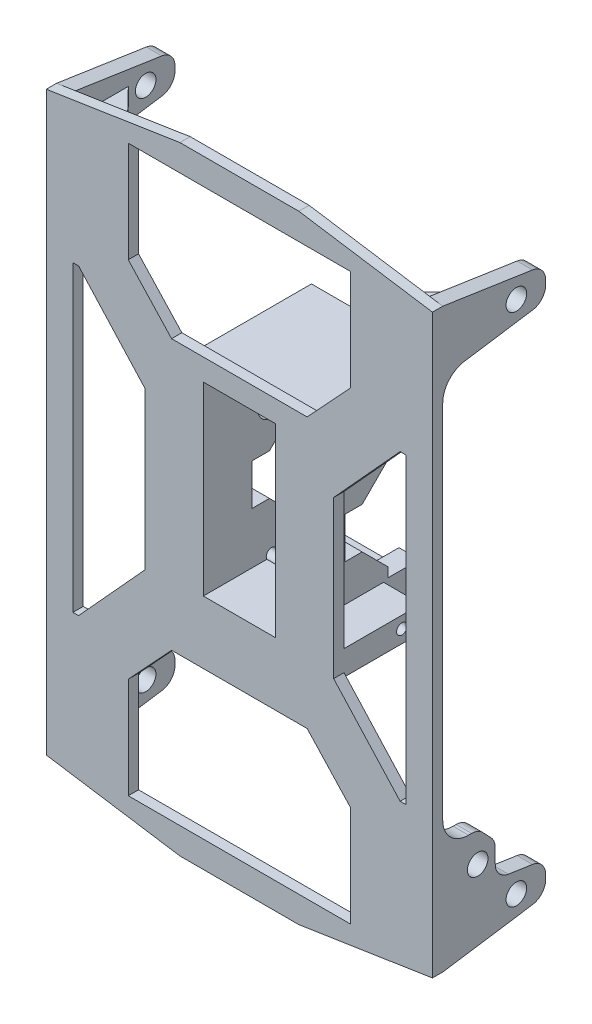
ISO-10303-21;
HEADER;
FILE_DESCRIPTION(('STEP AP214'),'2;1');
FILE_NAME('part.step','',(''),(''),'','','');
FILE_SCHEMA(('AUTOMOTIVE_DESIGN { 1 0 10303 214 1 1 1 1 }'));
ENDSEC;
DATA;
#1=APPLICATION_CONTEXT('core data for automotive mechanical design processes');
#2=APPLICATION_PROTOCOL_DEFINITION('international standard','automotive_design',2000,#1);
#3=PRODUCT_CONTEXT('',#1,'mechanical');
#4=PRODUCT('Part','Part','',(#3));
#5=PRODUCT_RELATED_PRODUCT_CATEGORY('part','',(#4));
#6=PRODUCT_DEFINITION_FORMATION('','',#4);
#7=PRODUCT_DEFINITION_CONTEXT('part definition',#1,'design');
#8=PRODUCT_DEFINITION('design','',#6,#7);
#9=PRODUCT_DEFINITION_SHAPE('','',#8);
#10=(LENGTH_UNIT() NAMED_UNIT(*) SI_UNIT(.MILLI.,.METRE.));
#11=(NAMED_UNIT(*) PLANE_ANGLE_UNIT() SI_UNIT($,.RADIAN.));
#12=(NAMED_UNIT(*) SI_UNIT($,.STERADIAN.) SOLID_ANGLE_UNIT());
#13=UNCERTAINTY_MEASURE_WITH_UNIT(LENGTH_MEASURE(1.E-05),#10,'distance_accuracy_value','');
#14=(GEOMETRIC_REPRESENTATION_CONTEXT(3) GLOBAL_UNCERTAINTY_ASSIGNED_CONTEXT((#13)) GLOBAL_UNIT_ASSIGNED_CONTEXT((#10,
#11,#12)) REPRESENTATION_CONTEXT('',''));
#15=CARTESIAN_POINT('',(0.,0.,0.));
#16=DIRECTION('',(0.,0.,1.));
#17=DIRECTION('',(1.,0.,0.));
#18=AXIS2_PLACEMENT_3D('',#15,#16,#17);
#19=CARTESIAN_POINT('',(6.99999999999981,46.,2.));
#20=DIRECTION('',(0.,-1.,0.));
#21=DIRECTION('',(0.,0.,-1.));
#22=AXIS2_PLACEMENT_3D('',#19,#20,#21);
#23=PLANE('',#22);
#24=DIRECTION('',(0.,0.,-1.));
#25=VECTOR('',#24,1.);
#26=CARTESIAN_POINT('',(-6.99999999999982,46.,2.));
#27=LINE('',#26,#25);
#28=CARTESIAN_POINT('',(-6.99999999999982,46.,-12.1504998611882));
#29=VERTEX_POINT('',#28);
#30=CARTESIAN_POINT('',(-6.99999999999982,46.,-22.));
#31=VERTEX_POINT('',#30);
#32=EDGE_CURVE('E921',#29,#31,#27,.T.);
#33=ORIENTED_EDGE('',*,*,#32,.F.);
#34=DIRECTION('',(1.,0.,0.));
#35=VECTOR('',#34,1.);
#36=CARTESIAN_POINT('',(-37.5,46.,-12.1504998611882));
#37=LINE('',#36,#35);
#38=CARTESIAN_POINT('',(6.99999999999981,46.,-12.1504998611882));
#39=VERTEX_POINT('',#38);
#40=EDGE_CURVE('E1621',#29,#39,#37,.T.);
#41=ORIENTED_EDGE('',*,*,#40,.T.);
#42=DIRECTION('',(0.,0.,-1.));
#43=VECTOR('',#42,1.);
#44=CARTESIAN_POINT('',(6.99999999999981,46.,2.));
#45=LINE('',#44,#43);
#46=CARTESIAN_POINT('',(6.99999999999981,46.,-22.));
#47=VERTEX_POINT('',#46);
#48=EDGE_CURVE('E906',#39,#47,#45,.T.);
#49=ORIENTED_EDGE('',*,*,#48,.T.);
#50=DIRECTION('',(-1.,0.,0.));
#51=VECTOR('',#50,1.);
#52=CARTESIAN_POINT('',(6.99999999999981,46.,-22.));
#53=LINE('',#52,#51);
#54=EDGE_CURVE('E909',#47,#31,#53,.T.);
#55=ORIENTED_EDGE('',*,*,#54,.T.);
#56=EDGE_LOOP('',(#33,#41,#49,#55));
#57=FACE_BOUND('',#56,.T.);
#58=ADVANCED_FACE('F35',(#57),#23,.F.);
#59=CARTESIAN_POINT('',(0.,0.,0.));
#60=DIRECTION('',(0.,0.,-1.));
#61=DIRECTION('',(-1.,0.,0.));
#62=AXIS2_PLACEMENT_3D('',#59,#60,#61);
#63=PLANE('',#62);
#64=DIRECTION('',(0.988331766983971,0.152316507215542,0.));
#65=VECTOR('',#64,1.);
#66=CARTESIAN_POINT('',(37.5,4.,0.));
#67=LINE('',#66,#65);
#68=CARTESIAN_POINT('',(11.5453143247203,0.,0.));
#69=VERTEX_POINT('',#68);
#70=CARTESIAN_POINT('',(37.5,4.,0.));
#71=VERTEX_POINT('',#70);
#72=EDGE_CURVE('E804',#69,#71,#67,.T.);
#73=ORIENTED_EDGE('',*,*,#72,.F.);
#74=DIRECTION('',(1.,0.,0.));
#75=VECTOR('',#74,1.);
#76=CARTESIAN_POINT('',(-37.5,0.,0.));
#77=LINE('',#76,#75);
#78=CARTESIAN_POINT('',(-11.5453143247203,0.,0.));
#79=VERTEX_POINT('',#78);
#80=EDGE_CURVE('E1437',#79,#69,#77,.T.);
#81=ORIENTED_EDGE('',*,*,#80,.F.);
#82=DIRECTION('',(0.988331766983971,-0.152316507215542,0.));
#83=VECTOR('',#82,1.);
#84=CARTESIAN_POINT('',(-37.5,4.,0.));
#85=LINE('',#84,#83);
#86=CARTESIAN_POINT('',(-37.5,4.,0.));
#87=VERTEX_POINT('',#86);
#88=EDGE_CURVE('E821',#87,#79,#85,.T.);
#89=ORIENTED_EDGE('',*,*,#88,.F.);
#90=DIRECTION('',(-1.,0.,0.));
#91=VECTOR('',#90,1.);
#92=CARTESIAN_POINT('',(-34.5,3.99999999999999,0.));
#93=LINE('',#92,#91);
#94=CARTESIAN_POINT('',(-34.5,3.99999999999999,0.));
#95=VERTEX_POINT('',#94);
#96=EDGE_CURVE('E1387',#95,#87,#93,.T.);
#97=ORIENTED_EDGE('',*,*,#96,.F.);
#98=DIRECTION('',(0.,1.,0.));
#99=VECTOR('',#98,1.);
#100=CARTESIAN_POINT('',(-34.5,16.,0.));
#101=LINE('',#100,#99);
#102=CARTESIAN_POINT('',(-34.5,8.5,0.));
#103=VERTEX_POINT('',#102);
#104=EDGE_CURVE('E1384',#95,#103,#101,.T.);
#105=ORIENTED_EDGE('',*,*,#104,.T.);
#106=DIRECTION('',(-1.,0.,0.));
#107=VECTOR('',#106,1.);
#108=CARTESIAN_POINT('',(-23.8769710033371,8.5,0.));
#109=LINE('',#108,#107);
#110=CARTESIAN_POINT('',(-23.8769710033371,8.5,0.));
#111=VERTEX_POINT('',#110);
#112=EDGE_CURVE('E1215',#111,#103,#109,.T.);
#113=ORIENTED_EDGE('',*,*,#112,.F.);
#114=DIRECTION('',(0.,1.,0.));
#115=VECTOR('',#114,1.);
#116=CARTESIAN_POINT('',(-23.8769710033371,8.5,0.));
#117=LINE('',#116,#115);
#118=CARTESIAN_POINT('',(-23.8769710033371,11.5,0.));
#119=VERTEX_POINT('',#118);
#120=EDGE_CURVE('E1222',#111,#119,#117,.T.);
#121=ORIENTED_EDGE('',*,*,#120,.T.);
#122=DIRECTION('',(-1.,0.,0.));
#123=VECTOR('',#122,1.);
#124=CARTESIAN_POINT('',(-23.8769710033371,11.5,0.));
#125=LINE('',#124,#123);
#126=CARTESIAN_POINT('',(-34.5,11.5,0.));
#127=VERTEX_POINT('',#126);
#128=EDGE_CURVE('E1214',#119,#127,#125,.T.);
#129=ORIENTED_EDGE('',*,*,#128,.T.);
#130=CARTESIAN_POINT('',(-34.5,29.5238434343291,0.));
#131=VERTEX_POINT('',#130);
#132=EDGE_CURVE('E1383',#127,#131,#101,.T.);
#133=ORIENTED_EDGE('',*,*,#132,.T.);
#134=DIRECTION('',(-1.,0.,0.));
#135=VECTOR('',#134,1.);
#136=CARTESIAN_POINT('',(-37.5,29.5238434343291,0.));
#137=LINE('',#136,#135);
#138=CARTESIAN_POINT('',(-37.5,29.5238434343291,0.));
#139=VERTEX_POINT('',#138);
#140=EDGE_CURVE('E1471',#131,#139,#137,.T.);
#141=ORIENTED_EDGE('',*,*,#140,.T.);
#142=DIRECTION('',(0.,-1.,0.));
#143=VECTOR('',#142,1.);
#144=CARTESIAN_POINT('',(-37.5,0.,0.));
#145=LINE('',#144,#143);
#146=CARTESIAN_POINT('',(-37.5,99.6940628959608,0.));
#147=VERTEX_POINT('',#146);
#148=EDGE_CURVE('E1420',#147,#139,#145,.T.);
#149=ORIENTED_EDGE('',*,*,#148,.F.);
#150=DIRECTION('',(-1.,0.,0.));
#151=VECTOR('',#150,1.);
#152=CARTESIAN_POINT('',(-34.5,99.6940628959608,0.));
#153=LINE('',#152,#151);
#154=CARTESIAN_POINT('',(-34.5,99.6940628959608,0.));
#155=VERTEX_POINT('',#154);
#156=EDGE_CURVE('E1468',#147,#155,#153,.F.);
#157=ORIENTED_EDGE('',*,*,#156,.T.);
#158=DIRECTION('',(0.,1.,0.));
#159=VECTOR('',#158,1.);
#160=CARTESIAN_POINT('',(-34.5,104.,0.));
#161=LINE('',#160,#159);
#162=CARTESIAN_POINT('',(-34.5,108.5,0.));
#163=VERTEX_POINT('',#162);
#164=EDGE_CURVE('E1398',#155,#163,#161,.T.);
#165=ORIENTED_EDGE('',*,*,#164,.T.);
#166=DIRECTION('',(1.,0.,0.));
#167=VECTOR('',#166,1.);
#168=CARTESIAN_POINT('',(-23.8769710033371,108.5,0.));
#169=LINE('',#168,#167);
#170=CARTESIAN_POINT('',(-23.8769710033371,108.5,0.));
#171=VERTEX_POINT('',#170);
#172=EDGE_CURVE('E1247',#163,#171,#169,.T.);
#173=ORIENTED_EDGE('',*,*,#172,.T.);
#174=DIRECTION('',(0.,-1.,0.));
#175=VECTOR('',#174,1.);
#176=CARTESIAN_POINT('',(-23.8769710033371,111.5,0.));
#177=LINE('',#176,#175);
#178=CARTESIAN_POINT('',(-23.8769710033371,111.5,0.));
#179=VERTEX_POINT('',#178);
#180=EDGE_CURVE('E772',#179,#171,#177,.T.);
#181=ORIENTED_EDGE('',*,*,#180,.F.);
#182=DIRECTION('',(1.,0.,0.));
#183=VECTOR('',#182,1.);
#184=CARTESIAN_POINT('',(-23.8769710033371,111.5,0.));
#185=LINE('',#184,#183);
#186=CARTESIAN_POINT('',(-34.5,111.5,0.));
#187=VERTEX_POINT('',#186);
#188=EDGE_CURVE('E1238',#187,#179,#185,.T.);
#189=ORIENTED_EDGE('',*,*,#188,.F.);
#190=CARTESIAN_POINT('',(-34.5,116.,0.));
#191=VERTEX_POINT('',#190);
#192=EDGE_CURVE('E1402',#187,#191,#161,.T.);
#193=ORIENTED_EDGE('',*,*,#192,.T.);
#194=DIRECTION('',(-1.,0.,0.));
#195=VECTOR('',#194,1.);
#196=CARTESIAN_POINT('',(-34.5,116.,0.));
#197=LINE('',#196,#195);
#198=CARTESIAN_POINT('',(-37.5,116.,0.));
#199=VERTEX_POINT('',#198);
#200=EDGE_CURVE('E1410',#191,#199,#197,.T.);
#201=ORIENTED_EDGE('',*,*,#200,.T.);
#202=DIRECTION('',(-0.988331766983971,-0.152316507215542,0.));
#203=VECTOR('',#202,1.);
#204=CARTESIAN_POINT('',(-37.5,116.,0.));
#205=LINE('',#204,#203);
#206=CARTESIAN_POINT('',(-11.5453143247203,120.,0.));
#207=VERTEX_POINT('',#206);
#208=EDGE_CURVE('E809',#207,#199,#205,.T.);
#209=ORIENTED_EDGE('',*,*,#208,.F.);
#210=DIRECTION('',(-1.,0.,0.));
#211=VECTOR('',#210,1.);
#212=CARTESIAN_POINT('',(-37.5,120.,0.));
#213=LINE('',#212,#211);
#214=CARTESIAN_POINT('',(11.5453143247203,120.,0.));
#215=VERTEX_POINT('',#214);
#216=EDGE_CURVE('E1425',#215,#207,#213,.T.);
#217=ORIENTED_EDGE('',*,*,#216,.F.);
#218=DIRECTION('',(-0.988331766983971,0.152316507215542,0.));
#219=VECTOR('',#218,1.);
#220=CARTESIAN_POINT('',(37.5,116.,0.));
#221=LINE('',#220,#219);
#222=CARTESIAN_POINT('',(37.5,116.,0.));
#223=VERTEX_POINT('',#222);
#224=EDGE_CURVE('E815',#223,#215,#221,.T.);
#225=ORIENTED_EDGE('',*,*,#224,.F.);
#226=DIRECTION('',(1.,0.,0.));
#227=VECTOR('',#226,1.);
#228=CARTESIAN_POINT('',(34.5,116.,0.));
#229=LINE('',#228,#227);
#230=CARTESIAN_POINT('',(34.5,116.,0.));
#231=VERTEX_POINT('',#230);
#232=EDGE_CURVE('E1204',#231,#223,#229,.T.);
#233=ORIENTED_EDGE('',*,*,#232,.F.);
#234=DIRECTION('',(0.,1.,0.));
#235=VECTOR('',#234,1.);
#236=CARTESIAN_POINT('',(34.5,104.,0.));
#237=LINE('',#236,#235);
#238=CARTESIAN_POINT('',(34.5,111.5,0.));
#239=VERTEX_POINT('',#238);
#240=EDGE_CURVE('E1196',#239,#231,#237,.T.);
#241=ORIENTED_EDGE('',*,*,#240,.F.);
#242=DIRECTION('',(-1.,0.,0.));
#243=VECTOR('',#242,1.);
#244=CARTESIAN_POINT('',(23.8769710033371,111.5,0.));
#245=LINE('',#244,#243);
#246=CARTESIAN_POINT('',(23.8769710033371,111.5,0.));
#247=VERTEX_POINT('',#246);
#248=EDGE_CURVE('E1124',#239,#247,#245,.T.);
#249=ORIENTED_EDGE('',*,*,#248,.T.);
#250=DIRECTION('',(0.,-1.,0.));
#251=VECTOR('',#250,1.);
#252=CARTESIAN_POINT('',(23.8769710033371,111.5,0.));
#253=LINE('',#252,#251);
#254=CARTESIAN_POINT('',(23.8769710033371,108.5,0.));
#255=VERTEX_POINT('',#254);
#256=EDGE_CURVE('E1126',#247,#255,#253,.T.);
#257=ORIENTED_EDGE('',*,*,#256,.T.);
#258=DIRECTION('',(-1.,0.,0.));
#259=VECTOR('',#258,1.);
#260=CARTESIAN_POINT('',(23.8769710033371,108.5,0.));
#261=LINE('',#260,#259);
#262=CARTESIAN_POINT('',(34.5,108.5,0.));
#263=VERTEX_POINT('',#262);
#264=EDGE_CURVE('E1121',#263,#255,#261,.T.);
#265=ORIENTED_EDGE('',*,*,#264,.F.);
#266=CARTESIAN_POINT('',(34.5,99.6940628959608,0.));
#267=VERTEX_POINT('',#266);
#268=EDGE_CURVE('E1193',#267,#263,#237,.T.);
#269=ORIENTED_EDGE('',*,*,#268,.F.);
#270=DIRECTION('',(1.,0.,0.));
#271=VECTOR('',#270,1.);
#272=CARTESIAN_POINT('',(0.,99.6940628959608,0.));
#273=LINE('',#272,#271);
#274=CARTESIAN_POINT('',(37.5,99.6940628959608,0.));
#275=VERTEX_POINT('',#274);
#276=EDGE_CURVE('E1465',#267,#275,#273,.T.);
#277=ORIENTED_EDGE('',*,*,#276,.T.);
#278=DIRECTION('',(0.,1.,0.));
#279=VECTOR('',#278,1.);
#280=CARTESIAN_POINT('',(37.5,0.,0.));
#281=LINE('',#280,#279);
#282=CARTESIAN_POINT('',(37.5,29.5238434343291,0.));
#283=VERTEX_POINT('',#282);
#284=EDGE_CURVE('E1440',#283,#275,#281,.T.);
#285=ORIENTED_EDGE('',*,*,#284,.F.);
#286=DIRECTION('',(1.,0.,0.));
#287=VECTOR('',#286,1.);
#288=CARTESIAN_POINT('',(0.,29.5238434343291,0.));
#289=LINE('',#288,#287);
#290=CARTESIAN_POINT('',(34.5,29.5238434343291,0.));
#291=VERTEX_POINT('',#290);
#292=EDGE_CURVE('E1474',#283,#291,#289,.F.);
#293=ORIENTED_EDGE('',*,*,#292,.T.);
#294=DIRECTION('',(0.,1.,0.));
#295=VECTOR('',#294,1.);
#296=CARTESIAN_POINT('',(34.5,16.,0.));
#297=LINE('',#296,#295);
#298=CARTESIAN_POINT('',(34.5,11.5,0.));
#299=VERTEX_POINT('',#298);
#300=EDGE_CURVE('E1172',#299,#291,#297,.T.);
#301=ORIENTED_EDGE('',*,*,#300,.F.);
#302=DIRECTION('',(1.,0.,0.));
#303=VECTOR('',#302,1.);
#304=CARTESIAN_POINT('',(23.8769710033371,11.5,0.));
#305=LINE('',#304,#303);
#306=CARTESIAN_POINT('',(23.8769710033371,11.5,0.));
#307=VERTEX_POINT('',#306);
#308=EDGE_CURVE('E1085',#307,#299,#305,.T.);
#309=ORIENTED_EDGE('',*,*,#308,.F.);
#310=DIRECTION('',(0.,1.,0.));
#311=VECTOR('',#310,1.);
#312=CARTESIAN_POINT('',(23.8769710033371,8.5,0.));
#313=LINE('',#312,#311);
#314=CARTESIAN_POINT('',(23.8769710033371,8.5,0.));
#315=VERTEX_POINT('',#314);
#316=EDGE_CURVE('E1115',#315,#307,#313,.T.);
#317=ORIENTED_EDGE('',*,*,#316,.F.);
#318=DIRECTION('',(1.,0.,0.));
#319=VECTOR('',#318,1.);
#320=CARTESIAN_POINT('',(23.8769710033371,8.5,0.));
#321=LINE('',#320,#319);
#322=CARTESIAN_POINT('',(34.5,8.5,0.));
#323=VERTEX_POINT('',#322);
#324=EDGE_CURVE('E1096',#315,#323,#321,.T.);
#325=ORIENTED_EDGE('',*,*,#324,.T.);
#326=CARTESIAN_POINT('',(34.5,3.99999999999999,0.));
#327=VERTEX_POINT('',#326);
#328=EDGE_CURVE('E1174',#327,#323,#297,.T.);
#329=ORIENTED_EDGE('',*,*,#328,.F.);
#330=DIRECTION('',(1.,0.,0.));
#331=VECTOR('',#330,1.);
#332=CARTESIAN_POINT('',(34.5,3.99999999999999,0.));
#333=LINE('',#332,#331);
#334=EDGE_CURVE('E1182',#327,#71,#333,.T.);
#335=ORIENTED_EDGE('',*,*,#334,.T.);
#336=EDGE_LOOP('',(#73,#81,#89,#97,#105,#113,#121,#129,#133,#141,#149,#157,#165,#173,#181,#189,
#193,#201,#209,#217,#225,#233,#241,#249,#257,#265,#269,#277,#285,#293,#301,#309,#317,#325,#329,#335));
#337=FACE_BOUND('',#336,.T.);
#338=DIRECTION('',(0.,-1.,0.));
#339=VECTOR('',#338,1.);
#340=CARTESIAN_POINT('',(21.5794985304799,114.885851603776,0.));
#341=LINE('',#340,#339);
#342=CARTESIAN_POINT('',(21.5794985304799,114.885851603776,0.));
#343=VERTEX_POINT('',#342);
#344=CARTESIAN_POINT('',(21.5794985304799,95.2759996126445,0.));
#345=VERTEX_POINT('',#344);
#346=EDGE_CURVE('E1025',#343,#345,#341,.T.);
#347=ORIENTED_EDGE('',*,*,#346,.F.);
#348=DIRECTION('',(1.,0.,0.));
#349=VECTOR('',#348,1.);
#350=CARTESIAN_POINT('',(-21.5794985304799,114.885851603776,0.));
#351=LINE('',#350,#349);
#352=CARTESIAN_POINT('',(-21.5794985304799,114.885851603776,0.));
#353=VERTEX_POINT('',#352);
#354=EDGE_CURVE('E1049',#353,#343,#351,.T.);
#355=ORIENTED_EDGE('',*,*,#354,.F.);
#356=DIRECTION('',(0.,1.,0.));
#357=VECTOR('',#356,1.);
#358=CARTESIAN_POINT('',(-21.5794985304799,114.885851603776,0.));
#359=LINE('',#358,#357);
#360=CARTESIAN_POINT('',(-21.57949853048,95.2759996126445,0.));
#361=VERTEX_POINT('',#360);
#362=EDGE_CURVE('E1046',#361,#353,#359,.T.);
#363=ORIENTED_EDGE('',*,*,#362,.F.);
#364=DIRECTION('',(-0.679939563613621,0.733268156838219,0.));
#365=VECTOR('',#364,1.);
#366=CARTESIAN_POINT('',(-21.57949853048,95.2759996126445,0.));
#367=LINE('',#366,#365);
#368=CARTESIAN_POINT('',(-13.1678651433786,86.2046302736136,0.));
#369=VERTEX_POINT('',#368);
#370=EDGE_CURVE('E1043',#369,#361,#367,.T.);
#371=ORIENTED_EDGE('',*,*,#370,.F.);
#372=DIRECTION('',(-1.,0.,0.));
#373=VECTOR('',#372,1.);
#374=CARTESIAN_POINT('',(13.1678651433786,86.2046302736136,0.));
#375=LINE('',#374,#373);
#376=CARTESIAN_POINT('',(13.1678651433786,86.2046302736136,0.));
#377=VERTEX_POINT('',#376);
#378=EDGE_CURVE('E1040',#377,#369,#375,.T.);
#379=ORIENTED_EDGE('',*,*,#378,.F.);
#380=DIRECTION('',(-0.679939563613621,-0.733268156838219,0.));
#381=VECTOR('',#380,1.);
#382=CARTESIAN_POINT('',(21.57949853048,95.2759996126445,0.));
#383=LINE('',#382,#381);
#384=EDGE_CURVE('E1037',#345,#377,#383,.T.);
#385=ORIENTED_EDGE('',*,*,#384,.F.);
#386=EDGE_LOOP('',(#347,#355,#363,#371,#379,#385));
#387=FACE_BOUND('',#386,.T.);
#388=DIRECTION('',(-1.,0.,0.));
#389=VECTOR('',#388,1.);
#390=CARTESIAN_POINT('',(-21.57949853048,5.11414839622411,0.));
#391=LINE('',#390,#389);
#392=CARTESIAN_POINT('',(21.5794985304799,5.1141483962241,0.));
#393=VERTEX_POINT('',#392);
#394=CARTESIAN_POINT('',(-21.57949853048,5.11414839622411,0.));
#395=VERTEX_POINT('',#394);
#396=EDGE_CURVE('E1055',#393,#395,#391,.T.);
#397=ORIENTED_EDGE('',*,*,#396,.F.);
#398=DIRECTION('',(0.,-1.,0.));
#399=VECTOR('',#398,1.);
#400=CARTESIAN_POINT('',(21.5794985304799,5.1141483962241,0.));
#401=LINE('',#400,#399);
#402=CARTESIAN_POINT('',(21.57949853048,24.7240003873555,0.));
#403=VERTEX_POINT('',#402);
#404=EDGE_CURVE('E1079',#403,#393,#401,.T.);
#405=ORIENTED_EDGE('',*,*,#404,.F.);
#406=DIRECTION('',(0.679939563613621,-0.733268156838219,0.));
#407=VECTOR('',#406,1.);
#408=CARTESIAN_POINT('',(21.57949853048,24.7240003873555,0.));
#409=LINE('',#408,#407);
#410=CARTESIAN_POINT('',(13.1678651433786,33.7953697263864,0.));
#411=VERTEX_POINT('',#410);
#412=EDGE_CURVE('E1076',#411,#403,#409,.T.);
#413=ORIENTED_EDGE('',*,*,#412,.F.);
#414=DIRECTION('',(1.,0.,0.));
#415=VECTOR('',#414,1.);
#416=CARTESIAN_POINT('',(13.1678651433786,33.7953697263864,0.));
#417=LINE('',#416,#415);
#418=CARTESIAN_POINT('',(-13.1678651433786,33.7953697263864,0.));
#419=VERTEX_POINT('',#418);
#420=EDGE_CURVE('E1073',#419,#411,#417,.T.);
#421=ORIENTED_EDGE('',*,*,#420,.F.);
#422=DIRECTION('',(0.679939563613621,0.733268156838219,0.));
#423=VECTOR('',#422,1.);
#424=CARTESIAN_POINT('',(-21.57949853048,24.7240003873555,0.));
#425=LINE('',#424,#423);
#426=CARTESIAN_POINT('',(-21.57949853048,24.7240003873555,0.));
#427=VERTEX_POINT('',#426);
#428=EDGE_CURVE('E1070',#427,#419,#425,.T.);
#429=ORIENTED_EDGE('',*,*,#428,.F.);
#430=DIRECTION('',(0.,1.,0.));
#431=VECTOR('',#430,1.);
#432=CARTESIAN_POINT('',(-21.57949853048,5.11414839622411,0.));
#433=LINE('',#432,#431);
#434=EDGE_CURVE('E1067',#395,#427,#433,.T.);
#435=ORIENTED_EDGE('',*,*,#434,.F.);
#436=EDGE_LOOP('',(#397,#405,#413,#421,#429,#435));
#437=FACE_BOUND('',#436,.T.);
#438=DIRECTION('',(0.,1.,0.));
#439=VECTOR('',#438,1.);
#440=CARTESIAN_POINT('',(18.31130692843,75.2340694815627,0.));
#441=LINE('',#440,#439);
#442=CARTESIAN_POINT('',(18.31130692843,48.807615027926,0.));
#443=VERTEX_POINT('',#442);
#444=CARTESIAN_POINT('',(18.31130692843,75.2340694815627,0.));
#445=VERTEX_POINT('',#444);
#446=EDGE_CURVE('E994',#443,#445,#441,.T.);
#447=ORIENTED_EDGE('',*,*,#446,.F.);
#448=DIRECTION('',(1.,0.,0.));
#449=VECTOR('',#448,1.);
#450=CARTESIAN_POINT('',(11.,48.807615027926,0.));
#451=LINE('',#450,#449);
#452=CARTESIAN_POINT('',(11.,48.807615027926,0.));
#453=VERTEX_POINT('',#452);
#454=EDGE_CURVE('E850',#453,#443,#451,.T.);
#455=ORIENTED_EDGE('',*,*,#454,.F.);
#456=DIRECTION('',(0.,-1.,0.));
#457=VECTOR('',#456,1.);
#458=CARTESIAN_POINT('',(11.,44.,0.));
#459=LINE('',#458,#457);
#460=CARTESIAN_POINT('',(11.,84.,0.));
#461=VERTEX_POINT('',#460);
#462=EDGE_CURVE('E1346',#461,#453,#459,.T.);
#463=ORIENTED_EDGE('',*,*,#462,.F.);
#464=DIRECTION('',(1.,0.,0.));
#465=VECTOR('',#464,1.);
#466=CARTESIAN_POINT('',(11.,84.,0.));
#467=LINE('',#466,#465);
#468=CARTESIAN_POINT('',(-11.,84.,0.));
#469=VERTEX_POINT('',#468);
#470=EDGE_CURVE('E1350',#469,#461,#467,.T.);
#471=ORIENTED_EDGE('',*,*,#470,.F.);
#472=DIRECTION('',(0.,1.,0.));
#473=VECTOR('',#472,1.);
#474=CARTESIAN_POINT('',(-11.,84.,0.));
#475=LINE('',#474,#473);
#476=CARTESIAN_POINT('',(-11.,48.807615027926,0.));
#477=VERTEX_POINT('',#476);
#478=EDGE_CURVE('E1360',#477,#469,#475,.T.);
#479=ORIENTED_EDGE('',*,*,#478,.F.);
#480=DIRECTION('',(1.,0.,0.));
#481=VECTOR('',#480,1.);
#482=CARTESIAN_POINT('',(-11.,48.807615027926,0.));
#483=LINE('',#482,#481);
#484=CARTESIAN_POINT('',(-18.31130692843,48.807615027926,0.));
#485=VERTEX_POINT('',#484);
#486=EDGE_CURVE('E876',#485,#477,#483,.T.);
#487=ORIENTED_EDGE('',*,*,#486,.F.);
#488=DIRECTION('',(0.,-1.,0.));
#489=VECTOR('',#488,1.);
#490=CARTESIAN_POINT('',(-18.31130692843,75.2340694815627,0.));
#491=LINE('',#490,#489);
#492=CARTESIAN_POINT('',(-18.31130692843,75.2340694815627,0.));
#493=VERTEX_POINT('',#492);
#494=EDGE_CURVE('E987',#493,#485,#491,.T.);
#495=ORIENTED_EDGE('',*,*,#494,.F.);
#496=DIRECTION('',(0.673489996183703,-0.739196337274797,0.));
#497=VECTOR('',#496,1.);
#498=CARTESIAN_POINT('',(-18.31130692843,75.2340694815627,0.));
#499=LINE('',#498,#497);
#500=CARTESIAN_POINT('',(-31.2240891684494,89.4066353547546,0.));
#501=VERTEX_POINT('',#500);
#502=EDGE_CURVE('E984',#501,#493,#499,.T.);
#503=ORIENTED_EDGE('',*,*,#502,.F.);
#504=DIRECTION('',(1.,0.,0.));
#505=VECTOR('',#504,1.);
#506=CARTESIAN_POINT('',(-31.2240891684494,89.4066353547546,0.));
#507=LINE('',#506,#505);
#508=CARTESIAN_POINT('',(-32.3246005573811,89.4066353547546,0.));
#509=VERTEX_POINT('',#508);
#510=EDGE_CURVE('E981',#509,#501,#507,.T.);
#511=ORIENTED_EDGE('',*,*,#510,.F.);
#512=DIRECTION('',(0.,1.,0.));
#513=VECTOR('',#512,1.);
#514=CARTESIAN_POINT('',(-32.3246005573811,89.4066353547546,0.));
#515=LINE('',#514,#513);
#516=CARTESIAN_POINT('',(-32.3246005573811,30.5933646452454,0.));
#517=VERTEX_POINT('',#516);
#518=EDGE_CURVE('E978',#517,#509,#515,.T.);
#519=ORIENTED_EDGE('',*,*,#518,.F.);
#520=DIRECTION('',(-1.,0.,0.));
#521=VECTOR('',#520,1.);
#522=CARTESIAN_POINT('',(-31.2240891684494,30.5933646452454,0.));
#523=LINE('',#522,#521);
#524=CARTESIAN_POINT('',(-31.2240891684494,30.5933646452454,0.));
#525=VERTEX_POINT('',#524);
#526=EDGE_CURVE('E975',#525,#517,#523,.T.);
#527=ORIENTED_EDGE('',*,*,#526,.F.);
#528=DIRECTION('',(-0.673489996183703,-0.739196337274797,0.));
#529=VECTOR('',#528,1.);
#530=CARTESIAN_POINT('',(-18.31130692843,44.7659305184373,0.));
#531=LINE('',#530,#529);
#532=CARTESIAN_POINT('',(-18.31130692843,44.7659305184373,0.));
#533=VERTEX_POINT('',#532);
#534=EDGE_CURVE('E973',#533,#525,#531,.T.);
#535=ORIENTED_EDGE('',*,*,#534,.F.);
#536=DIRECTION('',(0.,1.,0.));
#537=VECTOR('',#536,1.);
#538=CARTESIAN_POINT('',(-18.31130692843,44.,0.));
#539=LINE('',#538,#537);
#540=CARTESIAN_POINT('',(-18.31130692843,44.,0.));
#541=VERTEX_POINT('',#540);
#542=EDGE_CURVE('E871',#541,#533,#539,.T.);
#543=ORIENTED_EDGE('',*,*,#542,.F.);
#544=DIRECTION('',(-1.,0.,0.));
#545=VECTOR('',#544,1.);
#546=CARTESIAN_POINT('',(-11.,44.,0.));
#547=LINE('',#546,#545);
#548=CARTESIAN_POINT('',(18.31130692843,44.,0.));
#549=VERTEX_POINT('',#548);
#550=EDGE_CURVE('E1358',#549,#541,#547,.T.);
#551=ORIENTED_EDGE('',*,*,#550,.F.);
#552=DIRECTION('',(0.,-1.,0.));
#553=VECTOR('',#552,1.);
#554=CARTESIAN_POINT('',(18.31130692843,44.,0.));
#555=LINE('',#554,#553);
#556=CARTESIAN_POINT('',(18.31130692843,44.7659305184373,0.));
#557=VERTEX_POINT('',#556);
#558=EDGE_CURVE('E854',#557,#549,#555,.T.);
#559=ORIENTED_EDGE('',*,*,#558,.F.);
#560=DIRECTION('',(-0.673489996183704,0.739196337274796,0.));
#561=VECTOR('',#560,1.);
#562=CARTESIAN_POINT('',(18.31130692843,44.7659305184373,0.));
#563=LINE('',#562,#561);
#564=CARTESIAN_POINT('',(31.2240891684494,30.5933646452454,0.));
#565=VERTEX_POINT('',#564);
#566=EDGE_CURVE('E1018',#565,#557,#563,.T.);
#567=ORIENTED_EDGE('',*,*,#566,.F.);
#568=DIRECTION('',(-1.,0.,0.));
#569=VECTOR('',#568,1.);
#570=CARTESIAN_POINT('',(31.2240891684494,30.5933646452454,0.));
#571=LINE('',#570,#569);
#572=CARTESIAN_POINT('',(32.324600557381,30.5933646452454,0.));
#573=VERTEX_POINT('',#572);
#574=EDGE_CURVE('E1015',#573,#565,#571,.T.);
#575=ORIENTED_EDGE('',*,*,#574,.F.);
#576=DIRECTION('',(0.,-1.,0.));
#577=VECTOR('',#576,1.);
#578=CARTESIAN_POINT('',(32.324600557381,89.4066353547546,0.));
#579=LINE('',#578,#577);
#580=CARTESIAN_POINT('',(32.324600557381,89.4066353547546,0.));
#581=VERTEX_POINT('',#580);
#582=EDGE_CURVE('E1012',#581,#573,#579,.T.);
#583=ORIENTED_EDGE('',*,*,#582,.F.);
#584=DIRECTION('',(1.,0.,0.));
#585=VECTOR('',#584,1.);
#586=CARTESIAN_POINT('',(31.2240891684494,89.4066353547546,0.));
#587=LINE('',#586,#585);
#588=CARTESIAN_POINT('',(31.2240891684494,89.4066353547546,0.));
#589=VERTEX_POINT('',#588);
#590=EDGE_CURVE('E1009',#589,#581,#587,.T.);
#591=ORIENTED_EDGE('',*,*,#590,.F.);
#592=DIRECTION('',(0.673489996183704,0.739196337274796,0.));
#593=VECTOR('',#592,1.);
#594=CARTESIAN_POINT('',(18.31130692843,75.2340694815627,0.));
#595=LINE('',#594,#593);
#596=EDGE_CURVE('E1006',#445,#589,#595,.T.);
#597=ORIENTED_EDGE('',*,*,#596,.F.);
#598=EDGE_LOOP('',(#447,#455,#463,#471,#479,#487,#495,#503,#511,#519,#527,#535,#543,#551,#559,
#567,#575,#583,#591,#597));
#599=FACE_BOUND('',#598,.T.);
#600=ADVANCED_FACE('F1791',(#337,#387,#437,#599),#63,.T.);
#601=CARTESIAN_POINT('',(11.,44.,-22.));
#602=DIRECTION('',(-1.,0.,0.));
#603=DIRECTION('',(0.,-1.,0.));
#604=AXIS2_PLACEMENT_3D('',#601,#602,#603);
#605=PLANE('',#604);
#606=CARTESIAN_POINT('',(10.9999999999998,72.,-11.25));
#607=DIRECTION('',(1.,0.,0.));
#608=DIRECTION('',(0.,0.,-1.));
#609=AXIS2_PLACEMENT_3D('',#606,#607,#608);
#610=CIRCLE('',#609,2.64492403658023);
#611=CARTESIAN_POINT('',(10.9999999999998,72.,-13.8949240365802));
#612=VERTEX_POINT('',#611);
#613=EDGE_CURVE('E1311',#612,#612,#610,.T.);
#614=ORIENTED_EDGE('',*,*,#613,.F.);
#615=EDGE_LOOP('',(#614));
#616=FACE_BOUND('',#615,.T.);
#617=CARTESIAN_POINT('',(10.9999999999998,80.,-2.49999999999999));
#618=DIRECTION('',(1.,0.,0.));
#619=DIRECTION('',(0.,0.,-1.));
#620=AXIS2_PLACEMENT_3D('',#617,#618,#619);
#621=CIRCLE('',#620,1.5);
#622=CARTESIAN_POINT('',(10.9999999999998,80.,-3.99999999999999));
#623=VERTEX_POINT('',#622);
#624=EDGE_CURVE('E1298',#623,#623,#621,.T.);
#625=ORIENTED_EDGE('',*,*,#624,.F.);
#626=EDGE_LOOP('',(#625));
#627=FACE_BOUND('',#626,.T.);
#628=CARTESIAN_POINT('',(10.9999999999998,80.,-20.));
#629=DIRECTION('',(1.,0.,0.));
#630=DIRECTION('',(0.,0.,-1.));
#631=AXIS2_PLACEMENT_3D('',#628,#629,#630);
#632=CIRCLE('',#631,1.5);
#633=CARTESIAN_POINT('',(10.9999999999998,80.,-21.5));
#634=VERTEX_POINT('',#633);
#635=EDGE_CURVE('E1312',#634,#634,#632,.T.);
#636=ORIENTED_EDGE('',*,*,#635,.F.);
#637=EDGE_LOOP('',(#636));
#638=FACE_BOUND('',#637,.T.);
#639=DIRECTION('',(0.,0.,1.));
#640=VECTOR('',#639,1.);
#641=CARTESIAN_POINT('',(11.,48.807615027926,-15.));
#642=LINE('',#641,#640);
#643=CARTESIAN_POINT('',(11.,48.807615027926,-15.));
#644=VERTEX_POINT('',#643);
#645=EDGE_CURVE('E869',#644,#453,#642,.T.);
#646=ORIENTED_EDGE('',*,*,#645,.F.);
#647=DIRECTION('',(0.,1.,0.));
#648=VECTOR('',#647,1.);
#649=CARTESIAN_POINT('',(11.,44.,-15.));
#650=LINE('',#649,#648);
#651=CARTESIAN_POINT('',(11.,44.,-15.));
#652=VERTEX_POINT('',#651);
#653=EDGE_CURVE('E853',#652,#644,#650,.T.);
#654=ORIENTED_EDGE('',*,*,#653,.F.);
#655=DIRECTION('',(0.,0.,1.));
#656=VECTOR('',#655,1.);
#657=CARTESIAN_POINT('',(11.,44.,-22.));
#658=LINE('',#657,#656);
#659=CARTESIAN_POINT('',(11.,44.,-22.));
#660=VERTEX_POINT('',#659);
#661=EDGE_CURVE('E1370',#660,#652,#658,.T.);
#662=ORIENTED_EDGE('',*,*,#661,.F.);
#663=DIRECTION('',(0.,-1.,0.));
#664=VECTOR('',#663,1.);
#665=CARTESIAN_POINT('',(11.,84.,-22.));
#666=LINE('',#665,#664);
#667=CARTESIAN_POINT('',(10.9999999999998,49.1366376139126,-22.));
#668=VERTEX_POINT('',#667);
#669=EDGE_CURVE('E1347',#668,#660,#666,.T.);
#670=ORIENTED_EDGE('',*,*,#669,.F.);
#671=DIRECTION('',(0.,0.,-1.));
#672=VECTOR('',#671,1.);
#673=CARTESIAN_POINT('',(10.9999999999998,49.1366376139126,-15.845764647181));
#674=LINE('',#673,#672);
#675=CARTESIAN_POINT('',(10.9999999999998,49.1366376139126,-15.845764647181));
#676=VERTEX_POINT('',#675);
#677=EDGE_CURVE('E1255',#676,#668,#674,.T.);
#678=ORIENTED_EDGE('',*,*,#677,.F.);
#679=DIRECTION('',(0.,-1.,0.));
#680=VECTOR('',#679,1.);
#681=CARTESIAN_POINT('',(10.9999999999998,67.0060907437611,-15.845764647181));
#682=LINE('',#681,#680);
#683=CARTESIAN_POINT('',(10.9999999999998,51.,-15.845764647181));
#684=VERTEX_POINT('',#683);
#685=EDGE_CURVE('E771',#684,#676,#682,.T.);
#686=ORIENTED_EDGE('',*,*,#685,.F.);
#687=DIRECTION('',(0.,-0.70710678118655,-0.707106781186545));
#688=VECTOR('',#687,1.);
#689=CARTESIAN_POINT('',(11.,55.9999999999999,-10.8457646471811));
#690=LINE('',#689,#688);
#691=CARTESIAN_POINT('',(10.9999999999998,56.,-10.845764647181));
#692=VERTEX_POINT('',#691);
#693=EDGE_CURVE('E1593',#684,#692,#690,.F.);
#694=ORIENTED_EDGE('',*,*,#693,.T.);
#695=DIRECTION('',(0.,0.,-1.));
#696=VECTOR('',#695,1.);
#697=CARTESIAN_POINT('',(10.9999999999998,56.,-22.5));
#698=LINE('',#697,#696);
#699=CARTESIAN_POINT('',(10.9999999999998,56.,-7.49999999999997));
#700=VERTEX_POINT('',#699);
#701=EDGE_CURVE('E1330',#700,#692,#698,.T.);
#702=ORIENTED_EDGE('',*,*,#701,.F.);
#703=DIRECTION('',(0.,-1.,0.));
#704=VECTOR('',#703,1.);
#705=CARTESIAN_POINT('',(10.9999999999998,63.9999999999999,-7.49999999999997));
#706=LINE('',#705,#704);
#707=CARTESIAN_POINT('',(10.9999999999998,63.9999999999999,-7.49999999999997));
#708=VERTEX_POINT('',#707);
#709=EDGE_CURVE('E1327',#708,#700,#706,.T.);
#710=ORIENTED_EDGE('',*,*,#709,.F.);
#711=DIRECTION('',(0.,0.,1.));
#712=VECTOR('',#711,1.);
#713=CARTESIAN_POINT('',(10.9999999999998,63.9999999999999,-22.5));
#714=LINE('',#713,#712);
#715=CARTESIAN_POINT('',(10.9999999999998,63.9999999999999,-10.845764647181));
#716=VERTEX_POINT('',#715);
#717=EDGE_CURVE('E1323',#716,#708,#714,.T.);
#718=ORIENTED_EDGE('',*,*,#717,.F.);
#719=DIRECTION('',(0.,-0.70710678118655,0.707106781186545));
#720=VECTOR('',#719,1.);
#721=CARTESIAN_POINT('',(11.0000000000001,63.9999999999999,-10.8457646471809));
#722=LINE('',#721,#720);
#723=CARTESIAN_POINT('',(10.9999999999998,69.,-15.845764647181));
#724=VERTEX_POINT('',#723);
#725=EDGE_CURVE('E1591',#716,#724,#722,.F.);
#726=ORIENTED_EDGE('',*,*,#725,.T.);
#727=CARTESIAN_POINT('',(10.9999999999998,76.2579096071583,-15.845764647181));
#728=VERTEX_POINT('',#727);
#729=EDGE_CURVE('E768',#728,#724,#682,.T.);
#730=ORIENTED_EDGE('',*,*,#729,.F.);
#731=DIRECTION('',(0.,0.,1.));
#732=VECTOR('',#731,1.);
#733=CARTESIAN_POINT('',(10.9999999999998,76.2579096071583,-22.));
#734=LINE('',#733,#732);
#735=CARTESIAN_POINT('',(10.9999999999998,76.2579096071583,-23.));
#736=VERTEX_POINT('',#735);
#737=EDGE_CURVE('E760',#736,#728,#734,.T.);
#738=ORIENTED_EDGE('',*,*,#737,.F.);
#739=DIRECTION('',(0.,-1.,0.));
#740=VECTOR('',#739,1.);
#741=CARTESIAN_POINT('',(11.,84.,-23.));
#742=LINE('',#741,#740);
#743=CARTESIAN_POINT('',(11.,84.,-23.));
#744=VERTEX_POINT('',#743);
#745=EDGE_CURVE('E766',#744,#736,#742,.T.);
#746=ORIENTED_EDGE('',*,*,#745,.F.);
#747=DIRECTION('',(0.,0.,1.));
#748=VECTOR('',#747,1.);
#749=CARTESIAN_POINT('',(11.,84.,-22.));
#750=LINE('',#749,#748);
#751=EDGE_CURVE('E1355',#744,#461,#750,.T.);
#752=ORIENTED_EDGE('',*,*,#751,.T.);
#753=ORIENTED_EDGE('',*,*,#462,.T.);
#754=EDGE_LOOP('',(#646,#654,#662,#670,#678,#686,#694,#702,#710,#718,#726,#730,#738,#746,#752,#753));
#755=FACE_BOUND('',#754,.T.);
#756=ADVANCED_FACE('F763',(#616,#627,#638,#755),#605,.F.);
#757=CARTESIAN_POINT('',(-11.,84.,-22.));
#758=DIRECTION('',(1.,0.,0.));
#759=DIRECTION('',(0.,1.,0.));
#760=AXIS2_PLACEMENT_3D('',#757,#758,#759);
#761=PLANE('',#760);
#762=CARTESIAN_POINT('',(-11.0000000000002,72.,-11.25));
#763=DIRECTION('',(1.,0.,0.));
#764=DIRECTION('',(0.,0.,-1.));
#765=AXIS2_PLACEMENT_3D('',#762,#763,#764);
#766=CIRCLE('',#765,2.64492403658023);
#767=CARTESIAN_POINT('',(-11.0000000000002,72.,-13.8949240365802));
#768=VERTEX_POINT('',#767);
#769=EDGE_CURVE('E1320',#768,#768,#766,.T.);
#770=ORIENTED_EDGE('',*,*,#769,.T.);
#771=EDGE_LOOP('',(#770));
#772=FACE_BOUND('',#771,.T.);
#773=CARTESIAN_POINT('',(-11.0000000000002,80.,-2.49999999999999));
#774=DIRECTION('',(1.,0.,0.));
#775=DIRECTION('',(0.,0.,-1.));
#776=AXIS2_PLACEMENT_3D('',#773,#774,#775);
#777=CIRCLE('',#776,1.5);
#778=CARTESIAN_POINT('',(-11.0000000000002,80.,-3.99999999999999));
#779=VERTEX_POINT('',#778);
#780=EDGE_CURVE('E1315',#779,#779,#777,.T.);
#781=ORIENTED_EDGE('',*,*,#780,.T.);
#782=EDGE_LOOP('',(#781));
#783=FACE_BOUND('',#782,.T.);
#784=CARTESIAN_POINT('',(-11.0000000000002,80.,-20.));
#785=DIRECTION('',(1.,0.,0.));
#786=DIRECTION('',(0.,0.,-1.));
#787=AXIS2_PLACEMENT_3D('',#784,#785,#786);
#788=CIRCLE('',#787,1.5);
#789=CARTESIAN_POINT('',(-11.0000000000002,80.,-21.5));
#790=VERTEX_POINT('',#789);
#791=EDGE_CURVE('E1308',#790,#790,#788,.T.);
#792=ORIENTED_EDGE('',*,*,#791,.T.);
#793=EDGE_LOOP('',(#792));
#794=FACE_BOUND('',#793,.T.);
#795=DIRECTION('',(0.,0.,1.));
#796=VECTOR('',#795,1.);
#797=CARTESIAN_POINT('',(-11.,48.807615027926,-15.));
#798=LINE('',#797,#796);
#799=CARTESIAN_POINT('',(-11.,48.807615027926,-15.));
#800=VERTEX_POINT('',#799);
#801=EDGE_CURVE('E882',#800,#477,#798,.T.);
#802=ORIENTED_EDGE('',*,*,#801,.T.);
#803=ORIENTED_EDGE('',*,*,#478,.T.);
#804=DIRECTION('',(0.,0.,1.));
#805=VECTOR('',#804,1.);
#806=CARTESIAN_POINT('',(-11.,84.,-22.));
#807=LINE('',#806,#805);
#808=CARTESIAN_POINT('',(-11.,84.,-23.));
#809=VERTEX_POINT('',#808);
#810=EDGE_CURVE('E1364',#809,#469,#807,.T.);
#811=ORIENTED_EDGE('',*,*,#810,.F.);
#812=DIRECTION('',(0.,1.,0.));
#813=VECTOR('',#812,1.);
#814=CARTESIAN_POINT('',(-11.,76.2579096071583,-23.));
#815=LINE('',#814,#813);
#816=CARTESIAN_POINT('',(-11.,76.2579096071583,-23.));
#817=VERTEX_POINT('',#816);
#818=EDGE_CURVE('E801',#817,#809,#815,.T.);
#819=ORIENTED_EDGE('',*,*,#818,.F.);
#820=DIRECTION('',(0.,0.,1.));
#821=VECTOR('',#820,1.);
#822=CARTESIAN_POINT('',(-11.,76.2579096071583,-22.));
#823=LINE('',#822,#821);
#824=CARTESIAN_POINT('',(-11.,76.2579096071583,-15.845764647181));
#825=VERTEX_POINT('',#824);
#826=EDGE_CURVE('E1274',#817,#825,#823,.T.);
#827=ORIENTED_EDGE('',*,*,#826,.T.);
#828=DIRECTION('',(0.,-1.,0.));
#829=VECTOR('',#828,1.);
#830=CARTESIAN_POINT('',(-11.,84.,-15.845764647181));
#831=LINE('',#830,#829);
#832=CARTESIAN_POINT('',(-11.,69.,-15.845764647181));
#833=VERTEX_POINT('',#832);
#834=EDGE_CURVE('E1262',#825,#833,#831,.T.);
#835=ORIENTED_EDGE('',*,*,#834,.T.);
#836=DIRECTION('',(0.,0.70710678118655,-0.707106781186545));
#837=VECTOR('',#836,1.);
#838=CARTESIAN_POINT('',(-11.,63.9999999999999,-10.845764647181));
#839=LINE('',#838,#837);
#840=CARTESIAN_POINT('',(-11.,63.9999999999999,-10.845764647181));
#841=VERTEX_POINT('',#840);
#842=EDGE_CURVE('E1598',#833,#841,#839,.F.);
#843=ORIENTED_EDGE('',*,*,#842,.T.);
#844=DIRECTION('',(0.,0.,1.));
#845=VECTOR('',#844,1.);
#846=CARTESIAN_POINT('',(-11.,63.9999999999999,-22.));
#847=LINE('',#846,#845);
#848=CARTESIAN_POINT('',(-11.,63.9999999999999,-7.49999999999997));
#849=VERTEX_POINT('',#848);
#850=EDGE_CURVE('E1337',#841,#849,#847,.T.);
#851=ORIENTED_EDGE('',*,*,#850,.T.);
#852=DIRECTION('',(0.,-1.,0.));
#853=VECTOR('',#852,1.);
#854=CARTESIAN_POINT('',(-11.,84.,-7.49999999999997));
#855=LINE('',#854,#853);
#856=CARTESIAN_POINT('',(-11.,56.,-7.49999999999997));
#857=VERTEX_POINT('',#856);
#858=EDGE_CURVE('E1434',#849,#857,#855,.T.);
#859=ORIENTED_EDGE('',*,*,#858,.T.);
#860=DIRECTION('',(0.,0.,-1.));
#861=VECTOR('',#860,1.);
#862=CARTESIAN_POINT('',(-11.,56.,-22.));
#863=LINE('',#862,#861);
#864=CARTESIAN_POINT('',(-11.,56.,-10.845764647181));
#865=VERTEX_POINT('',#864);
#866=EDGE_CURVE('E1343',#857,#865,#863,.T.);
#867=ORIENTED_EDGE('',*,*,#866,.T.);
#868=DIRECTION('',(0.,0.70710678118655,0.707106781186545));
#869=VECTOR('',#868,1.);
#870=CARTESIAN_POINT('',(-11.,56.,-10.845764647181));
#871=LINE('',#870,#869);
#872=CARTESIAN_POINT('',(-11.,51.,-15.845764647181));
#873=VERTEX_POINT('',#872);
#874=EDGE_CURVE('E1600',#865,#873,#871,.F.);
#875=ORIENTED_EDGE('',*,*,#874,.T.);
#876=CARTESIAN_POINT('',(-11.,49.1366376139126,-15.845764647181));
#877=VERTEX_POINT('',#876);
#878=EDGE_CURVE('E1273',#873,#877,#831,.T.);
#879=ORIENTED_EDGE('',*,*,#878,.T.);
#880=DIRECTION('',(0.,0.,-1.));
#881=VECTOR('',#880,1.);
#882=CARTESIAN_POINT('',(-11.,49.1366376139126,-22.));
#883=LINE('',#882,#881);
#884=CARTESIAN_POINT('',(-11.,49.1366376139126,-22.));
#885=VERTEX_POINT('',#884);
#886=EDGE_CURVE('E1447',#877,#885,#883,.T.);
#887=ORIENTED_EDGE('',*,*,#886,.T.);
#888=DIRECTION('',(0.,1.,0.));
#889=VECTOR('',#888,1.);
#890=CARTESIAN_POINT('',(-11.,49.,-22.));
#891=LINE('',#890,#889);
#892=CARTESIAN_POINT('',(-11.,44.,-22.));
#893=VERTEX_POINT('',#892);
#894=EDGE_CURVE('E1352',#893,#885,#891,.T.);
#895=ORIENTED_EDGE('',*,*,#894,.F.);
#896=DIRECTION('',(0.,0.,1.));
#897=VECTOR('',#896,1.);
#898=CARTESIAN_POINT('',(-11.,44.,-22.));
#899=LINE('',#898,#897);
#900=CARTESIAN_POINT('',(-11.,44.,-15.));
#901=VERTEX_POINT('',#900);
#902=EDGE_CURVE('E1367',#893,#901,#899,.T.);
#903=ORIENTED_EDGE('',*,*,#902,.T.);
#904=DIRECTION('',(0.,-1.,0.));
#905=VECTOR('',#904,1.);
#906=CARTESIAN_POINT('',(-11.,44.,-15.));
#907=LINE('',#906,#905);
#908=EDGE_CURVE('E872',#800,#901,#907,.T.);
#909=ORIENTED_EDGE('',*,*,#908,.F.);
#910=EDGE_LOOP('',(#802,#803,#811,#819,#827,#835,#843,#851,#859,#867,#875,#879,#887,#895,#903,#909));
#911=FACE_BOUND('',#910,.T.);
#912=ADVANCED_FACE('F1892',(#772,#783,#794,#911),#761,.F.);
#913=CARTESIAN_POINT('',(-37.5,63.9999999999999,-7.49999999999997));
#914=DIRECTION('',(0.,0.,1.));
#915=DIRECTION('',(0.,-1.,0.));
#916=AXIS2_PLACEMENT_3D('',#913,#914,#915);
#917=PLANE('',#916);
#918=DIRECTION('',(1.,0.,0.));
#919=VECTOR('',#918,1.);
#920=CARTESIAN_POINT('',(-37.5,56.,-7.49999999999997));
#921=LINE('',#920,#919);
#922=CARTESIAN_POINT('',(6.99999999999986,56.,-7.49999999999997));
#923=VERTEX_POINT('',#922);
#924=EDGE_CURVE('E1338',#923,#700,#921,.T.);
#925=ORIENTED_EDGE('',*,*,#924,.F.);
#926=DIRECTION('',(0.,1.,0.));
#927=VECTOR('',#926,1.);
#928=CARTESIAN_POINT('',(6.9999999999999,63.9999999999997,-7.49999999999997));
#929=LINE('',#928,#927);
#930=CARTESIAN_POINT('',(6.9999999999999,63.9999999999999,-7.49999999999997));
#931=VERTEX_POINT('',#930);
#932=EDGE_CURVE('E955',#923,#931,#929,.T.);
#933=ORIENTED_EDGE('',*,*,#932,.T.);
#934=DIRECTION('',(1.,0.,0.));
#935=VECTOR('',#934,1.);
#936=CARTESIAN_POINT('',(-37.5,63.9999999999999,-7.49999999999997));
#937=LINE('',#936,#935);
#938=EDGE_CURVE('E1333',#931,#708,#937,.T.);
#939=ORIENTED_EDGE('',*,*,#938,.T.);
#940=ORIENTED_EDGE('',*,*,#709,.T.);
#941=EDGE_LOOP('',(#925,#933,#939,#940));
#942=FACE_BOUND('',#941,.T.);
#943=ADVANCED_FACE('F2069',(#942),#917,.F.);
#944=CARTESIAN_POINT('',(-37.5,56.,-22.5));
#945=DIRECTION('',(0.,-1.,0.));
#946=DIRECTION('',(0.,0.,-1.));
#947=AXIS2_PLACEMENT_3D('',#944,#945,#946);
#948=PLANE('',#947);
#949=ORIENTED_EDGE('',*,*,#701,.T.);
#950=DIRECTION('',(-1.,0.,0.));
#951=VECTOR('',#950,1.);
#952=CARTESIAN_POINT('',(-37.5,56.,-10.845764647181));
#953=LINE('',#952,#951);
#954=CARTESIAN_POINT('',(6.99999999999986,56.,-10.845764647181));
#955=VERTEX_POINT('',#954);
#956=EDGE_CURVE('E1582',#692,#955,#953,.T.);
#957=ORIENTED_EDGE('',*,*,#956,.T.);
#958=DIRECTION('',(0.,0.,1.));
#959=VECTOR('',#958,1.);
#960=CARTESIAN_POINT('',(6.99999999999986,56.,-22.5));
#961=LINE('',#960,#959);
#962=EDGE_CURVE('E953',#955,#923,#961,.T.);
#963=ORIENTED_EDGE('',*,*,#962,.T.);
#964=ORIENTED_EDGE('',*,*,#924,.T.);
#965=EDGE_LOOP('',(#949,#957,#963,#964));
#966=FACE_BOUND('',#965,.T.);
#967=ADVANCED_FACE('F2646',(#966),#948,.F.);
#968=CARTESIAN_POINT('',(-37.5,63.9999999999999,-22.5));
#969=DIRECTION('',(0.,1.,0.));
#970=DIRECTION('',(0.,0.,1.));
#971=AXIS2_PLACEMENT_3D('',#968,#969,#970);
#972=PLANE('',#971);
#973=DIRECTION('',(0.,0.,-1.));
#974=VECTOR('',#973,1.);
#975=CARTESIAN_POINT('',(6.9999999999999,63.9999999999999,-22.5));
#976=LINE('',#975,#974);
#977=CARTESIAN_POINT('',(6.9999999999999,63.9999999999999,-10.845764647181));
#978=VERTEX_POINT('',#977);
#979=EDGE_CURVE('E958',#931,#978,#976,.T.);
#980=ORIENTED_EDGE('',*,*,#979,.T.);
#981=DIRECTION('',(1.,0.,0.));
#982=VECTOR('',#981,1.);
#983=CARTESIAN_POINT('',(-37.5,63.9999999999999,-10.845764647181));
#984=LINE('',#983,#982);
#985=EDGE_CURVE('E1608',#978,#716,#984,.T.);
#986=ORIENTED_EDGE('',*,*,#985,.T.);
#987=ORIENTED_EDGE('',*,*,#717,.T.);
#988=ORIENTED_EDGE('',*,*,#938,.F.);
#989=EDGE_LOOP('',(#980,#986,#987,#988));
#990=FACE_BOUND('',#989,.T.);
#991=ADVANCED_FACE('F2653',(#990),#972,.F.);
#992=CARTESIAN_POINT('',(-11.0000000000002,72.,-11.25));
#993=DIRECTION('',(1.,0.,0.));
#994=DIRECTION('',(0.,0.,-1.));
#995=AXIS2_PLACEMENT_3D('',#992,#993,#994);
#996=CYLINDRICAL_SURFACE('',#995,2.64492403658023);
#997=CARTESIAN_POINT('',(6.99999999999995,72.,-11.25));
#998=DIRECTION('',(1.,0.,0.));
#999=DIRECTION('',(0.,1.,0.));
#1000=AXIS2_PLACEMENT_3D('',#997,#998,#999);
#1001=CIRCLE('',#1000,2.64492403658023);
#1002=CARTESIAN_POINT('',(6.99999999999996,74.6449240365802,-11.25));
#1003=VERTEX_POINT('',#1002);
#1004=EDGE_CURVE('E970',#1003,#1003,#1001,.F.);
#1005=ORIENTED_EDGE('',*,*,#1004,.T.);
#1006=EDGE_LOOP('',(#1005));
#1007=FACE_BOUND('',#1006,.T.);
#1008=ORIENTED_EDGE('',*,*,#613,.T.);
#1009=EDGE_LOOP('',(#1008));
#1010=FACE_BOUND('',#1009,.T.);
#1011=ADVANCED_FACE('F2093',(#1007,#1010),#996,.F.);
#1012=CARTESIAN_POINT('',(-11.0000000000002,80.,-2.49999999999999));
#1013=DIRECTION('',(1.,0.,0.));
#1014=DIRECTION('',(0.,0.,-1.));
#1015=AXIS2_PLACEMENT_3D('',#1012,#1013,#1014);
#1016=CYLINDRICAL_SURFACE('',#1015,1.5);
#1017=CARTESIAN_POINT('',(6.99999999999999,80.,-2.49999999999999));
#1018=DIRECTION('',(1.,0.,0.));
#1019=DIRECTION('',(0.,1.,0.));
#1020=AXIS2_PLACEMENT_3D('',#1017,#1018,#1019);
#1021=CIRCLE('',#1020,1.5);
#1022=CARTESIAN_POINT('',(7.,81.5,-2.49999999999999));
#1023=VERTEX_POINT('',#1022);
#1024=EDGE_CURVE('E967',#1023,#1023,#1021,.F.);
#1025=ORIENTED_EDGE('',*,*,#1024,.T.);
#1026=EDGE_LOOP('',(#1025));
#1027=FACE_BOUND('',#1026,.T.);
#1028=ORIENTED_EDGE('',*,*,#624,.T.);
#1029=EDGE_LOOP('',(#1028));
#1030=FACE_BOUND('',#1029,.T.);
#1031=ADVANCED_FACE('F2064',(#1027,#1030),#1016,.F.);
#1032=CARTESIAN_POINT('',(-11.0000000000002,80.,-20.));
#1033=DIRECTION('',(1.,0.,0.));
#1034=DIRECTION('',(0.,0.,-1.));
#1035=AXIS2_PLACEMENT_3D('',#1032,#1033,#1034);
#1036=CYLINDRICAL_SURFACE('',#1035,1.5);
#1037=CARTESIAN_POINT('',(6.99999999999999,80.,-20.));
#1038=DIRECTION('',(1.,0.,0.));
#1039=DIRECTION('',(0.,1.,0.));
#1040=AXIS2_PLACEMENT_3D('',#1037,#1038,#1039);
#1041=CIRCLE('',#1040,1.5);
#1042=CARTESIAN_POINT('',(7.,81.5,-20.));
#1043=VERTEX_POINT('',#1042);
#1044=EDGE_CURVE('E964',#1043,#1043,#1041,.F.);
#1045=ORIENTED_EDGE('',*,*,#1044,.T.);
#1046=EDGE_LOOP('',(#1045));
#1047=FACE_BOUND('',#1046,.T.);
#1048=ORIENTED_EDGE('',*,*,#635,.T.);
#1049=EDGE_LOOP('',(#1048));
#1050=FACE_BOUND('',#1049,.T.);
#1051=ADVANCED_FACE('F2077',(#1047,#1050),#1036,.F.);
#1052=CARTESIAN_POINT('',(-37.5,67.0060907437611,-15.845764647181));
#1053=DIRECTION('',(0.,0.,1.));
#1054=DIRECTION('',(1.,0.,0.));
#1055=AXIS2_PLACEMENT_3D('',#1052,#1053,#1054);
#1056=PLANE('',#1055);
#1057=ORIENTED_EDGE('',*,*,#729,.T.);
#1058=DIRECTION('',(-1.,0.,0.));
#1059=VECTOR('',#1058,1.);
#1060=CARTESIAN_POINT('',(-37.5,69.,-15.845764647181));
#1061=LINE('',#1060,#1059);
#1062=CARTESIAN_POINT('',(6.99999999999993,69.,-15.845764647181));
#1063=VERTEX_POINT('',#1062);
#1064=EDGE_CURVE('E1611',#724,#1063,#1061,.T.);
#1065=ORIENTED_EDGE('',*,*,#1064,.T.);
#1066=DIRECTION('',(0.,1.,0.));
#1067=VECTOR('',#1066,1.);
#1068=CARTESIAN_POINT('',(6.99999999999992,67.0060907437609,-15.845764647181));
#1069=LINE('',#1068,#1067);
#1070=CARTESIAN_POINT('',(6.99999999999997,76.2579096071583,-15.845764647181));
#1071=VERTEX_POINT('',#1070);
#1072=EDGE_CURVE('E961',#1063,#1071,#1069,.T.);
#1073=ORIENTED_EDGE('',*,*,#1072,.T.);
#1074=DIRECTION('',(1.,0.,0.));
#1075=VECTOR('',#1074,1.);
#1076=CARTESIAN_POINT('',(-37.5,76.2579096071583,-15.845764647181));
#1077=LINE('',#1076,#1075);
#1078=EDGE_CURVE('E1258',#1071,#728,#1077,.T.);
#1079=ORIENTED_EDGE('',*,*,#1078,.T.);
#1080=EDGE_LOOP('',(#1057,#1065,#1073,#1079));
#1081=FACE_BOUND('',#1080,.T.);
#1082=ADVANCED_FACE('F2084',(#1081),#1056,.F.);
#1083=CARTESIAN_POINT('',(-37.5,76.2579096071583,-22.));
#1084=DIRECTION('',(0.,1.,0.));
#1085=DIRECTION('',(-1.,0.,0.));
#1086=AXIS2_PLACEMENT_3D('',#1083,#1084,#1085);
#1087=PLANE('',#1086);
#1088=ORIENTED_EDGE('',*,*,#1078,.F.);
#1089=DIRECTION('',(0.,0.,-1.));
#1090=VECTOR('',#1089,1.);
#1091=CARTESIAN_POINT('',(6.99999999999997,76.2579096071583,-22.));
#1092=LINE('',#1091,#1090);
#1093=CARTESIAN_POINT('',(6.99999999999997,76.2579096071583,-23.));
#1094=VERTEX_POINT('',#1093);
#1095=EDGE_CURVE('E778',#1071,#1094,#1092,.T.);
#1096=ORIENTED_EDGE('',*,*,#1095,.T.);
#1097=DIRECTION('',(-1.,0.,0.));
#1098=VECTOR('',#1097,1.);
#1099=CARTESIAN_POINT('',(10.9999999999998,76.2579096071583,-23.));
#1100=LINE('',#1099,#1098);
#1101=EDGE_CURVE('E775',#736,#1094,#1100,.T.);
#1102=ORIENTED_EDGE('',*,*,#1101,.F.);
#1103=ORIENTED_EDGE('',*,*,#737,.T.);
#1104=EDGE_LOOP('',(#1088,#1096,#1102,#1103));
#1105=FACE_BOUND('',#1104,.T.);
#1106=ADVANCED_FACE('F776',(#1105),#1087,.F.);
#1107=CARTESIAN_POINT('',(-37.5,49.1366376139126,-15.845764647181));
#1108=DIRECTION('',(0.,-1.,0.));
#1109=DIRECTION('',(1.,0.,0.));
#1110=AXIS2_PLACEMENT_3D('',#1107,#1108,#1109);
#1111=PLANE('',#1110);
#1112=DIRECTION('',(1.,0.,0.));
#1113=VECTOR('',#1112,1.);
#1114=CARTESIAN_POINT('',(-37.5,49.1366376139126,-22.));
#1115=LINE('',#1114,#1113);
#1116=CARTESIAN_POINT('',(6.99999999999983,49.1366376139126,-22.));
#1117=VERTEX_POINT('',#1116);
#1118=EDGE_CURVE('E1263',#1117,#668,#1115,.T.);
#1119=ORIENTED_EDGE('',*,*,#1118,.F.);
#1120=DIRECTION('',(0.,0.,1.));
#1121=VECTOR('',#1120,1.);
#1122=CARTESIAN_POINT('',(6.99999999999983,49.1366376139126,-15.845764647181));
#1123=LINE('',#1122,#1121);
#1124=CARTESIAN_POINT('',(6.99999999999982,49.1366376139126,-15.845764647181));
#1125=VERTEX_POINT('',#1124);
#1126=EDGE_CURVE('E950',#1117,#1125,#1123,.T.);
#1127=ORIENTED_EDGE('',*,*,#1126,.T.);
#1128=DIRECTION('',(1.,0.,0.));
#1129=VECTOR('',#1128,1.);
#1130=CARTESIAN_POINT('',(-37.5,49.1366376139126,-15.845764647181));
#1131=LINE('',#1130,#1129);
#1132=EDGE_CURVE('E1267',#1125,#676,#1131,.T.);
#1133=ORIENTED_EDGE('',*,*,#1132,.T.);
#1134=ORIENTED_EDGE('',*,*,#677,.T.);
#1135=EDGE_LOOP('',(#1119,#1127,#1133,#1134));
#1136=FACE_BOUND('',#1135,.T.);
#1137=ADVANCED_FACE('F2313',(#1136),#1111,.F.);
#1138=DIRECTION('',(0.,1.,0.));
#1139=VECTOR('',#1138,1.);
#1140=CARTESIAN_POINT('',(6.99999999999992,67.0060907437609,-15.845764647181));
#1141=LINE('',#1140,#1139);
#1142=CARTESIAN_POINT('',(6.99999999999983,51.,-15.845764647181));
#1143=VERTEX_POINT('',#1142);
#1144=EDGE_CURVE('E1579',#1125,#1143,#1141,.T.);
#1145=ORIENTED_EDGE('',*,*,#1144,.T.);
#1146=DIRECTION('',(1.,0.,0.));
#1147=VECTOR('',#1146,1.);
#1148=CARTESIAN_POINT('',(-37.5,51.,-15.845764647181));
#1149=LINE('',#1148,#1147);
#1150=EDGE_CURVE('E1589',#1143,#684,#1149,.T.);
#1151=ORIENTED_EDGE('',*,*,#1150,.T.);
#1152=ORIENTED_EDGE('',*,*,#685,.T.);
#1153=ORIENTED_EDGE('',*,*,#1132,.F.);
#1154=EDGE_LOOP('',(#1145,#1151,#1152,#1153));
#1155=FACE_BOUND('',#1154,.T.);
#1156=ADVANCED_FACE('F2092',(#1155),#1056,.F.);
#1157=CARTESIAN_POINT('',(34.5,13.,-20.));
#1158=DIRECTION('',(0.,-0.988936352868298,0.148340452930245));
#1159=DIRECTION('',(0.,-0.148340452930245,-0.988936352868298));
#1160=AXIS2_PLACEMENT_3D('',#1157,#1158,#1159);
#1161=PLANE('',#1160);
#1162=DIRECTION('',(0.,-0.148340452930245,-0.988936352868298));
#1163=VECTOR('',#1162,1.);
#1164=CARTESIAN_POINT('',(34.5,13.,-20.));
#1165=LINE('',#1164,#1163);
#1166=CARTESIAN_POINT('',(34.5,14.0868040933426,-12.7546393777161));
#1167=VERTEX_POINT('',#1166);
#1168=CARTESIAN_POINT('',(34.5,13.3832467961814,-17.4450213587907));
#1169=VERTEX_POINT('',#1168);
#1170=EDGE_CURVE('E1169',#1167,#1169,#1165,.T.);
#1171=ORIENTED_EDGE('',*,*,#1170,.F.);
#1172=DIRECTION('',(1.,0.,0.));
#1173=VECTOR('',#1172,1.);
#1174=CARTESIAN_POINT('',(37.5,14.0868040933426,-12.7546393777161));
#1175=LINE('',#1174,#1173);
#1176=CARTESIAN_POINT('',(37.5,14.0868040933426,-12.7546393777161));
#1177=VERTEX_POINT('',#1176);
#1178=EDGE_CURVE('E1626',#1167,#1177,#1175,.T.);
#1179=ORIENTED_EDGE('',*,*,#1178,.T.);
#1180=DIRECTION('',(0.,-0.148340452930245,-0.988936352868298));
#1181=VECTOR('',#1180,1.);
#1182=CARTESIAN_POINT('',(37.5,13.,-20.));
#1183=LINE('',#1182,#1181);
#1184=CARTESIAN_POINT('',(37.5,13.3832467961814,-17.4450213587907));
#1185=VERTEX_POINT('',#1184);
#1186=EDGE_CURVE('E1159',#1177,#1185,#1183,.T.);
#1187=ORIENTED_EDGE('',*,*,#1186,.T.);
#1188=DIRECTION('',(1.,0.,0.));
#1189=VECTOR('',#1188,1.);
#1190=CARTESIAN_POINT('',(34.5,13.3832467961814,-17.4450213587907));
#1191=LINE('',#1190,#1189);
#1192=EDGE_CURVE('E1624',#1185,#1169,#1191,.F.);
#1193=ORIENTED_EDGE('',*,*,#1192,.T.);
#1194=EDGE_LOOP('',(#1171,#1179,#1187,#1193));
#1195=FACE_BOUND('',#1194,.T.);
#1196=ADVANCED_FACE('F2235',(#1195),#1161,.F.);
#1197=CARTESIAN_POINT('',(0.,0.,-22.));
#1198=DIRECTION('',(0.,0.,1.));
#1199=DIRECTION('',(1.,0.,0.));
#1200=AXIS2_PLACEMENT_3D('',#1197,#1198,#1199);
#1201=PLANE('',#1200);
#1202=ORIENTED_EDGE('',*,*,#54,.F.);
#1203=DIRECTION('',(0.,-1.,0.));
#1204=VECTOR('',#1203,1.);
#1205=CARTESIAN_POINT('',(7.,82.,-22.));
#1206=LINE('',#1205,#1204);
#1207=EDGE_CURVE('E892',#1117,#47,#1206,.T.);
#1208=ORIENTED_EDGE('',*,*,#1207,.F.);
#1209=ORIENTED_EDGE('',*,*,#1118,.T.);
#1210=ORIENTED_EDGE('',*,*,#669,.T.);
#1211=DIRECTION('',(-1.,0.,0.));
#1212=VECTOR('',#1211,1.);
#1213=CARTESIAN_POINT('',(-11.,44.,-22.));
#1214=LINE('',#1213,#1212);
#1215=EDGE_CURVE('E1349',#660,#893,#1214,.T.);
#1216=ORIENTED_EDGE('',*,*,#1215,.T.);
#1217=ORIENTED_EDGE('',*,*,#894,.T.);
#1218=CARTESIAN_POINT('',(-6.99999999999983,49.1366376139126,-22.));
#1219=VERTEX_POINT('',#1218);
#1220=EDGE_CURVE('E1259',#885,#1219,#1115,.T.);
#1221=ORIENTED_EDGE('',*,*,#1220,.T.);
#1222=DIRECTION('',(0.,1.,0.));
#1223=VECTOR('',#1222,1.);
#1224=CARTESIAN_POINT('',(-7.,82.,-22.));
#1225=LINE('',#1224,#1223);
#1226=EDGE_CURVE('E897',#31,#1219,#1225,.T.);
#1227=ORIENTED_EDGE('',*,*,#1226,.F.);
#1228=EDGE_LOOP('',(#1202,#1208,#1209,#1210,#1216,#1217,#1221,#1227));
#1229=FACE_BOUND('',#1228,.T.);
#1230=ADVANCED_FACE('F1923',(#1229),#1201,.F.);
#1231=CARTESIAN_POINT('',(-37.5,0.,2.));
#1232=DIRECTION('',(1.,0.,0.));
#1233=DIRECTION('',(0.,0.,-1.));
#1234=AXIS2_PLACEMENT_3D('',#1231,#1232,#1233);
#1235=PLANE('',#1234);
#1236=CARTESIAN_POINT('',(-37.5,18.7293448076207,-6.795438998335));
#1237=DIRECTION('',(-1.,0.,0.));
#1238=DIRECTION('',(0.,0.,1.));
#1239=AXIS2_PLACEMENT_3D('',#1236,#1237,#1238);
#1240=CIRCLE('',#1239,2.);
#1241=CARTESIAN_POINT('',(-37.5,18.7293448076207,-4.795438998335));
#1242=VERTEX_POINT('',#1241);
#1243=EDGE_CURVE('E1277',#1242,#1242,#1240,.T.);
#1244=ORIENTED_EDGE('',*,*,#1243,.F.);
#1245=EDGE_LOOP('',(#1244));
#1246=FACE_BOUND('',#1245,.T.);
#1247=CARTESIAN_POINT('',(-37.5,110.,-14.3));
#1248=DIRECTION('',(-1.,0.,0.));
#1249=DIRECTION('',(0.,0.,1.));
#1250=AXIS2_PLACEMENT_3D('',#1247,#1248,#1249);
#1251=CIRCLE('',#1250,2.);
#1252=CARTESIAN_POINT('',(-37.5,110.,-12.3));
#1253=VERTEX_POINT('',#1252);
#1254=EDGE_CURVE('E1281',#1253,#1253,#1251,.T.);
#1255=ORIENTED_EDGE('',*,*,#1254,.F.);
#1256=EDGE_LOOP('',(#1255));
#1257=FACE_BOUND('',#1256,.T.);
#1258=CARTESIAN_POINT('',(-37.5,9.99999999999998,-14.3));
#1259=DIRECTION('',(-1.,0.,0.));
#1260=DIRECTION('',(0.,0.,1.));
#1261=AXIS2_PLACEMENT_3D('',#1258,#1259,#1260);
#1262=CIRCLE('',#1261,2.);
#1263=CARTESIAN_POINT('',(-37.5,9.99999999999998,-12.3));
#1264=VERTEX_POINT('',#1263);
#1265=EDGE_CURVE('E1285',#1264,#1264,#1262,.T.);
#1266=ORIENTED_EDGE('',*,*,#1265,.F.);
#1267=EDGE_LOOP('',(#1266));
#1268=FACE_BOUND('',#1267,.T.);
#1269=DIRECTION('',(0.,-0.148340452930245,0.988936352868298));
#1270=VECTOR('',#1269,1.);
#1271=CARTESIAN_POINT('',(-37.5,3.99999999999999,0.));
#1272=LINE('',#1271,#1270);
#1273=CARTESIAN_POINT('',(-37.5,6.61675320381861,-17.4450213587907));
#1274=VERTEX_POINT('',#1273);
#1275=EDGE_CURVE('E1378',#1274,#87,#1272,.T.);
#1276=ORIENTED_EDGE('',*,*,#1275,.T.);
#1277=DIRECTION('',(0.,0.,-1.));
#1278=VECTOR('',#1277,1.);
#1279=CARTESIAN_POINT('',(-37.5,4.,2.));
#1280=LINE('',#1279,#1278);
#1281=CARTESIAN_POINT('',(-37.5,4.,2.));
#1282=VERTEX_POINT('',#1281);
#1283=EDGE_CURVE('E820',#1282,#87,#1280,.T.);
#1284=ORIENTED_EDGE('',*,*,#1283,.F.);
#1285=DIRECTION('',(0.,-1.,0.));
#1286=VECTOR('',#1285,1.);
#1287=CARTESIAN_POINT('',(-37.5,0.,2.));
#1288=LINE('',#1287,#1286);
#1289=CARTESIAN_POINT('',(-37.5,116.,2.));
#1290=VERTEX_POINT('',#1289);
#1291=EDGE_CURVE('E1421',#1290,#1282,#1288,.T.);
#1292=ORIENTED_EDGE('',*,*,#1291,.F.);
#1293=DIRECTION('',(0.,0.,-1.));
#1294=VECTOR('',#1293,1.);
#1295=CARTESIAN_POINT('',(-37.5,116.,2.));
#1296=LINE('',#1295,#1294);
#1297=EDGE_CURVE('E812',#1290,#199,#1296,.T.);
#1298=ORIENTED_EDGE('',*,*,#1297,.T.);
#1299=DIRECTION('',(0.,-0.148340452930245,-0.988936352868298));
#1300=VECTOR('',#1299,1.);
#1301=CARTESIAN_POINT('',(-37.5,116.,0.));
#1302=LINE('',#1301,#1300);
#1303=CARTESIAN_POINT('',(-37.5,113.383246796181,-17.4450213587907));
#1304=VERTEX_POINT('',#1303);
#1305=EDGE_CURVE('E1397',#199,#1304,#1302,.T.);
#1306=ORIENTED_EDGE('',*,*,#1305,.T.);
#1307=CARTESIAN_POINT('',(-37.5,110.416437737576,-17.));
#1308=DIRECTION('',(1.,0.,0.));
#1309=DIRECTION('',(0.,0.,-1.));
#1310=AXIS2_PLACEMENT_3D('',#1307,#1308,#1309);
#1311=CIRCLE('',#1310,3.);
#1312=CARTESIAN_POINT('',(-37.5,110.416437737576,-20.));
#1313=VERTEX_POINT('',#1312);
#1314=EDGE_CURVE('E1676',#1304,#1313,#1311,.F.);
#1315=ORIENTED_EDGE('',*,*,#1314,.T.);
#1316=DIRECTION('',(0.,-1.,0.));
#1317=VECTOR('',#1316,1.);
#1318=CARTESIAN_POINT('',(-37.5,113.,-20.));
#1319=LINE('',#1318,#1317);
#1320=CARTESIAN_POINT('',(-37.5,109.583562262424,-20.));
#1321=VERTEX_POINT('',#1320);
#1322=EDGE_CURVE('E1413',#1313,#1321,#1319,.T.);
#1323=ORIENTED_EDGE('',*,*,#1322,.T.);
#1324=CARTESIAN_POINT('',(-37.5,109.583562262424,-17.));
#1325=DIRECTION('',(1.,0.,0.));
#1326=DIRECTION('',(0.,0.,-1.));
#1327=AXIS2_PLACEMENT_3D('',#1324,#1325,#1326);
#1328=CIRCLE('',#1327,3.);
#1329=CARTESIAN_POINT('',(-37.5,106.616753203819,-17.4450213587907));
#1330=VERTEX_POINT('',#1329);
#1331=EDGE_CURVE('E1678',#1321,#1330,#1328,.F.);
#1332=ORIENTED_EDGE('',*,*,#1331,.T.);
#1333=DIRECTION('',(0.,-0.148340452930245,0.988936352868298));
#1334=VECTOR('',#1333,1.);
#1335=CARTESIAN_POINT('',(-37.5,107.,-20.));
#1336=LINE('',#1335,#1334);
#1337=CARTESIAN_POINT('',(-37.5,104.638744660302,-4.25829773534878));
#1338=VERTEX_POINT('',#1337);
#1339=EDGE_CURVE('E1416',#1330,#1338,#1336,.T.);
#1340=ORIENTED_EDGE('',*,*,#1339,.T.);
#1341=CARTESIAN_POINT('',(-37.5,99.6940628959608,-5.));
#1342=DIRECTION('',(1.,0.,0.));
#1343=DIRECTION('',(0.,0.,-1.));
#1344=AXIS2_PLACEMENT_3D('',#1341,#1342,#1343);
#1345=CIRCLE('',#1344,5.);
#1346=EDGE_CURVE('E1494',#1338,#147,#1345,.T.);
#1347=ORIENTED_EDGE('',*,*,#1346,.T.);
#1348=ORIENTED_EDGE('',*,*,#148,.T.);
#1349=CARTESIAN_POINT('',(-37.5,29.5238434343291,-5.));
#1350=DIRECTION('',(1.,0.,0.));
#1351=DIRECTION('',(0.,0.,-1.));
#1352=AXIS2_PLACEMENT_3D('',#1349,#1350,#1351);
#1353=CIRCLE('',#1352,5.);
#1354=CARTESIAN_POINT('',(-37.5,24.5238434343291,-5.));
#1355=VERTEX_POINT('',#1354);
#1356=EDGE_CURVE('E1489',#139,#1355,#1353,.T.);
#1357=ORIENTED_EDGE('',*,*,#1356,.T.);
#1358=DIRECTION('',(0.,0.,-1.));
#1359=VECTOR('',#1358,1.);
#1360=CARTESIAN_POINT('',(-37.5,24.5238434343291,0.));
#1361=LINE('',#1360,#1359);
#1362=CARTESIAN_POINT('',(-37.5,24.5238434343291,-5.60321452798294));
#1363=VERTEX_POINT('',#1362);
#1364=EDGE_CURVE('E1299',#1355,#1363,#1361,.T.);
#1365=ORIENTED_EDGE('',*,*,#1364,.T.);
#1366=CARTESIAN_POINT('',(-37.5,21.5238434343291,-5.60321452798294));
#1367=DIRECTION('',(1.,0.,0.));
#1368=DIRECTION('',(0.,0.,-1.));
#1369=AXIS2_PLACEMENT_3D('',#1366,#1367,#1368);
#1370=CIRCLE('',#1369,3.);
#1371=CARTESIAN_POINT('',(-37.5,23.5940694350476,-7.77442716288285));
#1372=VERTEX_POINT('',#1371);
#1373=EDGE_CURVE('E1684',#1363,#1372,#1370,.F.);
#1374=ORIENTED_EDGE('',*,*,#1373,.T.);
#1375=DIRECTION('',(0.,-0.723737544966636,-0.69007533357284));
#1376=VECTOR('',#1375,1.);
#1377=CARTESIAN_POINT('',(-37.5,24.5238434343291,-6.88789846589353));
#1378=LINE('',#1377,#1376);
#1379=CARTESIAN_POINT('',(-37.5,21.9197478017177,-9.37087337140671));
#1380=VERTEX_POINT('',#1379);
#1381=EDGE_CURVE('E1302',#1372,#1380,#1378,.T.);
#1382=ORIENTED_EDGE('',*,*,#1381,.T.);
#1383=CARTESIAN_POINT('',(-37.5,19.8495218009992,-7.19966073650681));
#1384=DIRECTION('',(1.,0.,0.));
#1385=DIRECTION('',(0.,0.,-1.));
#1386=AXIS2_PLACEMENT_3D('',#1383,#1384,#1385);
#1387=CIRCLE('',#1386,3.);
#1388=CARTESIAN_POINT('',(-37.5,19.8495218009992,-10.1996607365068));
#1389=VERTEX_POINT('',#1388);
#1390=EDGE_CURVE('E1686',#1380,#1389,#1387,.F.);
#1391=ORIENTED_EDGE('',*,*,#1390,.T.);
#1392=DIRECTION('',(0.,-1.,0.));
#1393=VECTOR('',#1392,1.);
#1394=CARTESIAN_POINT('',(-37.5,21.0505317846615,-10.1996607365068));
#1395=LINE('',#1394,#1393);
#1396=CARTESIAN_POINT('',(-37.5,17.0536131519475,-10.1996607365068));
#1397=VERTEX_POINT('',#1396);
#1398=EDGE_CURVE('E1292',#1389,#1397,#1395,.T.);
#1399=ORIENTED_EDGE('',*,*,#1398,.T.);
#1400=CARTESIAN_POINT('',(-37.5,17.0536131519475,-13.1996607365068));
#1401=DIRECTION('',(1.,0.,0.));
#1402=DIRECTION('',(0.,0.,-1.));
#1403=AXIS2_PLACEMENT_3D('',#1400,#1401,#1402);
#1404=CIRCLE('',#1403,3.);
#1405=CARTESIAN_POINT('',(-37.5,14.0868040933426,-12.7546393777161));
#1406=VERTEX_POINT('',#1405);
#1407=EDGE_CURVE('E43',#1397,#1406,#1404,.T.);
#1408=ORIENTED_EDGE('',*,*,#1407,.T.);
#1409=DIRECTION('',(0.,-0.148340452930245,-0.988936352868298));
#1410=VECTOR('',#1409,1.);
#1411=CARTESIAN_POINT('',(-37.5,13.,-20.));
#1412=LINE('',#1411,#1410);
#1413=CARTESIAN_POINT('',(-37.5,13.3832467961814,-17.4450213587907));
#1414=VERTEX_POINT('',#1413);
#1415=EDGE_CURVE('E1373',#1406,#1414,#1412,.T.);
#1416=ORIENTED_EDGE('',*,*,#1415,.T.);
#1417=CARTESIAN_POINT('',(-37.5,10.4164377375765,-17.));
#1418=DIRECTION('',(1.,0.,0.));
#1419=DIRECTION('',(0.,0.,-1.));
#1420=AXIS2_PLACEMENT_3D('',#1417,#1418,#1419);
#1421=CIRCLE('',#1420,3.);
#1422=CARTESIAN_POINT('',(-37.5,10.4164377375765,-20.));
#1423=VERTEX_POINT('',#1422);
#1424=EDGE_CURVE('E1680',#1414,#1423,#1421,.F.);
#1425=ORIENTED_EDGE('',*,*,#1424,.T.);
#1426=DIRECTION('',(0.,-1.,0.));
#1427=VECTOR('',#1426,1.);
#1428=CARTESIAN_POINT('',(-37.5,7.,-20.));
#1429=LINE('',#1428,#1427);
#1430=CARTESIAN_POINT('',(-37.5,9.5835622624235,-20.));
#1431=VERTEX_POINT('',#1430);
#1432=EDGE_CURVE('E1390',#1423,#1431,#1429,.T.);
#1433=ORIENTED_EDGE('',*,*,#1432,.T.);
#1434=CARTESIAN_POINT('',(-37.5,9.5835622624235,-17.));
#1435=DIRECTION('',(1.,0.,0.));
#1436=DIRECTION('',(0.,0.,-1.));
#1437=AXIS2_PLACEMENT_3D('',#1434,#1435,#1436);
#1438=CIRCLE('',#1437,3.);
#1439=EDGE_CURVE('E1682',#1431,#1274,#1438,.F.);
#1440=ORIENTED_EDGE('',*,*,#1439,.T.);
#1441=EDGE_LOOP('',(#1276,#1284,#1292,#1298,#1306,#1315,#1323,#1332,#1340,#1347,#1348,#1357,
#1365,#1374,#1382,#1391,#1399,#1408,#1416,#1425,#1433,#1440));
#1442=FACE_BOUND('',#1441,.T.);
#1443=ADVANCED_FACE('F1747',(#1246,#1257,#1268,#1442),#1235,.F.);
#1444=CARTESIAN_POINT('',(-37.5,0.,2.));
#1445=DIRECTION('',(0.,1.,0.));
#1446=DIRECTION('',(0.,0.,1.));
#1447=AXIS2_PLACEMENT_3D('',#1444,#1445,#1446);
#1448=PLANE('',#1447);
#1449=ORIENTED_EDGE('',*,*,#80,.T.);
#1450=DIRECTION('',(0.,0.,-1.));
#1451=VECTOR('',#1450,1.);
#1452=CARTESIAN_POINT('',(11.5453143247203,0.,2.));
#1453=LINE('',#1452,#1451);
#1454=CARTESIAN_POINT('',(11.5453143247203,0.,2.));
#1455=VERTEX_POINT('',#1454);
#1456=EDGE_CURVE('E828',#1455,#69,#1453,.T.);
#1457=ORIENTED_EDGE('',*,*,#1456,.F.);
#1458=DIRECTION('',(1.,0.,0.));
#1459=VECTOR('',#1458,1.);
#1460=CARTESIAN_POINT('',(-37.5,0.,2.));
#1461=LINE('',#1460,#1459);
#1462=CARTESIAN_POINT('',(-11.5453143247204,0.,2.));
#1463=VERTEX_POINT('',#1462);
#1464=EDGE_CURVE('E1424',#1463,#1455,#1461,.T.);
#1465=ORIENTED_EDGE('',*,*,#1464,.F.);
#1466=DIRECTION('',(0.,0.,-1.));
#1467=VECTOR('',#1466,1.);
#1468=CARTESIAN_POINT('',(-11.5453143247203,0.,2.));
#1469=LINE('',#1468,#1467);
#1470=EDGE_CURVE('E811',#1463,#79,#1469,.T.);
#1471=ORIENTED_EDGE('',*,*,#1470,.T.);
#1472=EDGE_LOOP('',(#1449,#1457,#1465,#1471));
#1473=FACE_BOUND('',#1472,.T.);
#1474=ADVANCED_FACE('F1981',(#1473),#1448,.F.);
#1475=CARTESIAN_POINT('',(37.5,0.,2.));
#1476=DIRECTION('',(-1.,0.,0.));
#1477=DIRECTION('',(0.,0.,1.));
#1478=AXIS2_PLACEMENT_3D('',#1475,#1476,#1477);
#1479=PLANE('',#1478);
#1480=CARTESIAN_POINT('',(37.5,18.7293448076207,-6.795438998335));
#1481=DIRECTION('',(-1.,0.,0.));
#1482=DIRECTION('',(0.,0.,1.));
#1483=AXIS2_PLACEMENT_3D('',#1480,#1481,#1482);
#1484=CIRCLE('',#1483,2.);
#1485=CARTESIAN_POINT('',(37.5,18.7293448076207,-4.795438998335));
#1486=VERTEX_POINT('',#1485);
#1487=EDGE_CURVE('E1138',#1486,#1486,#1484,.T.);
#1488=ORIENTED_EDGE('',*,*,#1487,.T.);
#1489=EDGE_LOOP('',(#1488));
#1490=FACE_BOUND('',#1489,.T.);
#1491=CARTESIAN_POINT('',(37.5,110.,-14.3));
#1492=DIRECTION('',(-1.,0.,0.));
#1493=DIRECTION('',(0.,0.,1.));
#1494=AXIS2_PLACEMENT_3D('',#1491,#1492,#1493);
#1495=CIRCLE('',#1494,2.);
#1496=CARTESIAN_POINT('',(37.5,110.,-12.3));
#1497=VERTEX_POINT('',#1496);
#1498=EDGE_CURVE('E1142',#1497,#1497,#1495,.T.);
#1499=ORIENTED_EDGE('',*,*,#1498,.T.);
#1500=EDGE_LOOP('',(#1499));
#1501=FACE_BOUND('',#1500,.T.);
#1502=CARTESIAN_POINT('',(37.5,9.99999999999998,-14.3));
#1503=DIRECTION('',(-1.,0.,0.));
#1504=DIRECTION('',(0.,0.,1.));
#1505=AXIS2_PLACEMENT_3D('',#1502,#1503,#1504);
#1506=CIRCLE('',#1505,2.);
#1507=CARTESIAN_POINT('',(37.5,9.99999999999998,-12.3));
#1508=VERTEX_POINT('',#1507);
#1509=EDGE_CURVE('E1146',#1508,#1508,#1506,.T.);
#1510=ORIENTED_EDGE('',*,*,#1509,.T.);
#1511=EDGE_LOOP('',(#1510));
#1512=FACE_BOUND('',#1511,.T.);
#1513=DIRECTION('',(0.,1.,0.));
#1514=VECTOR('',#1513,1.);
#1515=CARTESIAN_POINT('',(37.5,0.,2.));
#1516=LINE('',#1515,#1514);
#1517=CARTESIAN_POINT('',(37.5,4.,2.));
#1518=VERTEX_POINT('',#1517);
#1519=CARTESIAN_POINT('',(37.5,116.,2.));
#1520=VERTEX_POINT('',#1519);
#1521=EDGE_CURVE('E1428',#1518,#1520,#1516,.T.);
#1522=ORIENTED_EDGE('',*,*,#1521,.F.);
#1523=DIRECTION('',(0.,0.,-1.));
#1524=VECTOR('',#1523,1.);
#1525=CARTESIAN_POINT('',(37.5,4.,2.));
#1526=LINE('',#1525,#1524);
#1527=EDGE_CURVE('E58',#1518,#71,#1526,.T.);
#1528=ORIENTED_EDGE('',*,*,#1527,.T.);
#1529=DIRECTION('',(0.,-0.148340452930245,0.988936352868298));
#1530=VECTOR('',#1529,1.);
#1531=CARTESIAN_POINT('',(37.5,3.99999999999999,0.));
#1532=LINE('',#1531,#1530);
#1533=CARTESIAN_POINT('',(37.5,6.61675320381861,-17.4450213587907));
#1534=VERTEX_POINT('',#1533);
#1535=EDGE_CURVE('E1185',#1534,#71,#1532,.T.);
#1536=ORIENTED_EDGE('',*,*,#1535,.F.);
#1537=CARTESIAN_POINT('',(37.5,9.5835622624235,-17.));
#1538=DIRECTION('',(-1.,0.,0.));
#1539=DIRECTION('',(0.,0.,1.));
#1540=AXIS2_PLACEMENT_3D('',#1537,#1538,#1539);
#1541=CIRCLE('',#1540,3.);
#1542=CARTESIAN_POINT('',(37.5,9.5835622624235,-20.));
#1543=VERTEX_POINT('',#1542);
#1544=EDGE_CURVE('E1640',#1534,#1543,#1541,.F.);
#1545=ORIENTED_EDGE('',*,*,#1544,.T.);
#1546=DIRECTION('',(0.,-1.,0.));
#1547=VECTOR('',#1546,1.);
#1548=CARTESIAN_POINT('',(37.5,7.,-20.));
#1549=LINE('',#1548,#1547);
#1550=CARTESIAN_POINT('',(37.5,10.4164377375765,-20.));
#1551=VERTEX_POINT('',#1550);
#1552=EDGE_CURVE('E1173',#1551,#1543,#1549,.T.);
#1553=ORIENTED_EDGE('',*,*,#1552,.F.);
#1554=CARTESIAN_POINT('',(37.5,10.4164377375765,-17.));
#1555=DIRECTION('',(-1.,0.,0.));
#1556=DIRECTION('',(0.,0.,1.));
#1557=AXIS2_PLACEMENT_3D('',#1554,#1555,#1556);
#1558=CIRCLE('',#1557,3.);
#1559=EDGE_CURVE('E1638',#1551,#1185,#1558,.F.);
#1560=ORIENTED_EDGE('',*,*,#1559,.T.);
#1561=ORIENTED_EDGE('',*,*,#1186,.F.);
#1562=CARTESIAN_POINT('',(37.5,17.0536131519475,-13.1996607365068));
#1563=DIRECTION('',(-1.,0.,0.));
#1564=DIRECTION('',(0.,0.,1.));
#1565=AXIS2_PLACEMENT_3D('',#1562,#1563,#1564);
#1566=CIRCLE('',#1565,3.);
#1567=CARTESIAN_POINT('',(37.5,17.0536131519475,-10.1996607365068));
#1568=VERTEX_POINT('',#1567);
#1569=EDGE_CURVE('E1742',#1177,#1568,#1566,.T.);
#1570=ORIENTED_EDGE('',*,*,#1569,.T.);
#1571=DIRECTION('',(0.,-1.,0.));
#1572=VECTOR('',#1571,1.);
#1573=CARTESIAN_POINT('',(37.5,21.0505317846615,-10.1996607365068));
#1574=LINE('',#1573,#1572);
#1575=CARTESIAN_POINT('',(37.5,19.8495218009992,-10.1996607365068));
#1576=VERTEX_POINT('',#1575);
#1577=EDGE_CURVE('E1160',#1576,#1568,#1574,.T.);
#1578=ORIENTED_EDGE('',*,*,#1577,.F.);
#1579=CARTESIAN_POINT('',(37.5,19.8495218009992,-7.19966073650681));
#1580=DIRECTION('',(-1.,0.,0.));
#1581=DIRECTION('',(0.,0.,1.));
#1582=AXIS2_PLACEMENT_3D('',#1579,#1580,#1581);
#1583=CIRCLE('',#1582,3.);
#1584=CARTESIAN_POINT('',(37.5,21.9197478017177,-9.37087337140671));
#1585=VERTEX_POINT('',#1584);
#1586=EDGE_CURVE('E1644',#1576,#1585,#1583,.F.);
#1587=ORIENTED_EDGE('',*,*,#1586,.T.);
#1588=DIRECTION('',(0.,-0.723737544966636,-0.69007533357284));
#1589=VECTOR('',#1588,1.);
#1590=CARTESIAN_POINT('',(37.5,24.5238434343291,-6.88789846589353));
#1591=LINE('',#1590,#1589);
#1592=CARTESIAN_POINT('',(37.5,23.5940694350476,-7.77442716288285));
#1593=VERTEX_POINT('',#1592);
#1594=EDGE_CURVE('E1163',#1593,#1585,#1591,.T.);
#1595=ORIENTED_EDGE('',*,*,#1594,.F.);
#1596=CARTESIAN_POINT('',(37.5,21.5238434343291,-5.60321452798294));
#1597=DIRECTION('',(-1.,0.,0.));
#1598=DIRECTION('',(0.,0.,1.));
#1599=AXIS2_PLACEMENT_3D('',#1596,#1597,#1598);
#1600=CIRCLE('',#1599,3.);
#1601=CARTESIAN_POINT('',(37.5,24.5238434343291,-5.60321452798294));
#1602=VERTEX_POINT('',#1601);
#1603=EDGE_CURVE('E1642',#1593,#1602,#1600,.F.);
#1604=ORIENTED_EDGE('',*,*,#1603,.T.);
#1605=DIRECTION('',(0.,0.,-1.));
#1606=VECTOR('',#1605,1.);
#1607=CARTESIAN_POINT('',(37.5,24.5238434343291,0.));
#1608=LINE('',#1607,#1606);
#1609=CARTESIAN_POINT('',(37.5,24.5238434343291,-5.));
#1610=VERTEX_POINT('',#1609);
#1611=EDGE_CURVE('E1153',#1610,#1602,#1608,.T.);
#1612=ORIENTED_EDGE('',*,*,#1611,.F.);
#1613=CARTESIAN_POINT('',(37.5,29.5238434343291,-5.));
#1614=DIRECTION('',(-1.,0.,0.));
#1615=DIRECTION('',(0.,0.,1.));
#1616=AXIS2_PLACEMENT_3D('',#1613,#1614,#1615);
#1617=CIRCLE('',#1616,5.);
#1618=EDGE_CURVE('E1485',#1610,#283,#1617,.T.);
#1619=ORIENTED_EDGE('',*,*,#1618,.T.);
#1620=ORIENTED_EDGE('',*,*,#284,.T.);
#1621=CARTESIAN_POINT('',(37.5,99.6940628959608,-5.));
#1622=DIRECTION('',(-1.,0.,0.));
#1623=DIRECTION('',(0.,0.,1.));
#1624=AXIS2_PLACEMENT_3D('',#1621,#1622,#1623);
#1625=CIRCLE('',#1624,5.);
#1626=CARTESIAN_POINT('',(37.5,104.638744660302,-4.25829773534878));
#1627=VERTEX_POINT('',#1626);
#1628=EDGE_CURVE('E1499',#275,#1627,#1625,.T.);
#1629=ORIENTED_EDGE('',*,*,#1628,.T.);
#1630=DIRECTION('',(0.,-0.148340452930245,0.988936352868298));
#1631=VECTOR('',#1630,1.);
#1632=CARTESIAN_POINT('',(37.5,107.,-20.));
#1633=LINE('',#1632,#1631);
#1634=CARTESIAN_POINT('',(37.5,106.616753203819,-17.4450213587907));
#1635=VERTEX_POINT('',#1634);
#1636=EDGE_CURVE('E1192',#1635,#1627,#1633,.T.);
#1637=ORIENTED_EDGE('',*,*,#1636,.F.);
#1638=CARTESIAN_POINT('',(37.5,109.583562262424,-17.));
#1639=DIRECTION('',(-1.,0.,0.));
#1640=DIRECTION('',(0.,0.,1.));
#1641=AXIS2_PLACEMENT_3D('',#1638,#1639,#1640);
#1642=CIRCLE('',#1641,3.);
#1643=CARTESIAN_POINT('',(37.5,109.583562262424,-20.));
#1644=VERTEX_POINT('',#1643);
#1645=EDGE_CURVE('E1634',#1635,#1644,#1642,.F.);
#1646=ORIENTED_EDGE('',*,*,#1645,.T.);
#1647=DIRECTION('',(0.,-1.,0.));
#1648=VECTOR('',#1647,1.);
#1649=CARTESIAN_POINT('',(37.5,113.,-20.));
#1650=LINE('',#1649,#1648);
#1651=CARTESIAN_POINT('',(37.5,110.416437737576,-20.));
#1652=VERTEX_POINT('',#1651);
#1653=EDGE_CURVE('E1206',#1652,#1644,#1650,.T.);
#1654=ORIENTED_EDGE('',*,*,#1653,.F.);
#1655=CARTESIAN_POINT('',(37.5,110.416437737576,-17.));
#1656=DIRECTION('',(-1.,0.,0.));
#1657=DIRECTION('',(0.,0.,1.));
#1658=AXIS2_PLACEMENT_3D('',#1655,#1656,#1657);
#1659=CIRCLE('',#1658,3.);
#1660=CARTESIAN_POINT('',(37.5,113.383246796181,-17.4450213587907));
#1661=VERTEX_POINT('',#1660);
#1662=EDGE_CURVE('E1636',#1652,#1661,#1659,.F.);
#1663=ORIENTED_EDGE('',*,*,#1662,.T.);
#1664=DIRECTION('',(0.,-0.148340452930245,-0.988936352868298));
#1665=VECTOR('',#1664,1.);
#1666=CARTESIAN_POINT('',(37.5,116.,0.));
#1667=LINE('',#1666,#1665);
#1668=EDGE_CURVE('E1209',#223,#1661,#1667,.T.);
#1669=ORIENTED_EDGE('',*,*,#1668,.F.);
#1670=DIRECTION('',(0.,0.,-1.));
#1671=VECTOR('',#1670,1.);
#1672=CARTESIAN_POINT('',(37.5,116.,2.));
#1673=LINE('',#1672,#1671);
#1674=EDGE_CURVE('E834',#1520,#223,#1673,.T.);
#1675=ORIENTED_EDGE('',*,*,#1674,.F.);
#1676=EDGE_LOOP('',(#1522,#1528,#1536,#1545,#1553,#1560,#1561,#1570,#1578,#1587,#1595,#1604,
#1612,#1619,#1620,#1629,#1637,#1646,#1654,#1663,#1669,#1675));
#1677=FACE_BOUND('',#1676,.T.);
#1678=ADVANCED_FACE('F1991',(#1490,#1501,#1512,#1677),#1479,.F.);
#1679=CARTESIAN_POINT('',(-37.5,120.,2.));
#1680=DIRECTION('',(0.,-1.,0.));
#1681=DIRECTION('',(0.,0.,-1.));
#1682=AXIS2_PLACEMENT_3D('',#1679,#1680,#1681);
#1683=PLANE('',#1682);
#1684=ORIENTED_EDGE('',*,*,#216,.T.);
#1685=DIRECTION('',(0.,0.,-1.));
#1686=VECTOR('',#1685,1.);
#1687=CARTESIAN_POINT('',(-11.5453143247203,120.,2.));
#1688=LINE('',#1687,#1686);
#1689=CARTESIAN_POINT('',(-11.5453143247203,120.,2.));
#1690=VERTEX_POINT('',#1689);
#1691=EDGE_CURVE('E808',#1690,#207,#1688,.T.);
#1692=ORIENTED_EDGE('',*,*,#1691,.F.);
#1693=DIRECTION('',(-1.,0.,0.));
#1694=VECTOR('',#1693,1.);
#1695=CARTESIAN_POINT('',(-37.5,120.,2.));
#1696=LINE('',#1695,#1694);
#1697=CARTESIAN_POINT('',(11.5453143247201,120.,2.));
#1698=VERTEX_POINT('',#1697);
#1699=EDGE_CURVE('E1431',#1698,#1690,#1696,.T.);
#1700=ORIENTED_EDGE('',*,*,#1699,.F.);
#1701=DIRECTION('',(0.,0.,-1.));
#1702=VECTOR('',#1701,1.);
#1703=CARTESIAN_POINT('',(11.5453143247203,120.,2.));
#1704=LINE('',#1703,#1702);
#1705=EDGE_CURVE('E50',#1698,#215,#1704,.T.);
#1706=ORIENTED_EDGE('',*,*,#1705,.T.);
#1707=EDGE_LOOP('',(#1684,#1692,#1700,#1706));
#1708=FACE_BOUND('',#1707,.T.);
#1709=ADVANCED_FACE('F1974',(#1708),#1683,.F.);
#1710=CARTESIAN_POINT('',(0.,0.,2.));
#1711=DIRECTION('',(0.,0.,-1.));
#1712=DIRECTION('',(-1.,0.,0.));
#1713=AXIS2_PLACEMENT_3D('',#1710,#1711,#1712);
#1714=PLANE('',#1713);
#1715=DIRECTION('',(1.,0.,0.));
#1716=VECTOR('',#1715,1.);
#1717=CARTESIAN_POINT('',(7.,82.,2.));
#1718=LINE('',#1717,#1716);
#1719=CARTESIAN_POINT('',(-7.,82.,2.));
#1720=VERTEX_POINT('',#1719);
#1721=CARTESIAN_POINT('',(7.,82.,2.));
#1722=VERTEX_POINT('',#1721);
#1723=EDGE_CURVE('E903',#1720,#1722,#1718,.T.);
#1724=ORIENTED_EDGE('',*,*,#1723,.T.);
#1725=DIRECTION('',(0.,-1.,0.));
#1726=VECTOR('',#1725,1.);
#1727=CARTESIAN_POINT('',(7.,82.,2.));
#1728=LINE('',#1727,#1726);
#1729=CARTESIAN_POINT('',(6.99999999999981,46.,2.));
#1730=VERTEX_POINT('',#1729);
#1731=EDGE_CURVE('E893',#1722,#1730,#1728,.T.);
#1732=ORIENTED_EDGE('',*,*,#1731,.T.);
#1733=DIRECTION('',(-1.,0.,0.));
#1734=VECTOR('',#1733,1.);
#1735=CARTESIAN_POINT('',(6.99999999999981,46.,2.));
#1736=LINE('',#1735,#1734);
#1737=CARTESIAN_POINT('',(-6.99999999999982,46.,2.));
#1738=VERTEX_POINT('',#1737);
#1739=EDGE_CURVE('E896',#1730,#1738,#1736,.T.);
#1740=ORIENTED_EDGE('',*,*,#1739,.T.);
#1741=DIRECTION('',(0.,1.,0.));
#1742=VECTOR('',#1741,1.);
#1743=CARTESIAN_POINT('',(-7.,82.,2.));
#1744=LINE('',#1743,#1742);
#1745=EDGE_CURVE('E900',#1738,#1720,#1744,.T.);
#1746=ORIENTED_EDGE('',*,*,#1745,.T.);
#1747=EDGE_LOOP('',(#1724,#1732,#1740,#1746));
#1748=FACE_BOUND('',#1747,.T.);
#1749=DIRECTION('',(-0.673489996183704,0.739196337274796,0.));
#1750=VECTOR('',#1749,1.);
#1751=CARTESIAN_POINT('',(32.2918344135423,29.4214491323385,2.));
#1752=LINE('',#1751,#1750);
#1753=CARTESIAN_POINT('',(31.2240891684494,30.5933646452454,2.));
#1754=VERTEX_POINT('',#1753);
#1755=CARTESIAN_POINT('',(18.31130692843,44.7659305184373,2.));
#1756=VERTEX_POINT('',#1755);
#1757=EDGE_CURVE('E1571',#1754,#1756,#1752,.T.);
#1758=ORIENTED_EDGE('',*,*,#1757,.T.);
#1759=DIRECTION('',(0.,1.,0.));
#1760=VECTOR('',#1759,1.);
#1761=CARTESIAN_POINT('',(18.31130692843,0.,2.));
#1762=LINE('',#1761,#1760);
#1763=CARTESIAN_POINT('',(18.31130692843,75.2340694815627,2.));
#1764=VERTEX_POINT('',#1763);
#1765=EDGE_CURVE('E1574',#1756,#1764,#1762,.T.);
#1766=ORIENTED_EDGE('',*,*,#1765,.T.);
#1767=DIRECTION('',(0.673489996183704,0.739196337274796,0.));
#1768=VECTOR('',#1767,1.);
#1769=CARTESIAN_POINT('',(-27.449126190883,25.0092038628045,2.));
#1770=LINE('',#1769,#1768);
#1771=CARTESIAN_POINT('',(31.2240891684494,89.4066353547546,2.));
#1772=VERTEX_POINT('',#1771);
#1773=EDGE_CURVE('E1559',#1764,#1772,#1770,.T.);
#1774=ORIENTED_EDGE('',*,*,#1773,.T.);
#1775=DIRECTION('',(1.,0.,0.));
#1776=VECTOR('',#1775,1.);
#1777=CARTESIAN_POINT('',(0.,89.4066353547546,2.));
#1778=LINE('',#1777,#1776);
#1779=CARTESIAN_POINT('',(32.324600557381,89.4066353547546,2.));
#1780=VERTEX_POINT('',#1779);
#1781=EDGE_CURVE('E1562',#1772,#1780,#1778,.T.);
#1782=ORIENTED_EDGE('',*,*,#1781,.T.);
#1783=DIRECTION('',(0.,-1.,0.));
#1784=VECTOR('',#1783,1.);
#1785=CARTESIAN_POINT('',(32.324600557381,0.,2.));
#1786=LINE('',#1785,#1784);
#1787=CARTESIAN_POINT('',(32.324600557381,30.5933646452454,2.));
#1788=VERTEX_POINT('',#1787);
#1789=EDGE_CURVE('E1565',#1780,#1788,#1786,.T.);
#1790=ORIENTED_EDGE('',*,*,#1789,.T.);
#1791=DIRECTION('',(-1.,0.,0.));
#1792=VECTOR('',#1791,1.);
#1793=CARTESIAN_POINT('',(0.,30.5933646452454,2.));
#1794=LINE('',#1793,#1792);
#1795=EDGE_CURVE('E1568',#1788,#1754,#1794,.T.);
#1796=ORIENTED_EDGE('',*,*,#1795,.T.);
#1797=EDGE_LOOP('',(#1758,#1766,#1774,#1782,#1790,#1796));
#1798=FACE_BOUND('',#1797,.T.);
#1799=DIRECTION('',(1.,0.,0.));
#1800=VECTOR('',#1799,1.);
#1801=CARTESIAN_POINT('',(0.,114.885851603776,2.));
#1802=LINE('',#1801,#1800);
#1803=CARTESIAN_POINT('',(-21.5794985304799,114.885851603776,2.));
#1804=VERTEX_POINT('',#1803);
#1805=CARTESIAN_POINT('',(21.5794985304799,114.885851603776,2.));
#1806=VERTEX_POINT('',#1805);
#1807=EDGE_CURVE('E1553',#1804,#1806,#1802,.T.);
#1808=ORIENTED_EDGE('',*,*,#1807,.T.);
#1809=DIRECTION('',(0.,-1.,0.));
#1810=VECTOR('',#1809,1.);
#1811=CARTESIAN_POINT('',(21.57949853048,0.,2.));
#1812=LINE('',#1811,#1810);
#1813=CARTESIAN_POINT('',(21.57949853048,95.2759996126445,2.));
#1814=VERTEX_POINT('',#1813);
#1815=EDGE_CURVE('E1556',#1806,#1814,#1812,.T.);
#1816=ORIENTED_EDGE('',*,*,#1815,.T.);
#1817=DIRECTION('',(-0.679939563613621,-0.733268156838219,0.));
#1818=VECTOR('',#1817,1.);
#1819=CARTESIAN_POINT('',(-35.8996082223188,33.288727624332,2.));
#1820=LINE('',#1819,#1818);
#1821=CARTESIAN_POINT('',(13.1678651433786,86.2046302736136,2.));
#1822=VERTEX_POINT('',#1821);
#1823=EDGE_CURVE('E1541',#1814,#1822,#1820,.T.);
#1824=ORIENTED_EDGE('',*,*,#1823,.T.);
#1825=DIRECTION('',(-1.,0.,0.));
#1826=VECTOR('',#1825,1.);
#1827=CARTESIAN_POINT('',(0.,86.2046302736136,2.));
#1828=LINE('',#1827,#1826);
#1829=CARTESIAN_POINT('',(-13.1678651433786,86.2046302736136,2.));
#1830=VERTEX_POINT('',#1829);
#1831=EDGE_CURVE('E1544',#1822,#1830,#1828,.T.);
#1832=ORIENTED_EDGE('',*,*,#1831,.T.);
#1833=DIRECTION('',(-0.679939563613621,0.733268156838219,0.));
#1834=VECTOR('',#1833,1.);
#1835=CARTESIAN_POINT('',(35.8996082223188,33.288727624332,2.));
#1836=LINE('',#1835,#1834);
#1837=CARTESIAN_POINT('',(-21.57949853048,95.2759996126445,2.));
#1838=VERTEX_POINT('',#1837);
#1839=EDGE_CURVE('E1547',#1830,#1838,#1836,.T.);
#1840=ORIENTED_EDGE('',*,*,#1839,.T.);
#1841=DIRECTION('',(0.,1.,0.));
#1842=VECTOR('',#1841,1.);
#1843=CARTESIAN_POINT('',(-21.57949853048,0.,2.));
#1844=LINE('',#1843,#1842);
#1845=EDGE_CURVE('E1550',#1838,#1804,#1844,.T.);
#1846=ORIENTED_EDGE('',*,*,#1845,.T.);
#1847=EDGE_LOOP('',(#1808,#1816,#1824,#1832,#1840,#1846));
#1848=FACE_BOUND('',#1847,.T.);
#1849=DIRECTION('',(0.,-1.,0.));
#1850=VECTOR('',#1849,1.);
#1851=CARTESIAN_POINT('',(-18.31130692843,0.,2.));
#1852=LINE('',#1851,#1850);
#1853=CARTESIAN_POINT('',(-18.31130692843,75.2340694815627,2.));
#1854=VERTEX_POINT('',#1853);
#1855=CARTESIAN_POINT('',(-18.31130692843,44.7659305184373,2.));
#1856=VERTEX_POINT('',#1855);
#1857=EDGE_CURVE('E1535',#1854,#1856,#1852,.T.);
#1858=ORIENTED_EDGE('',*,*,#1857,.T.);
#1859=DIRECTION('',(-0.673489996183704,-0.739196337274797,0.));
#1860=VECTOR('',#1859,1.);
#1861=CARTESIAN_POINT('',(-32.2918344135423,29.4214491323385,2.));
#1862=LINE('',#1861,#1860);
#1863=CARTESIAN_POINT('',(-31.2240891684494,30.5933646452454,2.));
#1864=VERTEX_POINT('',#1863);
#1865=EDGE_CURVE('E1538',#1856,#1864,#1862,.T.);
#1866=ORIENTED_EDGE('',*,*,#1865,.T.);
#1867=DIRECTION('',(-1.,0.,0.));
#1868=VECTOR('',#1867,1.);
#1869=CARTESIAN_POINT('',(0.,30.5933646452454,2.));
#1870=LINE('',#1869,#1868);
#1871=CARTESIAN_POINT('',(-32.3246005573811,30.5933646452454,2.));
#1872=VERTEX_POINT('',#1871);
#1873=EDGE_CURVE('E1523',#1864,#1872,#1870,.T.);
#1874=ORIENTED_EDGE('',*,*,#1873,.T.);
#1875=DIRECTION('',(0.,1.,0.));
#1876=VECTOR('',#1875,1.);
#1877=CARTESIAN_POINT('',(-32.3246005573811,0.,2.));
#1878=LINE('',#1877,#1876);
#1879=CARTESIAN_POINT('',(-32.3246005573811,89.4066353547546,2.));
#1880=VERTEX_POINT('',#1879);
#1881=EDGE_CURVE('E1526',#1872,#1880,#1878,.T.);
#1882=ORIENTED_EDGE('',*,*,#1881,.T.);
#1883=DIRECTION('',(1.,0.,0.));
#1884=VECTOR('',#1883,1.);
#1885=CARTESIAN_POINT('',(0.,89.4066353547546,2.));
#1886=LINE('',#1885,#1884);
#1887=CARTESIAN_POINT('',(-31.2240891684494,89.4066353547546,2.));
#1888=VERTEX_POINT('',#1887);
#1889=EDGE_CURVE('E1529',#1880,#1888,#1886,.T.);
#1890=ORIENTED_EDGE('',*,*,#1889,.T.);
#1891=DIRECTION('',(0.673489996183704,-0.739196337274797,0.));
#1892=VECTOR('',#1891,1.);
#1893=CARTESIAN_POINT('',(27.449126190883,25.0092038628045,2.));
#1894=LINE('',#1893,#1892);
#1895=EDGE_CURVE('E1532',#1888,#1854,#1894,.T.);
#1896=ORIENTED_EDGE('',*,*,#1895,.T.);
#1897=EDGE_LOOP('',(#1858,#1866,#1874,#1882,#1890,#1896));
#1898=FACE_BOUND('',#1897,.T.);
#1899=DIRECTION('',(0.,-1.,0.));
#1900=VECTOR('',#1899,1.);
#1901=CARTESIAN_POINT('',(21.5794985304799,0.,2.));
#1902=LINE('',#1901,#1900);
#1903=CARTESIAN_POINT('',(21.57949853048,24.7240003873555,2.));
#1904=VERTEX_POINT('',#1903);
#1905=CARTESIAN_POINT('',(21.5794985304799,5.1141483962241,2.));
#1906=VERTEX_POINT('',#1905);
#1907=EDGE_CURVE('E1517',#1904,#1906,#1902,.T.);
#1908=ORIENTED_EDGE('',*,*,#1907,.T.);
#1909=DIRECTION('',(-1.,0.,0.));
#1910=VECTOR('',#1909,1.);
#1911=CARTESIAN_POINT('',(0.,5.11414839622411,2.));
#1912=LINE('',#1911,#1910);
#1913=CARTESIAN_POINT('',(-21.57949853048,5.11414839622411,2.));
#1914=VERTEX_POINT('',#1913);
#1915=EDGE_CURVE('E1520',#1906,#1914,#1912,.T.);
#1916=ORIENTED_EDGE('',*,*,#1915,.T.);
#1917=DIRECTION('',(0.,1.,0.));
#1918=VECTOR('',#1917,1.);
#1919=CARTESIAN_POINT('',(-21.57949853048,0.,2.));
#1920=LINE('',#1919,#1918);
#1921=CARTESIAN_POINT('',(-21.57949853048,24.7240003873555,2.));
#1922=VERTEX_POINT('',#1921);
#1923=EDGE_CURVE('E1505',#1914,#1922,#1920,.T.);
#1924=ORIENTED_EDGE('',*,*,#1923,.T.);
#1925=DIRECTION('',(0.679939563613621,0.733268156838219,0.));
#1926=VECTOR('',#1925,1.);
#1927=CARTESIAN_POINT('',(-23.9297554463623,22.1894095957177,2.));
#1928=LINE('',#1927,#1926);
#1929=CARTESIAN_POINT('',(-13.1678651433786,33.7953697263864,2.));
#1930=VERTEX_POINT('',#1929);
#1931=EDGE_CURVE('E1508',#1922,#1930,#1928,.T.);
#1932=ORIENTED_EDGE('',*,*,#1931,.T.);
#1933=DIRECTION('',(1.,0.,0.));
#1934=VECTOR('',#1933,1.);
#1935=CARTESIAN_POINT('',(0.,33.7953697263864,2.));
#1936=LINE('',#1935,#1934);
#1937=CARTESIAN_POINT('',(13.1678651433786,33.7953697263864,2.));
#1938=VERTEX_POINT('',#1937);
#1939=EDGE_CURVE('E1511',#1930,#1938,#1936,.T.);
#1940=ORIENTED_EDGE('',*,*,#1939,.T.);
#1941=DIRECTION('',(0.679939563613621,-0.733268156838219,0.));
#1942=VECTOR('',#1941,1.);
#1943=CARTESIAN_POINT('',(23.9297554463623,22.1894095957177,2.));
#1944=LINE('',#1943,#1942);
#1945=EDGE_CURVE('E1514',#1938,#1904,#1944,.T.);
#1946=ORIENTED_EDGE('',*,*,#1945,.T.);
#1947=EDGE_LOOP('',(#1908,#1916,#1924,#1932,#1940,#1946));
#1948=FACE_BOUND('',#1947,.T.);
#1949=ORIENTED_EDGE('',*,*,#1464,.T.);
#1950=DIRECTION('',(0.988331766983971,0.152316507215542,0.));
#1951=VECTOR('',#1950,1.);
#1952=CARTESIAN_POINT('',(37.5,4.,2.));
#1953=LINE('',#1952,#1951);
#1954=EDGE_CURVE('E826',#1455,#1518,#1953,.T.);
#1955=ORIENTED_EDGE('',*,*,#1954,.T.);
#1956=ORIENTED_EDGE('',*,*,#1521,.T.);
#1957=DIRECTION('',(-0.988331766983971,0.152316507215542,0.));
#1958=VECTOR('',#1957,1.);
#1959=CARTESIAN_POINT('',(37.5,116.,2.));
#1960=LINE('',#1959,#1958);
#1961=EDGE_CURVE('E832',#1520,#1698,#1960,.T.);
#1962=ORIENTED_EDGE('',*,*,#1961,.T.);
#1963=ORIENTED_EDGE('',*,*,#1699,.T.);
#1964=DIRECTION('',(-0.988331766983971,-0.152316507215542,0.));
#1965=VECTOR('',#1964,1.);
#1966=CARTESIAN_POINT('',(-37.5,116.,2.));
#1967=LINE('',#1966,#1965);
#1968=EDGE_CURVE('E805',#1690,#1290,#1967,.T.);
#1969=ORIENTED_EDGE('',*,*,#1968,.T.);
#1970=ORIENTED_EDGE('',*,*,#1291,.T.);
#1971=DIRECTION('',(0.988331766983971,-0.152316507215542,0.));
#1972=VECTOR('',#1971,1.);
#1973=CARTESIAN_POINT('',(-37.5,4.,2.));
#1974=LINE('',#1973,#1972);
#1975=EDGE_CURVE('E817',#1282,#1463,#1974,.T.);
#1976=ORIENTED_EDGE('',*,*,#1975,.T.);
#1977=EDGE_LOOP('',(#1949,#1955,#1956,#1962,#1963,#1969,#1970,#1976));
#1978=FACE_BOUND('',#1977,.T.);
#1979=ADVANCED_FACE('F1878',(#1748,#1798,#1848,#1898,#1948,#1978),#1714,.F.);
#1980=CARTESIAN_POINT('',(-34.5,107.,-20.));
#1981=DIRECTION('',(0.,-0.988936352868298,-0.148340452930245));
#1982=DIRECTION('',(0.,0.148340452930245,-0.988936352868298));
#1983=AXIS2_PLACEMENT_3D('',#1980,#1981,#1982);
#1984=PLANE('',#1983);
#1985=ORIENTED_EDGE('',*,*,#1339,.F.);
#1986=DIRECTION('',(-1.,0.,0.));
#1987=VECTOR('',#1986,1.);
#1988=CARTESIAN_POINT('',(-34.5,106.616753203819,-17.4450213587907));
#1989=LINE('',#1988,#1987);
#1990=CARTESIAN_POINT('',(-34.5,106.616753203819,-17.4450213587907));
#1991=VERTEX_POINT('',#1990);
#1992=EDGE_CURVE('E1719',#1330,#1991,#1989,.F.);
#1993=ORIENTED_EDGE('',*,*,#1992,.T.);
#1994=DIRECTION('',(0.,-0.148340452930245,0.988936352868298));
#1995=VECTOR('',#1994,1.);
#1996=CARTESIAN_POINT('',(-34.5,107.,-20.));
#1997=LINE('',#1996,#1995);
#1998=CARTESIAN_POINT('',(-34.5,104.638744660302,-4.25829773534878));
#1999=VERTEX_POINT('',#1998);
#2000=EDGE_CURVE('E1408',#1991,#1999,#1997,.T.);
#2001=ORIENTED_EDGE('',*,*,#2000,.T.);
#2002=DIRECTION('',(-1.,0.,0.));
#2003=VECTOR('',#2002,1.);
#2004=CARTESIAN_POINT('',(-37.5,104.638744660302,-4.25829773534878));
#2005=LINE('',#2004,#2003);
#2006=EDGE_CURVE('E1479',#1999,#1338,#2005,.T.);
#2007=ORIENTED_EDGE('',*,*,#2006,.T.);
#2008=EDGE_LOOP('',(#1985,#1993,#2001,#2007));
#2009=FACE_BOUND('',#2008,.T.);
#2010=ADVANCED_FACE('F1973',(#2009),#1984,.T.);
#2011=CARTESIAN_POINT('',(-34.5,113.,-20.));
#2012=DIRECTION('',(0.,0.,-1.));
#2013=DIRECTION('',(0.,1.,0.));
#2014=AXIS2_PLACEMENT_3D('',#2011,#2012,#2013);
#2015=PLANE('',#2014);
#2016=DIRECTION('',(0.,-1.,0.));
#2017=VECTOR('',#2016,1.);
#2018=CARTESIAN_POINT('',(-34.5,113.,-20.));
#2019=LINE('',#2018,#2017);
#2020=CARTESIAN_POINT('',(-34.5,110.416437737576,-20.));
#2021=VERTEX_POINT('',#2020);
#2022=CARTESIAN_POINT('',(-34.5,109.583562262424,-20.));
#2023=VERTEX_POINT('',#2022);
#2024=EDGE_CURVE('E1405',#2021,#2023,#2019,.T.);
#2025=ORIENTED_EDGE('',*,*,#2024,.T.);
#2026=DIRECTION('',(-1.,0.,0.));
#2027=VECTOR('',#2026,1.);
#2028=CARTESIAN_POINT('',(-34.5,109.583562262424,-20.));
#2029=LINE('',#2028,#2027);
#2030=EDGE_CURVE('E1716',#2023,#1321,#2029,.T.);
#2031=ORIENTED_EDGE('',*,*,#2030,.T.);
#2032=ORIENTED_EDGE('',*,*,#1322,.F.);
#2033=DIRECTION('',(-1.,0.,0.));
#2034=VECTOR('',#2033,1.);
#2035=CARTESIAN_POINT('',(-34.5,110.416437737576,-20.));
#2036=LINE('',#2035,#2034);
#2037=EDGE_CURVE('E1714',#1313,#2021,#2036,.F.);
#2038=ORIENTED_EDGE('',*,*,#2037,.T.);
#2039=EDGE_LOOP('',(#2025,#2031,#2032,#2038));
#2040=FACE_BOUND('',#2039,.T.);
#2041=ADVANCED_FACE('F2121',(#2040),#2015,.T.);
#2042=CARTESIAN_POINT('',(-34.5,116.,0.));
#2043=DIRECTION('',(0.,0.988936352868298,-0.148340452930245));
#2044=DIRECTION('',(0.,0.148340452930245,0.988936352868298));
#2045=AXIS2_PLACEMENT_3D('',#2042,#2043,#2044);
#2046=PLANE('',#2045);
#2047=DIRECTION('',(0.,-0.148340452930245,-0.988936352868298));
#2048=VECTOR('',#2047,1.);
#2049=CARTESIAN_POINT('',(-34.5,116.,0.));
#2050=LINE('',#2049,#2048);
#2051=CARTESIAN_POINT('',(-34.5,113.383246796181,-17.4450213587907));
#2052=VERTEX_POINT('',#2051);
#2053=EDGE_CURVE('E1401',#191,#2052,#2050,.T.);
#2054=ORIENTED_EDGE('',*,*,#2053,.T.);
#2055=DIRECTION('',(-1.,0.,0.));
#2056=VECTOR('',#2055,1.);
#2057=CARTESIAN_POINT('',(-34.5,113.383246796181,-17.4450213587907));
#2058=LINE('',#2057,#2056);
#2059=EDGE_CURVE('E1725',#2052,#1304,#2058,.T.);
#2060=ORIENTED_EDGE('',*,*,#2059,.T.);
#2061=ORIENTED_EDGE('',*,*,#1305,.F.);
#2062=ORIENTED_EDGE('',*,*,#200,.F.);
#2063=EDGE_LOOP('',(#2054,#2060,#2061,#2062));
#2064=FACE_BOUND('',#2063,.T.);
#2065=ADVANCED_FACE('F2008',(#2064),#2046,.T.);
#2066=CARTESIAN_POINT('',(-34.5,0.,0.));
#2067=DIRECTION('',(-1.,0.,0.));
#2068=DIRECTION('',(0.,0.,1.));
#2069=AXIS2_PLACEMENT_3D('',#2066,#2067,#2068);
#2070=PLANE('',#2069);
#2071=CARTESIAN_POINT('',(-34.5,110.,-14.3));
#2072=DIRECTION('',(-1.,0.,0.));
#2073=DIRECTION('',(0.,0.,1.));
#2074=AXIS2_PLACEMENT_3D('',#2071,#2072,#2073);
#2075=CIRCLE('',#2074,2.);
#2076=CARTESIAN_POINT('',(-34.5,110.,-12.3));
#2077=VERTEX_POINT('',#2076);
#2078=EDGE_CURVE('E1303',#2077,#2077,#2075,.T.);
#2079=ORIENTED_EDGE('',*,*,#2078,.T.);
#2080=EDGE_LOOP('',(#2079));
#2081=FACE_BOUND('',#2080,.T.);
#2082=ORIENTED_EDGE('',*,*,#2000,.F.);
#2083=CARTESIAN_POINT('',(-34.5,109.583562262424,-17.));
#2084=DIRECTION('',(-1.,0.,0.));
#2085=DIRECTION('',(0.,0.,1.));
#2086=AXIS2_PLACEMENT_3D('',#2083,#2084,#2085);
#2087=CIRCLE('',#2086,3.);
#2088=EDGE_CURVE('E1723',#1991,#2023,#2087,.F.);
#2089=ORIENTED_EDGE('',*,*,#2088,.T.);
#2090=ORIENTED_EDGE('',*,*,#2024,.F.);
#2091=CARTESIAN_POINT('',(-34.5,110.416437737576,-17.));
#2092=DIRECTION('',(-1.,0.,0.));
#2093=DIRECTION('',(0.,0.,1.));
#2094=AXIS2_PLACEMENT_3D('',#2091,#2092,#2093);
#2095=CIRCLE('',#2094,3.);
#2096=EDGE_CURVE('E1721',#2021,#2052,#2095,.F.);
#2097=ORIENTED_EDGE('',*,*,#2096,.T.);
#2098=ORIENTED_EDGE('',*,*,#2053,.F.);
#2099=ORIENTED_EDGE('',*,*,#192,.F.);
#2100=DIRECTION('',(0.,0.,1.));
#2101=VECTOR('',#2100,1.);
#2102=CARTESIAN_POINT('',(-34.5,111.5,0.));
#2103=LINE('',#2102,#2101);
#2104=CARTESIAN_POINT('',(-34.5,111.5,-10.932504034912));
#2105=VERTEX_POINT('',#2104);
#2106=EDGE_CURVE('E1235',#2105,#187,#2103,.T.);
#2107=ORIENTED_EDGE('',*,*,#2106,.F.);
#2108=DIRECTION('',(0.,-1.,0.));
#2109=VECTOR('',#2108,1.);
#2110=CARTESIAN_POINT('',(-34.5,111.5,-10.932504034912));
#2111=LINE('',#2110,#2109);
#2112=CARTESIAN_POINT('',(-34.5,108.5,-10.932504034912));
#2113=VERTEX_POINT('',#2112);
#2114=EDGE_CURVE('E1245',#2105,#2113,#2111,.T.);
#2115=ORIENTED_EDGE('',*,*,#2114,.T.);
#2116=DIRECTION('',(0.,0.,1.));
#2117=VECTOR('',#2116,1.);
#2118=CARTESIAN_POINT('',(-34.5,108.5,0.));
#2119=LINE('',#2118,#2117);
#2120=EDGE_CURVE('E1234',#2113,#163,#2119,.T.);
#2121=ORIENTED_EDGE('',*,*,#2120,.T.);
#2122=ORIENTED_EDGE('',*,*,#164,.F.);
#2123=CARTESIAN_POINT('',(-34.5,99.6940628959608,-5.));
#2124=DIRECTION('',(-1.,0.,0.));
#2125=DIRECTION('',(0.,0.,1.));
#2126=AXIS2_PLACEMENT_3D('',#2123,#2124,#2125);
#2127=CIRCLE('',#2126,5.);
#2128=EDGE_CURVE('E1496',#155,#1999,#2127,.T.);
#2129=ORIENTED_EDGE('',*,*,#2128,.T.);
#2130=EDGE_LOOP('',(#2082,#2089,#2090,#2097,#2098,#2099,#2107,#2115,#2121,#2122,#2129));
#2131=FACE_BOUND('',#2130,.T.);
#2132=ADVANCED_FACE('F2012',(#2081,#2131),#2070,.F.);
#2133=CARTESIAN_POINT('',(-34.5,13.,-20.));
#2134=DIRECTION('',(0.,0.988936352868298,-0.148340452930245));
#2135=DIRECTION('',(0.,0.148340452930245,0.988936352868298));
#2136=AXIS2_PLACEMENT_3D('',#2133,#2134,#2135);
#2137=PLANE('',#2136);
#2138=ORIENTED_EDGE('',*,*,#1415,.F.);
#2139=DIRECTION('',(-1.,0.,0.));
#2140=VECTOR('',#2139,1.);
#2141=CARTESIAN_POINT('',(-34.5,14.0868040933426,-12.7546393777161));
#2142=LINE('',#2141,#2140);
#2143=CARTESIAN_POINT('',(-34.5,14.0868040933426,-12.7546393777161));
#2144=VERTEX_POINT('',#2143);
#2145=EDGE_CURVE('E1669',#1406,#2144,#2142,.F.);
#2146=ORIENTED_EDGE('',*,*,#2145,.T.);
#2147=DIRECTION('',(0.,-0.148340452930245,-0.988936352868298));
#2148=VECTOR('',#2147,1.);
#2149=CARTESIAN_POINT('',(-34.5,13.,-20.));
#2150=LINE('',#2149,#2148);
#2151=CARTESIAN_POINT('',(-34.5,13.3832467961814,-17.4450213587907));
#2152=VERTEX_POINT('',#2151);
#2153=EDGE_CURVE('E1374',#2144,#2152,#2150,.T.);
#2154=ORIENTED_EDGE('',*,*,#2153,.T.);
#2155=DIRECTION('',(-1.,0.,0.));
#2156=VECTOR('',#2155,1.);
#2157=CARTESIAN_POINT('',(-34.5,13.3832467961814,-17.4450213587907));
#2158=LINE('',#2157,#2156);
#2159=EDGE_CURVE('E1666',#2152,#1414,#2158,.T.);
#2160=ORIENTED_EDGE('',*,*,#2159,.T.);
#2161=EDGE_LOOP('',(#2138,#2146,#2154,#2160));
#2162=FACE_BOUND('',#2161,.T.);
#2163=ADVANCED_FACE('F1753',(#2162),#2137,.T.);
#2164=CARTESIAN_POINT('',(-34.5,3.99999999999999,0.));
#2165=DIRECTION('',(0.,-0.988936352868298,-0.148340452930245));
#2166=DIRECTION('',(0.,0.148340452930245,-0.988936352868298));
#2167=AXIS2_PLACEMENT_3D('',#2164,#2165,#2166);
#2168=PLANE('',#2167);
#2169=ORIENTED_EDGE('',*,*,#1275,.F.);
#2170=DIRECTION('',(-1.,0.,0.));
#2171=VECTOR('',#2170,1.);
#2172=CARTESIAN_POINT('',(-34.5,6.61675320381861,-17.4450213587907));
#2173=LINE('',#2172,#2171);
#2174=CARTESIAN_POINT('',(-34.5,6.61675320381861,-17.4450213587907));
#2175=VERTEX_POINT('',#2174);
#2176=EDGE_CURVE('E1712',#1274,#2175,#2173,.F.);
#2177=ORIENTED_EDGE('',*,*,#2176,.T.);
#2178=DIRECTION('',(0.,-0.148340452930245,0.988936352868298));
#2179=VECTOR('',#2178,1.);
#2180=CARTESIAN_POINT('',(-34.5,3.99999999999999,0.));
#2181=LINE('',#2180,#2179);
#2182=EDGE_CURVE('E1381',#2175,#95,#2181,.T.);
#2183=ORIENTED_EDGE('',*,*,#2182,.T.);
#2184=ORIENTED_EDGE('',*,*,#96,.T.);
#2185=EDGE_LOOP('',(#2169,#2177,#2183,#2184));
#2186=FACE_BOUND('',#2185,.T.);
#2187=ADVANCED_FACE('F1811',(#2186),#2168,.T.);
#2188=CARTESIAN_POINT('',(-34.5,7.,-20.));
#2189=DIRECTION('',(0.,0.,-1.));
#2190=DIRECTION('',(-1.,0.,0.));
#2191=AXIS2_PLACEMENT_3D('',#2188,#2189,#2190);
#2192=PLANE('',#2191);
#2193=DIRECTION('',(0.,-1.,0.));
#2194=VECTOR('',#2193,1.);
#2195=CARTESIAN_POINT('',(-34.5,7.,-20.));
#2196=LINE('',#2195,#2194);
#2197=CARTESIAN_POINT('',(-34.5,10.4164377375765,-20.));
#2198=VERTEX_POINT('',#2197);
#2199=CARTESIAN_POINT('',(-34.5,9.5835622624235,-20.));
#2200=VERTEX_POINT('',#2199);
#2201=EDGE_CURVE('E1377',#2198,#2200,#2196,.T.);
#2202=ORIENTED_EDGE('',*,*,#2201,.T.);
#2203=DIRECTION('',(-1.,0.,0.));
#2204=VECTOR('',#2203,1.);
#2205=CARTESIAN_POINT('',(-34.5,9.5835622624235,-20.));
#2206=LINE('',#2205,#2204);
#2207=EDGE_CURVE('E1709',#2200,#1431,#2206,.T.);
#2208=ORIENTED_EDGE('',*,*,#2207,.T.);
#2209=ORIENTED_EDGE('',*,*,#1432,.F.);
#2210=DIRECTION('',(-1.,0.,0.));
#2211=VECTOR('',#2210,1.);
#2212=CARTESIAN_POINT('',(-34.5,10.4164377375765,-20.));
#2213=LINE('',#2212,#2211);
#2214=EDGE_CURVE('E1707',#1423,#2198,#2213,.F.);
#2215=ORIENTED_EDGE('',*,*,#2214,.T.);
#2216=EDGE_LOOP('',(#2202,#2208,#2209,#2215));
#2217=FACE_BOUND('',#2216,.T.);
#2218=ADVANCED_FACE('F1820',(#2217),#2192,.T.);
#2219=CARTESIAN_POINT('',(-34.5,0.,0.));
#2220=DIRECTION('',(1.,0.,0.));
#2221=DIRECTION('',(0.,0.,-1.));
#2222=AXIS2_PLACEMENT_3D('',#2219,#2220,#2221);
#2223=PLANE('',#2222);
#2224=DIRECTION('',(0.,-1.,0.));
#2225=VECTOR('',#2224,1.);
#2226=CARTESIAN_POINT('',(-34.5,21.0505317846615,-10.1996607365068));
#2227=LINE('',#2226,#2225);
#2228=CARTESIAN_POINT('',(-34.5,19.8495218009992,-10.1996607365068));
#2229=VERTEX_POINT('',#2228);
#2230=CARTESIAN_POINT('',(-34.5,17.0536131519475,-10.1996607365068));
#2231=VERTEX_POINT('',#2230);
#2232=EDGE_CURVE('E1295',#2229,#2231,#2227,.T.);
#2233=ORIENTED_EDGE('',*,*,#2232,.F.);
#2234=CARTESIAN_POINT('',(-34.5,19.8495218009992,-7.19966073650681));
#2235=DIRECTION('',(1.,0.,0.));
#2236=DIRECTION('',(0.,0.,-1.));
#2237=AXIS2_PLACEMENT_3D('',#2234,#2235,#2236);
#2238=CIRCLE('',#2237,3.);
#2239=CARTESIAN_POINT('',(-34.5,21.9197478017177,-9.37087337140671));
#2240=VERTEX_POINT('',#2239);
#2241=EDGE_CURVE('E1694',#2229,#2240,#2238,.T.);
#2242=ORIENTED_EDGE('',*,*,#2241,.T.);
#2243=DIRECTION('',(0.,-0.723737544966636,-0.69007533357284));
#2244=VECTOR('',#2243,1.);
#2245=CARTESIAN_POINT('',(-34.5,24.5238434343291,-6.88789846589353));
#2246=LINE('',#2245,#2244);
#2247=CARTESIAN_POINT('',(-34.5,23.5940694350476,-7.77442716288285));
#2248=VERTEX_POINT('',#2247);
#2249=EDGE_CURVE('E1291',#2248,#2240,#2246,.T.);
#2250=ORIENTED_EDGE('',*,*,#2249,.F.);
#2251=CARTESIAN_POINT('',(-34.5,21.5238434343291,-5.60321452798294));
#2252=DIRECTION('',(1.,0.,0.));
#2253=DIRECTION('',(0.,0.,-1.));
#2254=AXIS2_PLACEMENT_3D('',#2251,#2252,#2253);
#2255=CIRCLE('',#2254,3.);
#2256=CARTESIAN_POINT('',(-34.5,24.5238434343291,-5.60321452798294));
#2257=VERTEX_POINT('',#2256);
#2258=EDGE_CURVE('E1692',#2248,#2257,#2255,.T.);
#2259=ORIENTED_EDGE('',*,*,#2258,.T.);
#2260=DIRECTION('',(0.,0.,-1.));
#2261=VECTOR('',#2260,1.);
#2262=CARTESIAN_POINT('',(-34.5,24.5238434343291,0.));
#2263=LINE('',#2262,#2261);
#2264=CARTESIAN_POINT('',(-34.5,24.5238434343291,-5.));
#2265=VERTEX_POINT('',#2264);
#2266=EDGE_CURVE('E1288',#2265,#2257,#2263,.T.);
#2267=ORIENTED_EDGE('',*,*,#2266,.F.);
#2268=CARTESIAN_POINT('',(-34.5,29.5238434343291,-5.));
#2269=DIRECTION('',(1.,0.,0.));
#2270=DIRECTION('',(0.,0.,-1.));
#2271=AXIS2_PLACEMENT_3D('',#2268,#2269,#2270);
#2272=CIRCLE('',#2271,5.);
#2273=EDGE_CURVE('E1491',#2265,#131,#2272,.F.);
#2274=ORIENTED_EDGE('',*,*,#2273,.T.);
#2275=ORIENTED_EDGE('',*,*,#132,.F.);
#2276=DIRECTION('',(0.,0.,-1.));
#2277=VECTOR('',#2276,1.);
#2278=CARTESIAN_POINT('',(-34.5,11.5,0.));
#2279=LINE('',#2278,#2277);
#2280=CARTESIAN_POINT('',(-34.5,11.5,-10.932504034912));
#2281=VERTEX_POINT('',#2280);
#2282=EDGE_CURVE('E1225',#127,#2281,#2279,.T.);
#2283=ORIENTED_EDGE('',*,*,#2282,.T.);
#2284=DIRECTION('',(0.,1.,0.));
#2285=VECTOR('',#2284,1.);
#2286=CARTESIAN_POINT('',(-34.5,8.5,-10.932504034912));
#2287=LINE('',#2286,#2285);
#2288=CARTESIAN_POINT('',(-34.5,8.5,-10.932504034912));
#2289=VERTEX_POINT('',#2288);
#2290=EDGE_CURVE('E1231',#2289,#2281,#2287,.T.);
#2291=ORIENTED_EDGE('',*,*,#2290,.F.);
#2292=DIRECTION('',(0.,0.,-1.));
#2293=VECTOR('',#2292,1.);
#2294=CARTESIAN_POINT('',(-34.5,8.5,0.));
#2295=LINE('',#2294,#2293);
#2296=EDGE_CURVE('E1217',#103,#2289,#2295,.T.);
#2297=ORIENTED_EDGE('',*,*,#2296,.F.);
#2298=ORIENTED_EDGE('',*,*,#104,.F.);
#2299=ORIENTED_EDGE('',*,*,#2182,.F.);
#2300=CARTESIAN_POINT('',(-34.5,9.5835622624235,-17.));
#2301=DIRECTION('',(1.,0.,0.));
#2302=DIRECTION('',(0.,0.,-1.));
#2303=AXIS2_PLACEMENT_3D('',#2300,#2301,#2302);
#2304=CIRCLE('',#2303,3.);
#2305=EDGE_CURVE('E1690',#2175,#2200,#2304,.T.);
#2306=ORIENTED_EDGE('',*,*,#2305,.T.);
#2307=ORIENTED_EDGE('',*,*,#2201,.F.);
#2308=CARTESIAN_POINT('',(-34.5,10.4164377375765,-17.));
#2309=DIRECTION('',(1.,0.,0.));
#2310=DIRECTION('',(0.,0.,-1.));
#2311=AXIS2_PLACEMENT_3D('',#2308,#2309,#2310);
#2312=CIRCLE('',#2311,3.);
#2313=EDGE_CURVE('E1688',#2198,#2152,#2312,.T.);
#2314=ORIENTED_EDGE('',*,*,#2313,.T.);
#2315=ORIENTED_EDGE('',*,*,#2153,.F.);
#2316=CARTESIAN_POINT('',(-34.5,17.0536131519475,-13.1996607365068));
#2317=DIRECTION('',(1.,0.,0.));
#2318=DIRECTION('',(0.,0.,-1.));
#2319=AXIS2_PLACEMENT_3D('',#2316,#2317,#2318);
#2320=CIRCLE('',#2319,3.);
#2321=EDGE_CURVE('E11',#2144,#2231,#2320,.F.);
#2322=ORIENTED_EDGE('',*,*,#2321,.T.);
#2323=EDGE_LOOP('',(#2233,#2242,#2250,#2259,#2267,#2274,#2275,#2283,#2291,#2297,#2298,#2299,
#2306,#2307,#2314,#2315,#2322));
#2324=FACE_BOUND('',#2323,.T.);
#2325=CARTESIAN_POINT('',(-34.5,18.7293448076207,-6.795438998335));
#2326=DIRECTION('',(1.,0.,0.));
#2327=DIRECTION('',(0.,0.,-1.));
#2328=AXIS2_PLACEMENT_3D('',#2325,#2326,#2327);
#2329=CIRCLE('',#2328,2.);
#2330=CARTESIAN_POINT('',(-34.5,18.7293448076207,-8.795438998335));
#2331=VERTEX_POINT('',#2330);
#2332=EDGE_CURVE('E1280',#2331,#2331,#2329,.T.);
#2333=ORIENTED_EDGE('',*,*,#2332,.F.);
#2334=EDGE_LOOP('',(#2333));
#2335=FACE_BOUND('',#2334,.T.);
#2336=CARTESIAN_POINT('',(-34.5,9.99999999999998,-14.3));
#2337=DIRECTION('',(1.,0.,0.));
#2338=DIRECTION('',(0.,0.,-1.));
#2339=AXIS2_PLACEMENT_3D('',#2336,#2337,#2338);
#2340=CIRCLE('',#2339,2.);
#2341=CARTESIAN_POINT('',(-34.5,9.99999999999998,-16.3));
#2342=VERTEX_POINT('',#2341);
#2343=EDGE_CURVE('E1284',#2342,#2342,#2340,.T.);
#2344=ORIENTED_EDGE('',*,*,#2343,.F.);
#2345=EDGE_LOOP('',(#2344));
#2346=FACE_BOUND('',#2345,.T.);
#2347=ADVANCED_FACE('F1760',(#2324,#2335,#2346),#2223,.T.);
#2348=CARTESIAN_POINT('',(-11.,44.,-22.));
#2349=DIRECTION('',(0.,1.,0.));
#2350=DIRECTION('',(0.,0.,1.));
#2351=AXIS2_PLACEMENT_3D('',#2348,#2349,#2350);
#2352=PLANE('',#2351);
#2353=ORIENTED_EDGE('',*,*,#550,.T.);
#2354=DIRECTION('',(0.,0.,1.));
#2355=VECTOR('',#2354,1.);
#2356=CARTESIAN_POINT('',(-18.31130692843,44.,-15.));
#2357=LINE('',#2356,#2355);
#2358=CARTESIAN_POINT('',(-18.31130692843,44.,-15.));
#2359=VERTEX_POINT('',#2358);
#2360=EDGE_CURVE('E889',#2359,#541,#2357,.T.);
#2361=ORIENTED_EDGE('',*,*,#2360,.F.);
#2362=DIRECTION('',(-1.,0.,0.));
#2363=VECTOR('',#2362,1.);
#2364=CARTESIAN_POINT('',(-11.,44.,-15.));
#2365=LINE('',#2364,#2363);
#2366=EDGE_CURVE('E875',#901,#2359,#2365,.T.);
#2367=ORIENTED_EDGE('',*,*,#2366,.F.);
#2368=ORIENTED_EDGE('',*,*,#902,.F.);
#2369=ORIENTED_EDGE('',*,*,#1215,.F.);
#2370=ORIENTED_EDGE('',*,*,#661,.T.);
#2371=DIRECTION('',(-1.,0.,0.));
#2372=VECTOR('',#2371,1.);
#2373=CARTESIAN_POINT('',(11.,44.,-15.));
#2374=LINE('',#2373,#2372);
#2375=CARTESIAN_POINT('',(18.31130692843,44.,-15.));
#2376=VERTEX_POINT('',#2375);
#2377=EDGE_CURVE('E851',#2376,#652,#2374,.T.);
#2378=ORIENTED_EDGE('',*,*,#2377,.F.);
#2379=DIRECTION('',(0.,0.,1.));
#2380=VECTOR('',#2379,1.);
#2381=CARTESIAN_POINT('',(18.31130692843,44.,-15.));
#2382=LINE('',#2381,#2380);
#2383=EDGE_CURVE('E860',#2376,#549,#2382,.T.);
#2384=ORIENTED_EDGE('',*,*,#2383,.T.);
#2385=EDGE_LOOP('',(#2353,#2361,#2367,#2368,#2369,#2370,#2378,#2384));
#2386=FACE_BOUND('',#2385,.T.);
#2387=ADVANCED_FACE('F1929',(#2386),#2352,.F.);
#2388=CARTESIAN_POINT('',(11.,84.,-22.));
#2389=DIRECTION('',(0.,-1.,0.));
#2390=DIRECTION('',(0.,0.,-1.));
#2391=AXIS2_PLACEMENT_3D('',#2388,#2389,#2390);
#2392=PLANE('',#2391);
#2393=ORIENTED_EDGE('',*,*,#470,.T.);
#2394=ORIENTED_EDGE('',*,*,#751,.F.);
#2395=DIRECTION('',(1.,0.,0.));
#2396=VECTOR('',#2395,1.);
#2397=CARTESIAN_POINT('',(-11.,84.,-23.));
#2398=LINE('',#2397,#2396);
#2399=EDGE_CURVE('E788',#809,#744,#2398,.T.);
#2400=ORIENTED_EDGE('',*,*,#2399,.F.);
#2401=ORIENTED_EDGE('',*,*,#810,.T.);
#2402=EDGE_LOOP('',(#2393,#2394,#2400,#2401));
#2403=FACE_BOUND('',#2402,.T.);
#2404=ADVANCED_FACE('F2622',(#2403),#2392,.F.);
#2405=CARTESIAN_POINT('',(-6.99999999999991,63.9999999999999,-7.49999999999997));
#2406=VERTEX_POINT('',#2405);
#2407=EDGE_CURVE('E1339',#849,#2406,#937,.T.);
#2408=ORIENTED_EDGE('',*,*,#2407,.T.);
#2409=DIRECTION('',(0.,-1.,0.));
#2410=VECTOR('',#2409,1.);
#2411=CARTESIAN_POINT('',(-6.99999999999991,64.0000000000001,-7.49999999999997));
#2412=LINE('',#2411,#2410);
#2413=CARTESIAN_POINT('',(-6.99999999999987,56.,-7.49999999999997));
#2414=VERTEX_POINT('',#2413);
#2415=EDGE_CURVE('E930',#2406,#2414,#2412,.T.);
#2416=ORIENTED_EDGE('',*,*,#2415,.T.);
#2417=EDGE_CURVE('E1334',#857,#2414,#921,.T.);
#2418=ORIENTED_EDGE('',*,*,#2417,.F.);
#2419=ORIENTED_EDGE('',*,*,#858,.F.);
#2420=EDGE_LOOP('',(#2408,#2416,#2418,#2419));
#2421=FACE_BOUND('',#2420,.T.);
#2422=ADVANCED_FACE('F1906',(#2421),#917,.F.);
#2423=DIRECTION('',(0.,0.,-1.));
#2424=VECTOR('',#2423,1.);
#2425=CARTESIAN_POINT('',(-6.99999999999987,56.,-22.5));
#2426=LINE('',#2425,#2424);
#2427=CARTESIAN_POINT('',(-6.99999999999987,56.,-10.845764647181));
#2428=VERTEX_POINT('',#2427);
#2429=EDGE_CURVE('E927',#2414,#2428,#2426,.T.);
#2430=ORIENTED_EDGE('',*,*,#2429,.T.);
#2431=DIRECTION('',(-1.,0.,0.));
#2432=VECTOR('',#2431,1.);
#2433=CARTESIAN_POINT('',(-37.5,56.,-10.845764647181));
#2434=LINE('',#2433,#2432);
#2435=EDGE_CURVE('E1595',#2428,#865,#2434,.T.);
#2436=ORIENTED_EDGE('',*,*,#2435,.T.);
#2437=ORIENTED_EDGE('',*,*,#866,.F.);
#2438=ORIENTED_EDGE('',*,*,#2417,.T.);
#2439=EDGE_LOOP('',(#2430,#2436,#2437,#2438));
#2440=FACE_BOUND('',#2439,.T.);
#2441=ADVANCED_FACE('F1909',(#2440),#948,.F.);
#2442=ORIENTED_EDGE('',*,*,#850,.F.);
#2443=DIRECTION('',(1.,0.,0.));
#2444=VECTOR('',#2443,1.);
#2445=CARTESIAN_POINT('',(-37.5,63.9999999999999,-10.845764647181));
#2446=LINE('',#2445,#2444);
#2447=CARTESIAN_POINT('',(-6.99999999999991,63.9999999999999,-10.845764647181));
#2448=VERTEX_POINT('',#2447);
#2449=EDGE_CURVE('E1613',#841,#2448,#2446,.T.);
#2450=ORIENTED_EDGE('',*,*,#2449,.T.);
#2451=DIRECTION('',(0.,0.,1.));
#2452=VECTOR('',#2451,1.);
#2453=CARTESIAN_POINT('',(-6.99999999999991,63.9999999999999,-22.5));
#2454=LINE('',#2453,#2452);
#2455=EDGE_CURVE('E933',#2448,#2406,#2454,.T.);
#2456=ORIENTED_EDGE('',*,*,#2455,.T.);
#2457=ORIENTED_EDGE('',*,*,#2407,.F.);
#2458=EDGE_LOOP('',(#2442,#2450,#2456,#2457));
#2459=FACE_BOUND('',#2458,.T.);
#2460=ADVANCED_FACE('F1900',(#2459),#972,.F.);
#2461=CARTESIAN_POINT('',(-6.99999999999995,72.,-11.25));
#2462=DIRECTION('',(-1.,0.,0.));
#2463=DIRECTION('',(0.,-1.,0.));
#2464=AXIS2_PLACEMENT_3D('',#2461,#2462,#2463);
#2465=CIRCLE('',#2464,2.64492403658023);
#2466=CARTESIAN_POINT('',(-6.99999999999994,69.3550759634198,-11.25));
#2467=VERTEX_POINT('',#2466);
#2468=EDGE_CURVE('E947',#2467,#2467,#2465,.F.);
#2469=ORIENTED_EDGE('',*,*,#2468,.T.);
#2470=EDGE_LOOP('',(#2469));
#2471=FACE_BOUND('',#2470,.T.);
#2472=ORIENTED_EDGE('',*,*,#769,.F.);
#2473=EDGE_LOOP('',(#2472));
#2474=FACE_BOUND('',#2473,.T.);
#2475=ADVANCED_FACE('F2062',(#2471,#2474),#996,.F.);
#2476=CARTESIAN_POINT('',(-6.99999999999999,80.,-2.49999999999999));
#2477=DIRECTION('',(-1.,0.,0.));
#2478=DIRECTION('',(0.,-1.,0.));
#2479=AXIS2_PLACEMENT_3D('',#2476,#2477,#2478);
#2480=CIRCLE('',#2479,1.5);
#2481=CARTESIAN_POINT('',(-6.99999999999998,78.5,-2.49999999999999));
#2482=VERTEX_POINT('',#2481);
#2483=EDGE_CURVE('E944',#2482,#2482,#2480,.F.);
#2484=ORIENTED_EDGE('',*,*,#2483,.T.);
#2485=EDGE_LOOP('',(#2484));
#2486=FACE_BOUND('',#2485,.T.);
#2487=ORIENTED_EDGE('',*,*,#780,.F.);
#2488=EDGE_LOOP('',(#2487));
#2489=FACE_BOUND('',#2488,.T.);
#2490=ADVANCED_FACE('F2058',(#2486,#2489),#1016,.F.);
#2491=CARTESIAN_POINT('',(-6.99999999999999,80.,-20.));
#2492=DIRECTION('',(-1.,0.,0.));
#2493=DIRECTION('',(0.,-1.,0.));
#2494=AXIS2_PLACEMENT_3D('',#2491,#2492,#2493);
#2495=CIRCLE('',#2494,1.5);
#2496=CARTESIAN_POINT('',(-6.99999999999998,78.5,-20.));
#2497=VERTEX_POINT('',#2496);
#2498=EDGE_CURVE('E941',#2497,#2497,#2495,.F.);
#2499=ORIENTED_EDGE('',*,*,#2498,.T.);
#2500=EDGE_LOOP('',(#2499));
#2501=FACE_BOUND('',#2500,.T.);
#2502=ORIENTED_EDGE('',*,*,#791,.F.);
#2503=EDGE_LOOP('',(#2502));
#2504=FACE_BOUND('',#2503,.T.);
#2505=ADVANCED_FACE('F2061',(#2501,#2504),#1036,.F.);
#2506=CARTESIAN_POINT('',(-34.5,21.0505317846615,-10.1996607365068));
#2507=DIRECTION('',(0.,0.,-1.));
#2508=DIRECTION('',(-1.,0.,0.));
#2509=AXIS2_PLACEMENT_3D('',#2506,#2507,#2508);
#2510=PLANE('',#2509);
#2511=ORIENTED_EDGE('',*,*,#2232,.T.);
#2512=DIRECTION('',(-1.,0.,0.));
#2513=VECTOR('',#2512,1.);
#2514=CARTESIAN_POINT('',(-37.5,17.0536131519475,-10.1996607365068));
#2515=LINE('',#2514,#2513);
#2516=EDGE_CURVE('E1663',#2231,#1397,#2515,.T.);
#2517=ORIENTED_EDGE('',*,*,#2516,.T.);
#2518=ORIENTED_EDGE('',*,*,#1398,.F.);
#2519=DIRECTION('',(-1.,0.,0.));
#2520=VECTOR('',#2519,1.);
#2521=CARTESIAN_POINT('',(-34.5,19.8495218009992,-10.1996607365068));
#2522=LINE('',#2521,#2520);
#2523=EDGE_CURVE('E1661',#1389,#2229,#2522,.F.);
#2524=ORIENTED_EDGE('',*,*,#2523,.T.);
#2525=EDGE_LOOP('',(#2511,#2517,#2518,#2524));
#2526=FACE_BOUND('',#2525,.T.);
#2527=ADVANCED_FACE('F1764',(#2526),#2510,.T.);
#2528=CARTESIAN_POINT('',(-34.5,24.5238434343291,-6.88789846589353));
#2529=DIRECTION('',(0.,0.69007533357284,-0.723737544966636));
#2530=DIRECTION('',(0.,0.723737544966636,0.69007533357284));
#2531=AXIS2_PLACEMENT_3D('',#2528,#2529,#2530);
#2532=PLANE('',#2531);
#2533=ORIENTED_EDGE('',*,*,#2249,.T.);
#2534=DIRECTION('',(-1.,0.,0.));
#2535=VECTOR('',#2534,1.);
#2536=CARTESIAN_POINT('',(-34.5,21.9197478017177,-9.37087337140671));
#2537=LINE('',#2536,#2535);
#2538=EDGE_CURVE('E1673',#2240,#1380,#2537,.T.);
#2539=ORIENTED_EDGE('',*,*,#2538,.T.);
#2540=ORIENTED_EDGE('',*,*,#1381,.F.);
#2541=DIRECTION('',(-1.,0.,0.));
#2542=VECTOR('',#2541,1.);
#2543=CARTESIAN_POINT('',(-34.5,23.5940694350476,-7.77442716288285));
#2544=LINE('',#2543,#2542);
#2545=EDGE_CURVE('E1671',#1372,#2248,#2544,.F.);
#2546=ORIENTED_EDGE('',*,*,#2545,.T.);
#2547=EDGE_LOOP('',(#2533,#2539,#2540,#2546));
#2548=FACE_BOUND('',#2547,.T.);
#2549=ADVANCED_FACE('F1772',(#2548),#2532,.T.);
#2550=CARTESIAN_POINT('',(-34.5,24.5238434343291,0.));
#2551=DIRECTION('',(0.,1.,0.));
#2552=DIRECTION('',(0.,0.,1.));
#2553=AXIS2_PLACEMENT_3D('',#2550,#2551,#2552);
#2554=PLANE('',#2553);
#2555=ORIENTED_EDGE('',*,*,#2266,.T.);
#2556=DIRECTION('',(-1.,0.,0.));
#2557=VECTOR('',#2556,1.);
#2558=CARTESIAN_POINT('',(-34.5,24.5238434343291,-5.60321452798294));
#2559=LINE('',#2558,#2557);
#2560=EDGE_CURVE('E1696',#2257,#1363,#2559,.T.);
#2561=ORIENTED_EDGE('',*,*,#2560,.T.);
#2562=ORIENTED_EDGE('',*,*,#1364,.F.);
#2563=DIRECTION('',(-1.,0.,0.));
#2564=VECTOR('',#2563,1.);
#2565=CARTESIAN_POINT('',(-34.5,24.5238434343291,-5.));
#2566=LINE('',#2565,#2564);
#2567=EDGE_CURVE('E1477',#1355,#2265,#2566,.F.);
#2568=ORIENTED_EDGE('',*,*,#2567,.T.);
#2569=EDGE_LOOP('',(#2555,#2561,#2562,#2568));
#2570=FACE_BOUND('',#2569,.T.);
#2571=ADVANCED_FACE('F1781',(#2570),#2554,.T.);
#2572=CARTESIAN_POINT('',(37.5,9.99999999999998,-14.3));
#2573=DIRECTION('',(-1.,0.,0.));
#2574=DIRECTION('',(0.,0.,1.));
#2575=AXIS2_PLACEMENT_3D('',#2572,#2573,#2574);
#2576=CYLINDRICAL_SURFACE('',#2575,2.);
#2577=ORIENTED_EDGE('',*,*,#2343,.T.);
#2578=EDGE_LOOP('',(#2577));
#2579=FACE_BOUND('',#2578,.T.);
#2580=ORIENTED_EDGE('',*,*,#1265,.T.);
#2581=EDGE_LOOP('',(#2580));
#2582=FACE_BOUND('',#2581,.T.);
#2583=ADVANCED_FACE('F2325',(#2579,#2582),#2576,.F.);
#2584=CARTESIAN_POINT('',(37.5,110.,-14.3));
#2585=DIRECTION('',(-1.,0.,0.));
#2586=DIRECTION('',(0.,0.,1.));
#2587=AXIS2_PLACEMENT_3D('',#2584,#2585,#2586);
#2588=CYLINDRICAL_SURFACE('',#2587,2.);
#2589=ORIENTED_EDGE('',*,*,#1254,.T.);
#2590=EDGE_LOOP('',(#2589));
#2591=FACE_BOUND('',#2590,.T.);
#2592=ORIENTED_EDGE('',*,*,#2078,.F.);
#2593=EDGE_LOOP('',(#2592));
#2594=FACE_BOUND('',#2593,.T.);
#2595=ADVANCED_FACE('F2321',(#2591,#2594),#2588,.F.);
#2596=CARTESIAN_POINT('',(-31.5,18.7293448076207,-6.795438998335));
#2597=DIRECTION('',(-1.,0.,0.));
#2598=DIRECTION('',(0.,0.,1.));
#2599=AXIS2_PLACEMENT_3D('',#2596,#2597,#2598);
#2600=CYLINDRICAL_SURFACE('',#2599,2.);
#2601=ORIENTED_EDGE('',*,*,#2332,.T.);
#2602=EDGE_LOOP('',(#2601));
#2603=FACE_BOUND('',#2602,.T.);
#2604=ORIENTED_EDGE('',*,*,#1243,.T.);
#2605=EDGE_LOOP('',(#2604));
#2606=FACE_BOUND('',#2605,.T.);
#2607=ADVANCED_FACE('F2318',(#2603,#2606),#2600,.F.);
#2608=DIRECTION('',(0.,-1.,0.));
#2609=VECTOR('',#2608,1.);
#2610=CARTESIAN_POINT('',(-6.99999999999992,67.0060907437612,-15.845764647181));
#2611=LINE('',#2610,#2609);
#2612=CARTESIAN_POINT('',(-6.99999999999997,76.2579096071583,-15.845764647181));
#2613=VERTEX_POINT('',#2612);
#2614=CARTESIAN_POINT('',(-6.99999999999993,69.,-15.845764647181));
#2615=VERTEX_POINT('',#2614);
#2616=EDGE_CURVE('E935',#2613,#2615,#2611,.T.);
#2617=ORIENTED_EDGE('',*,*,#2616,.T.);
#2618=DIRECTION('',(-1.,0.,0.));
#2619=VECTOR('',#2618,1.);
#2620=CARTESIAN_POINT('',(-37.5,69.,-15.845764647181));
#2621=LINE('',#2620,#2619);
#2622=EDGE_CURVE('E1616',#2615,#833,#2621,.T.);
#2623=ORIENTED_EDGE('',*,*,#2622,.T.);
#2624=ORIENTED_EDGE('',*,*,#834,.F.);
#2625=EDGE_CURVE('E1268',#825,#2613,#1077,.T.);
#2626=ORIENTED_EDGE('',*,*,#2625,.T.);
#2627=EDGE_LOOP('',(#2617,#2623,#2624,#2626));
#2628=FACE_BOUND('',#2627,.T.);
#2629=ADVANCED_FACE('F1888',(#2628),#1056,.F.);
#2630=ORIENTED_EDGE('',*,*,#826,.F.);
#2631=DIRECTION('',(-1.,0.,0.));
#2632=VECTOR('',#2631,1.);
#2633=CARTESIAN_POINT('',(-6.99999999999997,76.2579096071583,-23.));
#2634=LINE('',#2633,#2632);
#2635=CARTESIAN_POINT('',(-6.99999999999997,76.2579096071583,-23.));
#2636=VERTEX_POINT('',#2635);
#2637=EDGE_CURVE('E798',#2636,#817,#2634,.T.);
#2638=ORIENTED_EDGE('',*,*,#2637,.F.);
#2639=DIRECTION('',(0.,0.,1.));
#2640=VECTOR('',#2639,1.);
#2641=CARTESIAN_POINT('',(-6.99999999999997,76.2579096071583,-22.));
#2642=LINE('',#2641,#2640);
#2643=EDGE_CURVE('E938',#2636,#2613,#2642,.T.);
#2644=ORIENTED_EDGE('',*,*,#2643,.T.);
#2645=ORIENTED_EDGE('',*,*,#2625,.F.);
#2646=EDGE_LOOP('',(#2630,#2638,#2644,#2645));
#2647=FACE_BOUND('',#2646,.T.);
#2648=ADVANCED_FACE('F1886',(#2647),#1087,.F.);
#2649=CARTESIAN_POINT('',(-6.99999999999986,49.1366376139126,-15.845764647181));
#2650=VERTEX_POINT('',#2649);
#2651=EDGE_CURVE('E1264',#877,#2650,#1131,.T.);
#2652=ORIENTED_EDGE('',*,*,#2651,.T.);
#2653=DIRECTION('',(0.,0.,-1.));
#2654=VECTOR('',#2653,1.);
#2655=CARTESIAN_POINT('',(-6.99999999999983,49.1366376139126,-15.845764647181));
#2656=LINE('',#2655,#2654);
#2657=EDGE_CURVE('E915',#2650,#1219,#2656,.T.);
#2658=ORIENTED_EDGE('',*,*,#2657,.T.);
#2659=ORIENTED_EDGE('',*,*,#1220,.F.);
#2660=ORIENTED_EDGE('',*,*,#886,.F.);
#2661=EDGE_LOOP('',(#2652,#2658,#2659,#2660));
#2662=FACE_BOUND('',#2661,.T.);
#2663=ADVANCED_FACE('F1920',(#2662),#1111,.F.);
#2664=ORIENTED_EDGE('',*,*,#878,.F.);
#2665=DIRECTION('',(1.,0.,0.));
#2666=VECTOR('',#2665,1.);
#2667=CARTESIAN_POINT('',(-37.5,51.,-15.845764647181));
#2668=LINE('',#2667,#2666);
#2669=CARTESIAN_POINT('',(-6.99999999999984,51.,-15.845764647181));
#2670=VERTEX_POINT('',#2669);
#2671=EDGE_CURVE('E1602',#873,#2670,#2668,.T.);
#2672=ORIENTED_EDGE('',*,*,#2671,.T.);
#2673=DIRECTION('',(0.,-1.,0.));
#2674=VECTOR('',#2673,1.);
#2675=CARTESIAN_POINT('',(-6.99999999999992,67.0060907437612,-15.845764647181));
#2676=LINE('',#2675,#2674);
#2677=EDGE_CURVE('E1577',#2670,#2650,#2676,.T.);
#2678=ORIENTED_EDGE('',*,*,#2677,.T.);
#2679=ORIENTED_EDGE('',*,*,#2651,.F.);
#2680=EDGE_LOOP('',(#2664,#2672,#2678,#2679));
#2681=FACE_BOUND('',#2680,.T.);
#2682=ADVANCED_FACE('F1916',(#2681),#1056,.F.);
#2683=CARTESIAN_POINT('',(-34.5,111.5,-10.932504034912));
#2684=DIRECTION('',(-0.717184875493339,0.,0.69688295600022));
#2685=DIRECTION('',(0.69688295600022,0.,0.717184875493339));
#2686=AXIS2_PLACEMENT_3D('',#2683,#2684,#2685);
#2687=PLANE('',#2686);
#2688=DIRECTION('',(-0.69688295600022,0.,-0.717184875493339));
#2689=VECTOR('',#2688,1.);
#2690=CARTESIAN_POINT('',(-34.5,108.5,-10.932504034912));
#2691=LINE('',#2690,#2689);
#2692=EDGE_CURVE('E1239',#171,#2113,#2691,.T.);
#2693=ORIENTED_EDGE('',*,*,#2692,.T.);
#2694=ORIENTED_EDGE('',*,*,#2114,.F.);
#2695=DIRECTION('',(-0.69688295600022,0.,-0.717184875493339));
#2696=VECTOR('',#2695,1.);
#2697=CARTESIAN_POINT('',(-34.5,111.5,-10.932504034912));
#2698=LINE('',#2697,#2696);
#2699=EDGE_CURVE('E1242',#179,#2105,#2698,.T.);
#2700=ORIENTED_EDGE('',*,*,#2699,.F.);
#2701=ORIENTED_EDGE('',*,*,#180,.T.);
#2702=EDGE_LOOP('',(#2693,#2694,#2700,#2701));
#2703=FACE_BOUND('',#2702,.T.);
#2704=ADVANCED_FACE('F2304',(#2703),#2687,.F.);
#2705=CARTESIAN_POINT('',(0.,111.5,0.));
#2706=DIRECTION('',(0.,1.,0.));
#2707=DIRECTION('',(0.,0.,1.));
#2708=AXIS2_PLACEMENT_3D('',#2705,#2706,#2707);
#2709=PLANE('',#2708);
#2710=ORIENTED_EDGE('',*,*,#2106,.T.);
#2711=ORIENTED_EDGE('',*,*,#188,.T.);
#2712=ORIENTED_EDGE('',*,*,#2699,.T.);
#2713=EDGE_LOOP('',(#2710,#2711,#2712));
#2714=FACE_BOUND('',#2713,.T.);
#2715=ADVANCED_FACE('F2301',(#2714),#2709,.T.);
#2716=CARTESIAN_POINT('',(0.,108.5,0.));
#2717=DIRECTION('',(0.,1.,0.));
#2718=DIRECTION('',(0.,0.,1.));
#2719=AXIS2_PLACEMENT_3D('',#2716,#2717,#2718);
#2720=PLANE('',#2719);
#2721=ORIENTED_EDGE('',*,*,#2120,.F.);
#2722=ORIENTED_EDGE('',*,*,#2692,.F.);
#2723=ORIENTED_EDGE('',*,*,#172,.F.);
#2724=EDGE_LOOP('',(#2721,#2722,#2723));
#2725=FACE_BOUND('',#2724,.T.);
#2726=ADVANCED_FACE('F2300',(#2725),#2720,.F.);
#2727=CARTESIAN_POINT('',(-34.5,8.5,-10.932504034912));
#2728=DIRECTION('',(-0.717184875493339,0.,0.69688295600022));
#2729=DIRECTION('',(0.69688295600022,0.,0.717184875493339));
#2730=AXIS2_PLACEMENT_3D('',#2727,#2728,#2729);
#2731=PLANE('',#2730);
#2732=DIRECTION('',(0.69688295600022,0.,0.717184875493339));
#2733=VECTOR('',#2732,1.);
#2734=CARTESIAN_POINT('',(-34.5,11.5,-10.932504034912));
#2735=LINE('',#2734,#2733);
#2736=EDGE_CURVE('E1218',#2281,#119,#2735,.T.);
#2737=ORIENTED_EDGE('',*,*,#2736,.T.);
#2738=ORIENTED_EDGE('',*,*,#120,.F.);
#2739=DIRECTION('',(0.69688295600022,0.,0.717184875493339));
#2740=VECTOR('',#2739,1.);
#2741=CARTESIAN_POINT('',(-34.5,8.5,-10.932504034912));
#2742=LINE('',#2741,#2740);
#2743=EDGE_CURVE('E1220',#2289,#111,#2742,.T.);
#2744=ORIENTED_EDGE('',*,*,#2743,.F.);
#2745=ORIENTED_EDGE('',*,*,#2290,.T.);
#2746=EDGE_LOOP('',(#2737,#2738,#2744,#2745));
#2747=FACE_BOUND('',#2746,.T.);
#2748=ADVANCED_FACE('F1801',(#2747),#2731,.F.);
#2749=CARTESIAN_POINT('',(0.,8.5,0.));
#2750=DIRECTION('',(0.,-1.,0.));
#2751=DIRECTION('',(0.,0.,-1.));
#2752=AXIS2_PLACEMENT_3D('',#2749,#2750,#2751);
#2753=PLANE('',#2752);
#2754=ORIENTED_EDGE('',*,*,#112,.T.);
#2755=ORIENTED_EDGE('',*,*,#2296,.T.);
#2756=ORIENTED_EDGE('',*,*,#2743,.T.);
#2757=EDGE_LOOP('',(#2754,#2755,#2756));
#2758=FACE_BOUND('',#2757,.T.);
#2759=ADVANCED_FACE('F2293',(#2758),#2753,.T.);
#2760=CARTESIAN_POINT('',(0.,11.5,0.));
#2761=DIRECTION('',(0.,-1.,0.));
#2762=DIRECTION('',(0.,0.,-1.));
#2763=AXIS2_PLACEMENT_3D('',#2760,#2761,#2762);
#2764=PLANE('',#2763);
#2765=ORIENTED_EDGE('',*,*,#128,.F.);
#2766=ORIENTED_EDGE('',*,*,#2736,.F.);
#2767=ORIENTED_EDGE('',*,*,#2282,.F.);
#2768=EDGE_LOOP('',(#2765,#2766,#2767));
#2769=FACE_BOUND('',#2768,.T.);
#2770=ADVANCED_FACE('F1798',(#2769),#2764,.F.);
#2771=CARTESIAN_POINT('',(34.5,116.,0.));
#2772=DIRECTION('',(0.,-0.988936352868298,0.148340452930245));
#2773=DIRECTION('',(0.,-0.148340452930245,-0.988936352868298));
#2774=AXIS2_PLACEMENT_3D('',#2771,#2772,#2773);
#2775=PLANE('',#2774);
#2776=ORIENTED_EDGE('',*,*,#1668,.T.);
#2777=DIRECTION('',(1.,0.,0.));
#2778=VECTOR('',#2777,1.);
#2779=CARTESIAN_POINT('',(34.5,113.383246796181,-17.4450213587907));
#2780=LINE('',#2779,#2778);
#2781=CARTESIAN_POINT('',(34.5,113.383246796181,-17.4450213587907));
#2782=VERTEX_POINT('',#2781);
#2783=EDGE_CURVE('E1733',#1661,#2782,#2780,.F.);
#2784=ORIENTED_EDGE('',*,*,#2783,.T.);
#2785=DIRECTION('',(0.,-0.148340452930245,-0.988936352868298));
#2786=VECTOR('',#2785,1.);
#2787=CARTESIAN_POINT('',(34.5,116.,0.));
#2788=LINE('',#2787,#2786);
#2789=EDGE_CURVE('E1201',#231,#2782,#2788,.T.);
#2790=ORIENTED_EDGE('',*,*,#2789,.F.);
#2791=ORIENTED_EDGE('',*,*,#232,.T.);
#2792=EDGE_LOOP('',(#2776,#2784,#2790,#2791));
#2793=FACE_BOUND('',#2792,.T.);
#2794=ADVANCED_FACE('F2258',(#2793),#2775,.F.);
#2795=CARTESIAN_POINT('',(34.5,113.,-20.));
#2796=DIRECTION('',(0.,0.,1.));
#2797=DIRECTION('',(0.,-1.,0.));
#2798=AXIS2_PLACEMENT_3D('',#2795,#2796,#2797);
#2799=PLANE('',#2798);
#2800=DIRECTION('',(0.,-1.,0.));
#2801=VECTOR('',#2800,1.);
#2802=CARTESIAN_POINT('',(34.5,113.,-20.));
#2803=LINE('',#2802,#2801);
#2804=CARTESIAN_POINT('',(34.5,110.416437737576,-20.));
#2805=VERTEX_POINT('',#2804);
#2806=CARTESIAN_POINT('',(34.5,109.583562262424,-20.));
#2807=VERTEX_POINT('',#2806);
#2808=EDGE_CURVE('E1198',#2805,#2807,#2803,.T.);
#2809=ORIENTED_EDGE('',*,*,#2808,.F.);
#2810=DIRECTION('',(1.,0.,0.));
#2811=VECTOR('',#2810,1.);
#2812=CARTESIAN_POINT('',(34.5,110.416437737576,-20.));
#2813=LINE('',#2812,#2811);
#2814=EDGE_CURVE('E1730',#2805,#1652,#2813,.T.);
#2815=ORIENTED_EDGE('',*,*,#2814,.T.);
#2816=ORIENTED_EDGE('',*,*,#1653,.T.);
#2817=DIRECTION('',(1.,0.,0.));
#2818=VECTOR('',#2817,1.);
#2819=CARTESIAN_POINT('',(34.5,109.583562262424,-20.));
#2820=LINE('',#2819,#2818);
#2821=EDGE_CURVE('E1728',#1644,#2807,#2820,.F.);
#2822=ORIENTED_EDGE('',*,*,#2821,.T.);
#2823=EDGE_LOOP('',(#2809,#2815,#2816,#2822));
#2824=FACE_BOUND('',#2823,.T.);
#2825=ADVANCED_FACE('F2251',(#2824),#2799,.F.);
#2826=CARTESIAN_POINT('',(34.5,107.,-20.));
#2827=DIRECTION('',(0.,0.988936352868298,0.148340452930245));
#2828=DIRECTION('',(0.,-0.148340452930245,0.988936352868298));
#2829=AXIS2_PLACEMENT_3D('',#2826,#2827,#2828);
#2830=PLANE('',#2829);
#2831=DIRECTION('',(0.,-0.148340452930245,0.988936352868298));
#2832=VECTOR('',#2831,1.);
#2833=CARTESIAN_POINT('',(34.5,107.,-20.));
#2834=LINE('',#2833,#2832);
#2835=CARTESIAN_POINT('',(34.5,106.616753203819,-17.4450213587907));
#2836=VERTEX_POINT('',#2835);
#2837=CARTESIAN_POINT('',(34.5,104.638744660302,-4.25829773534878));
#2838=VERTEX_POINT('',#2837);
#2839=EDGE_CURVE('E1195',#2836,#2838,#2834,.T.);
#2840=ORIENTED_EDGE('',*,*,#2839,.F.);
#2841=DIRECTION('',(1.,0.,0.));
#2842=VECTOR('',#2841,1.);
#2843=CARTESIAN_POINT('',(34.5,106.616753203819,-17.4450213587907));
#2844=LINE('',#2843,#2842);
#2845=EDGE_CURVE('E1739',#2836,#1635,#2844,.T.);
#2846=ORIENTED_EDGE('',*,*,#2845,.T.);
#2847=ORIENTED_EDGE('',*,*,#1636,.T.);
#2848=DIRECTION('',(1.,0.,0.));
#2849=VECTOR('',#2848,1.);
#2850=CARTESIAN_POINT('',(34.5,104.638744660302,-4.25829773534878));
#2851=LINE('',#2850,#2849);
#2852=EDGE_CURVE('E1482',#1627,#2838,#2851,.F.);
#2853=ORIENTED_EDGE('',*,*,#2852,.T.);
#2854=EDGE_LOOP('',(#2840,#2846,#2847,#2853));
#2855=FACE_BOUND('',#2854,.T.);
#2856=ADVANCED_FACE('F2243',(#2855),#2830,.F.);
#2857=CARTESIAN_POINT('',(34.5,0.,0.));
#2858=DIRECTION('',(1.,0.,0.));
#2859=DIRECTION('',(0.,0.,1.));
#2860=AXIS2_PLACEMENT_3D('',#2857,#2858,#2859);
#2861=PLANE('',#2860);
#2862=CARTESIAN_POINT('',(34.5,110.,-14.3));
#2863=DIRECTION('',(1.,0.,0.));
#2864=DIRECTION('',(0.,0.,-1.));
#2865=AXIS2_PLACEMENT_3D('',#2862,#2863,#2864);
#2866=CIRCLE('',#2865,2.);
#2867=CARTESIAN_POINT('',(34.5,110.,-16.3));
#2868=VERTEX_POINT('',#2867);
#2869=EDGE_CURVE('E1164',#2868,#2868,#2866,.F.);
#2870=ORIENTED_EDGE('',*,*,#2869,.F.);
#2871=EDGE_LOOP('',(#2870));
#2872=FACE_BOUND('',#2871,.T.);
#2873=ORIENTED_EDGE('',*,*,#2789,.T.);
#2874=CARTESIAN_POINT('',(34.5,110.416437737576,-17.));
#2875=DIRECTION('',(1.,0.,0.));
#2876=DIRECTION('',(0.,0.,-1.));
#2877=AXIS2_PLACEMENT_3D('',#2874,#2875,#2876);
#2878=CIRCLE('',#2877,3.);
#2879=EDGE_CURVE('E1737',#2782,#2805,#2878,.F.);
#2880=ORIENTED_EDGE('',*,*,#2879,.T.);
#2881=ORIENTED_EDGE('',*,*,#2808,.T.);
#2882=CARTESIAN_POINT('',(34.5,109.583562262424,-17.));
#2883=DIRECTION('',(1.,0.,0.));
#2884=DIRECTION('',(0.,0.,-1.));
#2885=AXIS2_PLACEMENT_3D('',#2882,#2883,#2884);
#2886=CIRCLE('',#2885,3.);
#2887=EDGE_CURVE('E1735',#2807,#2836,#2886,.F.);
#2888=ORIENTED_EDGE('',*,*,#2887,.T.);
#2889=ORIENTED_EDGE('',*,*,#2839,.T.);
#2890=CARTESIAN_POINT('',(34.5,99.6940628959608,-5.));
#2891=DIRECTION('',(1.,0.,0.));
#2892=DIRECTION('',(0.,0.,-1.));
#2893=AXIS2_PLACEMENT_3D('',#2890,#2891,#2892);
#2894=CIRCLE('',#2893,5.);
#2895=EDGE_CURVE('E1502',#2838,#267,#2894,.T.);
#2896=ORIENTED_EDGE('',*,*,#2895,.T.);
#2897=ORIENTED_EDGE('',*,*,#268,.T.);
#2898=DIRECTION('',(0.,0.,1.));
#2899=VECTOR('',#2898,1.);
#2900=CARTESIAN_POINT('',(34.5,108.5,0.));
#2901=LINE('',#2900,#2899);
#2902=CARTESIAN_POINT('',(34.5,108.5,-10.932504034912));
#2903=VERTEX_POINT('',#2902);
#2904=EDGE_CURVE('E1117',#2903,#263,#2901,.T.);
#2905=ORIENTED_EDGE('',*,*,#2904,.F.);
#2906=DIRECTION('',(0.,-1.,0.));
#2907=VECTOR('',#2906,1.);
#2908=CARTESIAN_POINT('',(34.5,111.5,-10.932504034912));
#2909=LINE('',#2908,#2907);
#2910=CARTESIAN_POINT('',(34.5,111.5,-10.932504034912));
#2911=VERTEX_POINT('',#2910);
#2912=EDGE_CURVE('E1135',#2911,#2903,#2909,.T.);
#2913=ORIENTED_EDGE('',*,*,#2912,.F.);
#2914=DIRECTION('',(0.,0.,1.));
#2915=VECTOR('',#2914,1.);
#2916=CARTESIAN_POINT('',(34.5,111.5,0.));
#2917=LINE('',#2916,#2915);
#2918=EDGE_CURVE('E1118',#2911,#239,#2917,.T.);
#2919=ORIENTED_EDGE('',*,*,#2918,.T.);
#2920=ORIENTED_EDGE('',*,*,#240,.T.);
#2921=EDGE_LOOP('',(#2873,#2880,#2881,#2888,#2889,#2896,#2897,#2905,#2913,#2919,#2920));
#2922=FACE_BOUND('',#2921,.T.);
#2923=ADVANCED_FACE('F2275',(#2872,#2922),#2861,.F.);
#2924=CARTESIAN_POINT('',(34.5,7.,-20.));
#2925=DIRECTION('',(0.,0.,1.));
#2926=DIRECTION('',(1.,0.,0.));
#2927=AXIS2_PLACEMENT_3D('',#2924,#2925,#2926);
#2928=PLANE('',#2927);
#2929=ORIENTED_EDGE('',*,*,#1552,.T.);
#2930=DIRECTION('',(1.,0.,0.));
#2931=VECTOR('',#2930,1.);
#2932=CARTESIAN_POINT('',(34.5,9.5835622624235,-20.));
#2933=LINE('',#2932,#2931);
#2934=CARTESIAN_POINT('',(34.5,9.5835622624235,-20.));
#2935=VERTEX_POINT('',#2934);
#2936=EDGE_CURVE('E1705',#1543,#2935,#2933,.F.);
#2937=ORIENTED_EDGE('',*,*,#2936,.T.);
#2938=DIRECTION('',(0.,-1.,0.));
#2939=VECTOR('',#2938,1.);
#2940=CARTESIAN_POINT('',(34.5,7.,-20.));
#2941=LINE('',#2940,#2939);
#2942=CARTESIAN_POINT('',(34.5,10.4164377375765,-20.));
#2943=VERTEX_POINT('',#2942);
#2944=EDGE_CURVE('E1179',#2943,#2935,#2941,.T.);
#2945=ORIENTED_EDGE('',*,*,#2944,.F.);
#2946=DIRECTION('',(1.,0.,0.));
#2947=VECTOR('',#2946,1.);
#2948=CARTESIAN_POINT('',(34.5,10.4164377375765,-20.));
#2949=LINE('',#2948,#2947);
#2950=EDGE_CURVE('E1702',#2943,#1551,#2949,.T.);
#2951=ORIENTED_EDGE('',*,*,#2950,.T.);
#2952=EDGE_LOOP('',(#2929,#2937,#2945,#2951));
#2953=FACE_BOUND('',#2952,.T.);
#2954=ADVANCED_FACE('F2197',(#2953),#2928,.F.);
#2955=CARTESIAN_POINT('',(34.5,3.99999999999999,0.));
#2956=DIRECTION('',(0.,0.988936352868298,0.148340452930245));
#2957=DIRECTION('',(0.,-0.148340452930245,0.988936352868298));
#2958=AXIS2_PLACEMENT_3D('',#2955,#2956,#2957);
#2959=PLANE('',#2958);
#2960=DIRECTION('',(0.,-0.148340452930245,0.988936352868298));
#2961=VECTOR('',#2960,1.);
#2962=CARTESIAN_POINT('',(34.5,3.99999999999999,0.));
#2963=LINE('',#2962,#2961);
#2964=CARTESIAN_POINT('',(34.5,6.61675320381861,-17.4450213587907));
#2965=VERTEX_POINT('',#2964);
#2966=EDGE_CURVE('E1177',#2965,#327,#2963,.T.);
#2967=ORIENTED_EDGE('',*,*,#2966,.F.);
#2968=DIRECTION('',(1.,0.,0.));
#2969=VECTOR('',#2968,1.);
#2970=CARTESIAN_POINT('',(34.5,6.61675320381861,-17.4450213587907));
#2971=LINE('',#2970,#2969);
#2972=EDGE_CURVE('E1699',#2965,#1534,#2971,.T.);
#2973=ORIENTED_EDGE('',*,*,#2972,.T.);
#2974=ORIENTED_EDGE('',*,*,#1535,.T.);
#2975=ORIENTED_EDGE('',*,*,#334,.F.);
#2976=EDGE_LOOP('',(#2967,#2973,#2974,#2975));
#2977=FACE_BOUND('',#2976,.T.);
#2978=ADVANCED_FACE('F1987',(#2977),#2959,.F.);
#2979=CARTESIAN_POINT('',(34.5,0.,0.));
#2980=DIRECTION('',(-1.,0.,0.));
#2981=DIRECTION('',(0.,0.,-1.));
#2982=AXIS2_PLACEMENT_3D('',#2979,#2980,#2981);
#2983=PLANE('',#2982);
#2984=DIRECTION('',(0.,-0.723737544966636,-0.69007533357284));
#2985=VECTOR('',#2984,1.);
#2986=CARTESIAN_POINT('',(34.5,24.5238434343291,-6.88789846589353));
#2987=LINE('',#2986,#2985);
#2988=CARTESIAN_POINT('',(34.5,23.5940694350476,-7.77442716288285));
#2989=VERTEX_POINT('',#2988);
#2990=CARTESIAN_POINT('',(34.5,21.9197478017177,-9.37087337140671));
#2991=VERTEX_POINT('',#2990);
#2992=EDGE_CURVE('E1152',#2989,#2991,#2987,.T.);
#2993=ORIENTED_EDGE('',*,*,#2992,.T.);
#2994=CARTESIAN_POINT('',(34.5,19.8495218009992,-7.19966073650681));
#2995=DIRECTION('',(-1.,0.,0.));
#2996=DIRECTION('',(0.,0.,1.));
#2997=AXIS2_PLACEMENT_3D('',#2994,#2995,#2996);
#2998=CIRCLE('',#2997,3.);
#2999=CARTESIAN_POINT('',(34.5,19.8495218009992,-10.1996607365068));
#3000=VERTEX_POINT('',#2999);
#3001=EDGE_CURVE('E1657',#2991,#3000,#2998,.T.);
#3002=ORIENTED_EDGE('',*,*,#3001,.T.);
#3003=DIRECTION('',(0.,-1.,0.));
#3004=VECTOR('',#3003,1.);
#3005=CARTESIAN_POINT('',(34.5,21.0505317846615,-10.1996607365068));
#3006=LINE('',#3005,#3004);
#3007=CARTESIAN_POINT('',(34.5,17.0536131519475,-10.1996607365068));
#3008=VERTEX_POINT('',#3007);
#3009=EDGE_CURVE('E1149',#3000,#3008,#3006,.T.);
#3010=ORIENTED_EDGE('',*,*,#3009,.T.);
#3011=CARTESIAN_POINT('',(34.5,17.0536131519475,-13.1996607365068));
#3012=DIRECTION('',(-1.,0.,0.));
#3013=DIRECTION('',(0.,0.,1.));
#3014=AXIS2_PLACEMENT_3D('',#3011,#3012,#3013);
#3015=CIRCLE('',#3014,3.);
#3016=EDGE_CURVE('E1744',#3008,#1167,#3015,.F.);
#3017=ORIENTED_EDGE('',*,*,#3016,.T.);
#3018=ORIENTED_EDGE('',*,*,#1170,.T.);
#3019=CARTESIAN_POINT('',(34.5,10.4164377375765,-17.));
#3020=DIRECTION('',(-1.,0.,0.));
#3021=DIRECTION('',(0.,0.,1.));
#3022=AXIS2_PLACEMENT_3D('',#3019,#3020,#3021);
#3023=CIRCLE('',#3022,3.);
#3024=EDGE_CURVE('E1651',#1169,#2943,#3023,.T.);
#3025=ORIENTED_EDGE('',*,*,#3024,.T.);
#3026=ORIENTED_EDGE('',*,*,#2944,.T.);
#3027=CARTESIAN_POINT('',(34.5,9.5835622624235,-17.));
#3028=DIRECTION('',(-1.,0.,0.));
#3029=DIRECTION('',(0.,0.,1.));
#3030=AXIS2_PLACEMENT_3D('',#3027,#3028,#3029);
#3031=CIRCLE('',#3030,3.);
#3032=EDGE_CURVE('E1653',#2935,#2965,#3031,.T.);
#3033=ORIENTED_EDGE('',*,*,#3032,.T.);
#3034=ORIENTED_EDGE('',*,*,#2966,.T.);
#3035=ORIENTED_EDGE('',*,*,#328,.T.);
#3036=DIRECTION('',(0.,0.,-1.));
#3037=VECTOR('',#3036,1.);
#3038=CARTESIAN_POINT('',(34.5,8.5,0.));
#3039=LINE('',#3038,#3037);
#3040=CARTESIAN_POINT('',(34.5,8.5,-10.932504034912));
#3041=VERTEX_POINT('',#3040);
#3042=EDGE_CURVE('E1103',#323,#3041,#3039,.T.);
#3043=ORIENTED_EDGE('',*,*,#3042,.T.);
#3044=DIRECTION('',(0.,1.,0.));
#3045=VECTOR('',#3044,1.);
#3046=CARTESIAN_POINT('',(34.5,8.5,-10.932504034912));
#3047=LINE('',#3046,#3045);
#3048=CARTESIAN_POINT('',(34.5,11.5,-10.932504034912));
#3049=VERTEX_POINT('',#3048);
#3050=EDGE_CURVE('E1106',#3041,#3049,#3047,.T.);
#3051=ORIENTED_EDGE('',*,*,#3050,.T.);
#3052=DIRECTION('',(0.,0.,-1.));
#3053=VECTOR('',#3052,1.);
#3054=CARTESIAN_POINT('',(34.5,11.5,0.));
#3055=LINE('',#3054,#3053);
#3056=EDGE_CURVE('E1100',#299,#3049,#3055,.T.);
#3057=ORIENTED_EDGE('',*,*,#3056,.F.);
#3058=ORIENTED_EDGE('',*,*,#300,.T.);
#3059=CARTESIAN_POINT('',(34.5,29.5238434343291,-5.));
#3060=DIRECTION('',(-1.,0.,0.));
#3061=DIRECTION('',(0.,0.,1.));
#3062=AXIS2_PLACEMENT_3D('',#3059,#3060,#3061);
#3063=CIRCLE('',#3062,5.);
#3064=CARTESIAN_POINT('',(34.5,24.5238434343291,-5.));
#3065=VERTEX_POINT('',#3064);
#3066=EDGE_CURVE('E1487',#291,#3065,#3063,.F.);
#3067=ORIENTED_EDGE('',*,*,#3066,.T.);
#3068=DIRECTION('',(0.,0.,-1.));
#3069=VECTOR('',#3068,1.);
#3070=CARTESIAN_POINT('',(34.5,24.5238434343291,0.));
#3071=LINE('',#3070,#3069);
#3072=CARTESIAN_POINT('',(34.5,24.5238434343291,-5.60321452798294));
#3073=VERTEX_POINT('',#3072);
#3074=EDGE_CURVE('E1156',#3065,#3073,#3071,.T.);
#3075=ORIENTED_EDGE('',*,*,#3074,.T.);
#3076=CARTESIAN_POINT('',(34.5,21.5238434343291,-5.60321452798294));
#3077=DIRECTION('',(-1.,0.,0.));
#3078=DIRECTION('',(0.,0.,1.));
#3079=AXIS2_PLACEMENT_3D('',#3076,#3077,#3078);
#3080=CIRCLE('',#3079,3.);
#3081=EDGE_CURVE('E1655',#3073,#2989,#3080,.T.);
#3082=ORIENTED_EDGE('',*,*,#3081,.T.);
#3083=EDGE_LOOP('',(#2993,#3002,#3010,#3017,#3018,#3025,#3026,#3033,#3034,#3035,#3043,#3051,
#3057,#3058,#3067,#3075,#3082));
#3084=FACE_BOUND('',#3083,.T.);
#3085=CARTESIAN_POINT('',(34.5,18.7293448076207,-6.795438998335));
#3086=DIRECTION('',(-1.,0.,0.));
#3087=DIRECTION('',(0.,0.,1.));
#3088=AXIS2_PLACEMENT_3D('',#3085,#3086,#3087);
#3089=CIRCLE('',#3088,2.);
#3090=CARTESIAN_POINT('',(34.5,18.7293448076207,-4.795438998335));
#3091=VERTEX_POINT('',#3090);
#3092=EDGE_CURVE('E1141',#3091,#3091,#3089,.F.);
#3093=ORIENTED_EDGE('',*,*,#3092,.T.);
#3094=EDGE_LOOP('',(#3093));
#3095=FACE_BOUND('',#3094,.T.);
#3096=CARTESIAN_POINT('',(34.5,9.99999999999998,-14.3));
#3097=DIRECTION('',(-1.,0.,0.));
#3098=DIRECTION('',(0.,0.,1.));
#3099=AXIS2_PLACEMENT_3D('',#3096,#3097,#3098);
#3100=CIRCLE('',#3099,2.);
#3101=CARTESIAN_POINT('',(34.5,9.99999999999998,-12.3));
#3102=VERTEX_POINT('',#3101);
#3103=EDGE_CURVE('E1145',#3102,#3102,#3100,.F.);
#3104=ORIENTED_EDGE('',*,*,#3103,.T.);
#3105=EDGE_LOOP('',(#3104));
#3106=FACE_BOUND('',#3105,.T.);
#3107=ADVANCED_FACE('F2192',(#3084,#3095,#3106),#2983,.T.);
#3108=CARTESIAN_POINT('',(34.5,24.5238434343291,0.));
#3109=DIRECTION('',(0.,-1.,0.));
#3110=DIRECTION('',(0.,0.,-1.));
#3111=AXIS2_PLACEMENT_3D('',#3108,#3109,#3110);
#3112=PLANE('',#3111);
#3113=ORIENTED_EDGE('',*,*,#1611,.T.);
#3114=DIRECTION('',(1.,0.,0.));
#3115=VECTOR('',#3114,1.);
#3116=CARTESIAN_POINT('',(34.5,24.5238434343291,-5.60321452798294));
#3117=LINE('',#3116,#3115);
#3118=EDGE_CURVE('E1659',#1602,#3073,#3117,.F.);
#3119=ORIENTED_EDGE('',*,*,#3118,.T.);
#3120=ORIENTED_EDGE('',*,*,#3074,.F.);
#3121=DIRECTION('',(1.,0.,0.));
#3122=VECTOR('',#3121,1.);
#3123=CARTESIAN_POINT('',(34.5,24.5238434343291,-5.));
#3124=LINE('',#3123,#3122);
#3125=EDGE_CURVE('E1456',#3065,#1610,#3124,.T.);
#3126=ORIENTED_EDGE('',*,*,#3125,.T.);
#3127=EDGE_LOOP('',(#3113,#3119,#3120,#3126));
#3128=FACE_BOUND('',#3127,.T.);
#3129=ADVANCED_FACE('F2216',(#3128),#3112,.F.);
#3130=CARTESIAN_POINT('',(34.5,24.5238434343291,-6.88789846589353));
#3131=DIRECTION('',(0.,-0.69007533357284,0.723737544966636));
#3132=DIRECTION('',(0.,-0.723737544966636,-0.69007533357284));
#3133=AXIS2_PLACEMENT_3D('',#3130,#3131,#3132);
#3134=PLANE('',#3133);
#3135=ORIENTED_EDGE('',*,*,#1594,.T.);
#3136=DIRECTION('',(1.,0.,0.));
#3137=VECTOR('',#3136,1.);
#3138=CARTESIAN_POINT('',(34.5,21.9197478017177,-9.37087337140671));
#3139=LINE('',#3138,#3137);
#3140=EDGE_CURVE('E1649',#1585,#2991,#3139,.F.);
#3141=ORIENTED_EDGE('',*,*,#3140,.T.);
#3142=ORIENTED_EDGE('',*,*,#2992,.F.);
#3143=DIRECTION('',(1.,0.,0.));
#3144=VECTOR('',#3143,1.);
#3145=CARTESIAN_POINT('',(34.5,23.5940694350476,-7.77442716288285));
#3146=LINE('',#3145,#3144);
#3147=EDGE_CURVE('E1646',#2989,#1593,#3146,.T.);
#3148=ORIENTED_EDGE('',*,*,#3147,.T.);
#3149=EDGE_LOOP('',(#3135,#3141,#3142,#3148));
#3150=FACE_BOUND('',#3149,.T.);
#3151=ADVANCED_FACE('F2223',(#3150),#3134,.F.);
#3152=CARTESIAN_POINT('',(34.5,21.0505317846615,-10.1996607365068));
#3153=DIRECTION('',(0.,0.,1.));
#3154=DIRECTION('',(1.,0.,0.));
#3155=AXIS2_PLACEMENT_3D('',#3152,#3153,#3154);
#3156=PLANE('',#3155);
#3157=ORIENTED_EDGE('',*,*,#1577,.T.);
#3158=DIRECTION('',(1.,0.,0.));
#3159=VECTOR('',#3158,1.);
#3160=CARTESIAN_POINT('',(34.5,17.0536131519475,-10.1996607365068));
#3161=LINE('',#3160,#3159);
#3162=EDGE_CURVE('E1632',#1568,#3008,#3161,.F.);
#3163=ORIENTED_EDGE('',*,*,#3162,.T.);
#3164=ORIENTED_EDGE('',*,*,#3009,.F.);
#3165=DIRECTION('',(1.,0.,0.));
#3166=VECTOR('',#3165,1.);
#3167=CARTESIAN_POINT('',(34.5,19.8495218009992,-10.1996607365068));
#3168=LINE('',#3167,#3166);
#3169=EDGE_CURVE('E1629',#3000,#1576,#3168,.T.);
#3170=ORIENTED_EDGE('',*,*,#3169,.T.);
#3171=EDGE_LOOP('',(#3157,#3163,#3164,#3170));
#3172=FACE_BOUND('',#3171,.T.);
#3173=ADVANCED_FACE('F2230',(#3172),#3156,.F.);
#3174=CARTESIAN_POINT('',(-37.5,9.99999999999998,-14.3));
#3175=DIRECTION('',(1.,0.,0.));
#3176=DIRECTION('',(0.,0.,-1.));
#3177=AXIS2_PLACEMENT_3D('',#3174,#3175,#3176);
#3178=CYLINDRICAL_SURFACE('',#3177,2.);
#3179=ORIENTED_EDGE('',*,*,#3103,.F.);
#3180=EDGE_LOOP('',(#3179));
#3181=FACE_BOUND('',#3180,.T.);
#3182=ORIENTED_EDGE('',*,*,#1509,.F.);
#3183=EDGE_LOOP('',(#3182));
#3184=FACE_BOUND('',#3183,.T.);
#3185=ADVANCED_FACE('F2456',(#3181,#3184),#3178,.F.);
#3186=CARTESIAN_POINT('',(-37.5,110.,-14.3));
#3187=DIRECTION('',(1.,0.,0.));
#3188=DIRECTION('',(0.,0.,-1.));
#3189=AXIS2_PLACEMENT_3D('',#3186,#3187,#3188);
#3190=CYLINDRICAL_SURFACE('',#3189,2.);
#3191=ORIENTED_EDGE('',*,*,#1498,.F.);
#3192=EDGE_LOOP('',(#3191));
#3193=FACE_BOUND('',#3192,.T.);
#3194=ORIENTED_EDGE('',*,*,#2869,.T.);
#3195=EDGE_LOOP('',(#3194));
#3196=FACE_BOUND('',#3195,.T.);
#3197=ADVANCED_FACE('F3043',(#3193,#3196),#3190,.F.);
#3198=CARTESIAN_POINT('',(31.5,18.7293448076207,-6.795438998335));
#3199=DIRECTION('',(1.,0.,0.));
#3200=DIRECTION('',(0.,0.,-1.));
#3201=AXIS2_PLACEMENT_3D('',#3198,#3199,#3200);
#3202=CYLINDRICAL_SURFACE('',#3201,2.);
#3203=ORIENTED_EDGE('',*,*,#3092,.F.);
#3204=EDGE_LOOP('',(#3203));
#3205=FACE_BOUND('',#3204,.T.);
#3206=ORIENTED_EDGE('',*,*,#1487,.F.);
#3207=EDGE_LOOP('',(#3206));
#3208=FACE_BOUND('',#3207,.T.);
#3209=ADVANCED_FACE('F3036',(#3205,#3208),#3202,.F.);
#3210=CARTESIAN_POINT('',(34.5,111.5,-10.932504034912));
#3211=DIRECTION('',(-0.717184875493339,0.,-0.69688295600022));
#3212=DIRECTION('',(-0.69688295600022,0.,0.717184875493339));
#3213=AXIS2_PLACEMENT_3D('',#3210,#3211,#3212);
#3214=PLANE('',#3213);
#3215=DIRECTION('',(0.69688295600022,0.,-0.717184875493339));
#3216=VECTOR('',#3215,1.);
#3217=CARTESIAN_POINT('',(34.5,108.5,-10.932504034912));
#3218=LINE('',#3217,#3216);
#3219=EDGE_CURVE('E1129',#255,#2903,#3218,.T.);
#3220=ORIENTED_EDGE('',*,*,#3219,.F.);
#3221=ORIENTED_EDGE('',*,*,#256,.F.);
#3222=DIRECTION('',(0.69688295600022,0.,-0.717184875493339));
#3223=VECTOR('',#3222,1.);
#3224=CARTESIAN_POINT('',(34.5,111.5,-10.932504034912));
#3225=LINE('',#3224,#3223);
#3226=EDGE_CURVE('E1120',#247,#2911,#3225,.T.);
#3227=ORIENTED_EDGE('',*,*,#3226,.T.);
#3228=ORIENTED_EDGE('',*,*,#2912,.T.);
#3229=EDGE_LOOP('',(#3220,#3221,#3227,#3228));
#3230=FACE_BOUND('',#3229,.T.);
#3231=ADVANCED_FACE('F2271',(#3230),#3214,.T.);
#3232=CARTESIAN_POINT('',(0.,111.5,0.));
#3233=DIRECTION('',(0.,1.,0.));
#3234=DIRECTION('',(0.,0.,1.));
#3235=AXIS2_PLACEMENT_3D('',#3232,#3233,#3234);
#3236=PLANE('',#3235);
#3237=ORIENTED_EDGE('',*,*,#2918,.F.);
#3238=ORIENTED_EDGE('',*,*,#3226,.F.);
#3239=ORIENTED_EDGE('',*,*,#248,.F.);
#3240=EDGE_LOOP('',(#3237,#3238,#3239));
#3241=FACE_BOUND('',#3240,.T.);
#3242=ADVANCED_FACE('F2268',(#3241),#3236,.T.);
#3243=CARTESIAN_POINT('',(0.,108.5,0.));
#3244=DIRECTION('',(0.,1.,0.));
#3245=DIRECTION('',(0.,0.,1.));
#3246=AXIS2_PLACEMENT_3D('',#3243,#3244,#3245);
#3247=PLANE('',#3246);
#3248=ORIENTED_EDGE('',*,*,#2904,.T.);
#3249=ORIENTED_EDGE('',*,*,#264,.T.);
#3250=ORIENTED_EDGE('',*,*,#3219,.T.);
#3251=EDGE_LOOP('',(#3248,#3249,#3250));
#3252=FACE_BOUND('',#3251,.T.);
#3253=ADVANCED_FACE('F2274',(#3252),#3247,.F.);
#3254=CARTESIAN_POINT('',(34.5,8.5,-10.932504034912));
#3255=DIRECTION('',(-0.717184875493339,0.,-0.69688295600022));
#3256=DIRECTION('',(-0.69688295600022,0.,0.717184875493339));
#3257=AXIS2_PLACEMENT_3D('',#3254,#3255,#3256);
#3258=PLANE('',#3257);
#3259=DIRECTION('',(-0.69688295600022,0.,0.717184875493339));
#3260=VECTOR('',#3259,1.);
#3261=CARTESIAN_POINT('',(34.5,11.5,-10.932504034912));
#3262=LINE('',#3261,#3260);
#3263=EDGE_CURVE('E1108',#3049,#307,#3262,.T.);
#3264=ORIENTED_EDGE('',*,*,#3263,.F.);
#3265=ORIENTED_EDGE('',*,*,#3050,.F.);
#3266=DIRECTION('',(-0.69688295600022,0.,0.717184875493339));
#3267=VECTOR('',#3266,1.);
#3268=CARTESIAN_POINT('',(34.5,8.5,-10.932504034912));
#3269=LINE('',#3268,#3267);
#3270=EDGE_CURVE('E1099',#3041,#315,#3269,.T.);
#3271=ORIENTED_EDGE('',*,*,#3270,.T.);
#3272=ORIENTED_EDGE('',*,*,#316,.T.);
#3273=EDGE_LOOP('',(#3264,#3265,#3271,#3272));
#3274=FACE_BOUND('',#3273,.T.);
#3275=ADVANCED_FACE('F2207',(#3274),#3258,.T.);
#3276=CARTESIAN_POINT('',(0.,8.5,0.));
#3277=DIRECTION('',(0.,-1.,0.));
#3278=DIRECTION('',(0.,0.,-1.));
#3279=AXIS2_PLACEMENT_3D('',#3276,#3277,#3278);
#3280=PLANE('',#3279);
#3281=ORIENTED_EDGE('',*,*,#324,.F.);
#3282=ORIENTED_EDGE('',*,*,#3270,.F.);
#3283=ORIENTED_EDGE('',*,*,#3042,.F.);
#3284=EDGE_LOOP('',(#3281,#3282,#3283));
#3285=FACE_BOUND('',#3284,.T.);
#3286=ADVANCED_FACE('F2202',(#3285),#3280,.T.);
#3287=CARTESIAN_POINT('',(0.,11.5,0.));
#3288=DIRECTION('',(0.,-1.,0.));
#3289=DIRECTION('',(0.,0.,-1.));
#3290=AXIS2_PLACEMENT_3D('',#3287,#3288,#3289);
#3291=PLANE('',#3290);
#3292=ORIENTED_EDGE('',*,*,#308,.T.);
#3293=ORIENTED_EDGE('',*,*,#3056,.T.);
#3294=ORIENTED_EDGE('',*,*,#3263,.T.);
#3295=EDGE_LOOP('',(#3292,#3293,#3294));
#3296=FACE_BOUND('',#3295,.T.);
#3297=ADVANCED_FACE('F2141',(#3296),#3291,.F.);
#3298=CARTESIAN_POINT('',(34.5,29.5238434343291,-5.));
#3299=DIRECTION('',(1.,0.,0.));
#3300=DIRECTION('',(0.,0.,-1.));
#3301=AXIS2_PLACEMENT_3D('',#3298,#3299,#3300);
#3302=CYLINDRICAL_SURFACE('',#3301,5.);
#3303=ORIENTED_EDGE('',*,*,#3066,.F.);
#3304=ORIENTED_EDGE('',*,*,#292,.F.);
#3305=ORIENTED_EDGE('',*,*,#1618,.F.);
#3306=ORIENTED_EDGE('',*,*,#3125,.F.);
#3307=EDGE_LOOP('',(#3303,#3304,#3305,#3306));
#3308=FACE_BOUND('',#3307,.T.);
#3309=ADVANCED_FACE('F2138',(#3308),#3302,.F.);
#3310=CARTESIAN_POINT('',(0.,29.5238434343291,-5.));
#3311=DIRECTION('',(1.,0.,0.));
#3312=DIRECTION('',(0.,0.,-1.));
#3313=AXIS2_PLACEMENT_3D('',#3310,#3311,#3312);
#3314=CYLINDRICAL_SURFACE('',#3313,5.);
#3315=ORIENTED_EDGE('',*,*,#2273,.F.);
#3316=ORIENTED_EDGE('',*,*,#2567,.F.);
#3317=ORIENTED_EDGE('',*,*,#1356,.F.);
#3318=ORIENTED_EDGE('',*,*,#140,.F.);
#3319=EDGE_LOOP('',(#3315,#3316,#3317,#3318));
#3320=FACE_BOUND('',#3319,.T.);
#3321=ADVANCED_FACE('F1785',(#3320),#3314,.F.);
#3322=CARTESIAN_POINT('',(-34.5,99.6940628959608,-5.));
#3323=DIRECTION('',(1.,0.,0.));
#3324=DIRECTION('',(0.,0.,-1.));
#3325=AXIS2_PLACEMENT_3D('',#3322,#3323,#3324);
#3326=CYLINDRICAL_SURFACE('',#3325,5.);
#3327=ORIENTED_EDGE('',*,*,#2128,.F.);
#3328=ORIENTED_EDGE('',*,*,#156,.F.);
#3329=ORIENTED_EDGE('',*,*,#1346,.F.);
#3330=ORIENTED_EDGE('',*,*,#2006,.F.);
#3331=EDGE_LOOP('',(#3327,#3328,#3329,#3330));
#3332=FACE_BOUND('',#3331,.T.);
#3333=ADVANCED_FACE('F2145',(#3332),#3326,.F.);
#3334=CARTESIAN_POINT('',(0.,99.6940628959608,-5.));
#3335=DIRECTION('',(1.,0.,0.));
#3336=DIRECTION('',(0.,0.,-1.));
#3337=AXIS2_PLACEMENT_3D('',#3334,#3335,#3336);
#3338=CYLINDRICAL_SURFACE('',#3337,5.);
#3339=ORIENTED_EDGE('',*,*,#2895,.F.);
#3340=ORIENTED_EDGE('',*,*,#2852,.F.);
#3341=ORIENTED_EDGE('',*,*,#1628,.F.);
#3342=ORIENTED_EDGE('',*,*,#276,.F.);
#3343=EDGE_LOOP('',(#3339,#3340,#3341,#3342));
#3344=FACE_BOUND('',#3343,.T.);
#3345=ADVANCED_FACE('F2148',(#3344),#3338,.F.);
#3346=CARTESIAN_POINT('',(-21.57949853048,5.11414839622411,3.));
#3347=DIRECTION('',(0.,-1.,0.));
#3348=DIRECTION('',(1.,0.,0.));
#3349=AXIS2_PLACEMENT_3D('',#3346,#3347,#3348);
#3350=PLANE('',#3349);
#3351=DIRECTION('',(0.,0.,-1.));
#3352=VECTOR('',#3351,1.);
#3353=CARTESIAN_POINT('',(21.5794985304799,5.1141483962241,3.));
#3354=LINE('',#3353,#3352);
#3355=EDGE_CURVE('E1083',#1906,#393,#3354,.T.);
#3356=ORIENTED_EDGE('',*,*,#3355,.T.);
#3357=ORIENTED_EDGE('',*,*,#396,.T.);
#3358=DIRECTION('',(0.,0.,-1.));
#3359=VECTOR('',#3358,1.);
#3360=CARTESIAN_POINT('',(-21.57949853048,5.11414839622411,3.));
#3361=LINE('',#3360,#3359);
#3362=EDGE_CURVE('E1082',#1914,#395,#3361,.T.);
#3363=ORIENTED_EDGE('',*,*,#3362,.F.);
#3364=ORIENTED_EDGE('',*,*,#1915,.F.);
#3365=EDGE_LOOP('',(#3356,#3357,#3363,#3364));
#3366=FACE_BOUND('',#3365,.T.);
#3367=ADVANCED_FACE('F2151',(#3366),#3350,.F.);
#3368=CARTESIAN_POINT('',(21.5794985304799,5.1141483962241,3.));
#3369=DIRECTION('',(1.,0.,0.));
#3370=DIRECTION('',(0.,1.,0.));
#3371=AXIS2_PLACEMENT_3D('',#3368,#3369,#3370);
#3372=PLANE('',#3371);
#3373=DIRECTION('',(0.,0.,-1.));
#3374=VECTOR('',#3373,1.);
#3375=CARTESIAN_POINT('',(21.57949853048,24.7240003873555,3.));
#3376=LINE('',#3375,#3374);
#3377=EDGE_CURVE('E1086',#1904,#403,#3376,.T.);
#3378=ORIENTED_EDGE('',*,*,#3377,.T.);
#3379=ORIENTED_EDGE('',*,*,#404,.T.);
#3380=ORIENTED_EDGE('',*,*,#3355,.F.);
#3381=ORIENTED_EDGE('',*,*,#1907,.F.);
#3382=EDGE_LOOP('',(#3378,#3379,#3380,#3381));
#3383=FACE_BOUND('',#3382,.T.);
#3384=ADVANCED_FACE('F2968',(#3383),#3372,.F.);
#3385=CARTESIAN_POINT('',(21.57949853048,24.7240003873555,3.));
#3386=DIRECTION('',(0.733268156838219,0.679939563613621,0.));
#3387=DIRECTION('',(-0.679939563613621,0.733268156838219,0.));
#3388=AXIS2_PLACEMENT_3D('',#3385,#3386,#3387);
#3389=PLANE('',#3388);
#3390=DIRECTION('',(0.,0.,-1.));
#3391=VECTOR('',#3390,1.);
#3392=CARTESIAN_POINT('',(13.1678651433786,33.7953697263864,3.));
#3393=LINE('',#3392,#3391);
#3394=EDGE_CURVE('E1088',#1938,#411,#3393,.T.);
#3395=ORIENTED_EDGE('',*,*,#3394,.T.);
#3396=ORIENTED_EDGE('',*,*,#412,.T.);
#3397=ORIENTED_EDGE('',*,*,#3377,.F.);
#3398=ORIENTED_EDGE('',*,*,#1945,.F.);
#3399=EDGE_LOOP('',(#3395,#3396,#3397,#3398));
#3400=FACE_BOUND('',#3399,.T.);
#3401=ADVANCED_FACE('F2960',(#3400),#3389,.F.);
#3402=CARTESIAN_POINT('',(13.1678651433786,33.7953697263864,3.));
#3403=DIRECTION('',(0.,1.,0.));
#3404=DIRECTION('',(0.,0.,1.));
#3405=AXIS2_PLACEMENT_3D('',#3402,#3403,#3404);
#3406=PLANE('',#3405);
#3407=DIRECTION('',(0.,0.,-1.));
#3408=VECTOR('',#3407,1.);
#3409=CARTESIAN_POINT('',(-13.1678651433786,33.7953697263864,3.));
#3410=LINE('',#3409,#3408);
#3411=EDGE_CURVE('E1090',#1930,#419,#3410,.T.);
#3412=ORIENTED_EDGE('',*,*,#3411,.T.);
#3413=ORIENTED_EDGE('',*,*,#420,.T.);
#3414=ORIENTED_EDGE('',*,*,#3394,.F.);
#3415=ORIENTED_EDGE('',*,*,#1939,.F.);
#3416=EDGE_LOOP('',(#3412,#3413,#3414,#3415));
#3417=FACE_BOUND('',#3416,.T.);
#3418=ADVANCED_FACE('F2952',(#3417),#3406,.F.);
#3419=CARTESIAN_POINT('',(-21.57949853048,24.7240003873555,3.));
#3420=DIRECTION('',(-0.733268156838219,0.679939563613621,0.));
#3421=DIRECTION('',(-0.679939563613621,-0.733268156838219,0.));
#3422=AXIS2_PLACEMENT_3D('',#3419,#3420,#3421);
#3423=PLANE('',#3422);
#3424=DIRECTION('',(0.,0.,-1.));
#3425=VECTOR('',#3424,1.);
#3426=CARTESIAN_POINT('',(-21.57949853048,24.7240003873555,3.));
#3427=LINE('',#3426,#3425);
#3428=EDGE_CURVE('E1092',#1922,#427,#3427,.T.);
#3429=ORIENTED_EDGE('',*,*,#3428,.T.);
#3430=ORIENTED_EDGE('',*,*,#428,.T.);
#3431=ORIENTED_EDGE('',*,*,#3411,.F.);
#3432=ORIENTED_EDGE('',*,*,#1931,.F.);
#3433=EDGE_LOOP('',(#3429,#3430,#3431,#3432));
#3434=FACE_BOUND('',#3433,.T.);
#3435=ADVANCED_FACE('F2944',(#3434),#3423,.F.);
#3436=CARTESIAN_POINT('',(-21.57949853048,5.11414839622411,3.));
#3437=DIRECTION('',(-1.,0.,0.));
#3438=DIRECTION('',(0.,0.,1.));
#3439=AXIS2_PLACEMENT_3D('',#3436,#3437,#3438);
#3440=PLANE('',#3439);
#3441=ORIENTED_EDGE('',*,*,#3362,.T.);
#3442=ORIENTED_EDGE('',*,*,#434,.T.);
#3443=ORIENTED_EDGE('',*,*,#3428,.F.);
#3444=ORIENTED_EDGE('',*,*,#1923,.F.);
#3445=EDGE_LOOP('',(#3441,#3442,#3443,#3444));
#3446=FACE_BOUND('',#3445,.T.);
#3447=ADVANCED_FACE('F2934',(#3446),#3440,.F.);
#3448=CARTESIAN_POINT('',(-18.31130692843,44.7659305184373,3.));
#3449=DIRECTION('',(0.739196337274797,-0.673489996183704,0.));
#3450=DIRECTION('',(0.673489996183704,0.739196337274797,0.));
#3451=AXIS2_PLACEMENT_3D('',#3448,#3449,#3450);
#3452=PLANE('',#3451);
#3453=DIRECTION('',(0.,0.,-1.));
#3454=VECTOR('',#3453,1.);
#3455=CARTESIAN_POINT('',(-18.31130692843,44.7659305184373,3.));
#3456=LINE('',#3455,#3454);
#3457=EDGE_CURVE('E991',#1856,#533,#3456,.T.);
#3458=ORIENTED_EDGE('',*,*,#3457,.T.);
#3459=ORIENTED_EDGE('',*,*,#534,.T.);
#3460=DIRECTION('',(0.,0.,-1.));
#3461=VECTOR('',#3460,1.);
#3462=CARTESIAN_POINT('',(-31.2240891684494,30.5933646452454,3.));
#3463=LINE('',#3462,#3461);
#3464=EDGE_CURVE('E990',#1864,#525,#3463,.T.);
#3465=ORIENTED_EDGE('',*,*,#3464,.F.);
#3466=ORIENTED_EDGE('',*,*,#1865,.F.);
#3467=EDGE_LOOP('',(#3458,#3459,#3465,#3466));
#3468=FACE_BOUND('',#3467,.T.);
#3469=ADVANCED_FACE('F1969',(#3468),#3452,.F.);
#3470=CARTESIAN_POINT('',(-18.31130692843,75.2340694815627,3.));
#3471=DIRECTION('',(1.,0.,0.));
#3472=DIRECTION('',(0.,0.,-1.));
#3473=AXIS2_PLACEMENT_3D('',#3470,#3471,#3472);
#3474=PLANE('',#3473);
#3475=CARTESIAN_POINT('',(-18.31130692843,46.5,-11.25));
#3476=DIRECTION('',(1.,0.,0.));
#3477=DIRECTION('',(0.,0.,-1.));
#3478=AXIS2_PLACEMENT_3D('',#3475,#3476,#3477);
#3479=CIRCLE('',#3478,1.02999999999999);
#3480=CARTESIAN_POINT('',(-18.31130692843,46.5,-12.28));
#3481=VERTEX_POINT('',#3480);
#3482=EDGE_CURVE('E847',#3481,#3481,#3479,.T.);
#3483=ORIENTED_EDGE('',*,*,#3482,.T.);
#3484=EDGE_LOOP('',(#3483));
#3485=FACE_BOUND('',#3484,.T.);
#3486=DIRECTION('',(0.,0.,-1.));
#3487=VECTOR('',#3486,1.);
#3488=CARTESIAN_POINT('',(-18.31130692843,75.2340694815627,3.));
#3489=LINE('',#3488,#3487);
#3490=EDGE_CURVE('E995',#1854,#493,#3489,.T.);
#3491=ORIENTED_EDGE('',*,*,#3490,.T.);
#3492=ORIENTED_EDGE('',*,*,#494,.T.);
#3493=DIRECTION('',(0.,0.,1.));
#3494=VECTOR('',#3493,1.);
#3495=CARTESIAN_POINT('',(-18.31130692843,48.807615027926,-15.));
#3496=LINE('',#3495,#3494);
#3497=CARTESIAN_POINT('',(-18.31130692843,48.807615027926,-15.));
#3498=VERTEX_POINT('',#3497);
#3499=EDGE_CURVE('E887',#3498,#485,#3496,.T.);
#3500=ORIENTED_EDGE('',*,*,#3499,.F.);
#3501=DIRECTION('',(0.,1.,0.));
#3502=VECTOR('',#3501,1.);
#3503=CARTESIAN_POINT('',(-18.31130692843,44.,-15.));
#3504=LINE('',#3503,#3502);
#3505=EDGE_CURVE('E878',#2359,#3498,#3504,.T.);
#3506=ORIENTED_EDGE('',*,*,#3505,.F.);
#3507=ORIENTED_EDGE('',*,*,#2360,.T.);
#3508=ORIENTED_EDGE('',*,*,#542,.T.);
#3509=ORIENTED_EDGE('',*,*,#3457,.F.);
#3510=ORIENTED_EDGE('',*,*,#1857,.F.);
#3511=EDGE_LOOP('',(#3491,#3492,#3500,#3506,#3507,#3508,#3509,#3510));
#3512=FACE_BOUND('',#3511,.T.);
#3513=ADVANCED_FACE('F1948',(#3485,#3512),#3474,.F.);
#3514=CARTESIAN_POINT('',(-18.31130692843,75.2340694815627,3.));
#3515=DIRECTION('',(0.739196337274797,0.673489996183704,0.));
#3516=DIRECTION('',(-0.673489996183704,0.739196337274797,0.));
#3517=AXIS2_PLACEMENT_3D('',#3514,#3515,#3516);
#3518=PLANE('',#3517);
#3519=DIRECTION('',(0.,0.,-1.));
#3520=VECTOR('',#3519,1.);
#3521=CARTESIAN_POINT('',(-31.2240891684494,89.4066353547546,3.));
#3522=LINE('',#3521,#3520);
#3523=EDGE_CURVE('E997',#1888,#501,#3522,.T.);
#3524=ORIENTED_EDGE('',*,*,#3523,.T.);
#3525=ORIENTED_EDGE('',*,*,#502,.T.);
#3526=ORIENTED_EDGE('',*,*,#3490,.F.);
#3527=ORIENTED_EDGE('',*,*,#1895,.F.);
#3528=EDGE_LOOP('',(#3524,#3525,#3526,#3527));
#3529=FACE_BOUND('',#3528,.T.);
#3530=ADVANCED_FACE('F1952',(#3529),#3518,.F.);
#3531=CARTESIAN_POINT('',(-31.2240891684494,89.4066353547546,3.));
#3532=DIRECTION('',(0.,1.,0.));
#3533=DIRECTION('',(0.,0.,1.));
#3534=AXIS2_PLACEMENT_3D('',#3531,#3532,#3533);
#3535=PLANE('',#3534);
#3536=DIRECTION('',(0.,0.,-1.));
#3537=VECTOR('',#3536,1.);
#3538=CARTESIAN_POINT('',(-32.3246005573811,89.4066353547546,3.));
#3539=LINE('',#3538,#3537);
#3540=EDGE_CURVE('E999',#1880,#509,#3539,.T.);
#3541=ORIENTED_EDGE('',*,*,#3540,.T.);
#3542=ORIENTED_EDGE('',*,*,#510,.T.);
#3543=ORIENTED_EDGE('',*,*,#3523,.F.);
#3544=ORIENTED_EDGE('',*,*,#1889,.F.);
#3545=EDGE_LOOP('',(#3541,#3542,#3543,#3544));
#3546=FACE_BOUND('',#3545,.T.);
#3547=ADVANCED_FACE('F1958',(#3546),#3535,.F.);
#3548=CARTESIAN_POINT('',(-32.3246005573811,89.4066353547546,3.));
#3549=DIRECTION('',(-1.,0.,0.));
#3550=DIRECTION('',(0.,0.,1.));
#3551=AXIS2_PLACEMENT_3D('',#3548,#3549,#3550);
#3552=PLANE('',#3551);
#3553=DIRECTION('',(0.,0.,-1.));
#3554=VECTOR('',#3553,1.);
#3555=CARTESIAN_POINT('',(-32.3246005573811,30.5933646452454,3.));
#3556=LINE('',#3555,#3554);
#3557=EDGE_CURVE('E1001',#1872,#517,#3556,.T.);
#3558=ORIENTED_EDGE('',*,*,#3557,.T.);
#3559=ORIENTED_EDGE('',*,*,#518,.T.);
#3560=ORIENTED_EDGE('',*,*,#3540,.F.);
#3561=ORIENTED_EDGE('',*,*,#1881,.F.);
#3562=EDGE_LOOP('',(#3558,#3559,#3560,#3561));
#3563=FACE_BOUND('',#3562,.T.);
#3564=ADVANCED_FACE('F1962',(#3563),#3552,.F.);
#3565=CARTESIAN_POINT('',(-31.2240891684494,30.5933646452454,3.));
#3566=DIRECTION('',(0.,-1.,0.));
#3567=DIRECTION('',(0.,0.,-1.));
#3568=AXIS2_PLACEMENT_3D('',#3565,#3566,#3567);
#3569=PLANE('',#3568);
#3570=ORIENTED_EDGE('',*,*,#3464,.T.);
#3571=ORIENTED_EDGE('',*,*,#526,.T.);
#3572=ORIENTED_EDGE('',*,*,#3557,.F.);
#3573=ORIENTED_EDGE('',*,*,#1873,.F.);
#3574=EDGE_LOOP('',(#3570,#3571,#3572,#3573));
#3575=FACE_BOUND('',#3574,.T.);
#3576=ADVANCED_FACE('F1964',(#3575),#3569,.F.);
#3577=CARTESIAN_POINT('',(21.5794985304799,114.885851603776,3.));
#3578=DIRECTION('',(1.,0.,0.));
#3579=DIRECTION('',(0.,1.,0.));
#3580=AXIS2_PLACEMENT_3D('',#3577,#3578,#3579);
#3581=PLANE('',#3580);
#3582=DIRECTION('',(0.,0.,-1.));
#3583=VECTOR('',#3582,1.);
#3584=CARTESIAN_POINT('',(21.5794985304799,114.885851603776,3.));
#3585=LINE('',#3584,#3583);
#3586=EDGE_CURVE('E1053',#1806,#343,#3585,.T.);
#3587=ORIENTED_EDGE('',*,*,#3586,.T.);
#3588=ORIENTED_EDGE('',*,*,#346,.T.);
#3589=DIRECTION('',(0.,0.,-1.));
#3590=VECTOR('',#3589,1.);
#3591=CARTESIAN_POINT('',(21.57949853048,95.2759996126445,3.));
#3592=LINE('',#3591,#3590);
#3593=EDGE_CURVE('E1052',#1814,#345,#3592,.T.);
#3594=ORIENTED_EDGE('',*,*,#3593,.F.);
#3595=ORIENTED_EDGE('',*,*,#1815,.F.);
#3596=EDGE_LOOP('',(#3587,#3588,#3594,#3595));
#3597=FACE_BOUND('',#3596,.T.);
#3598=ADVANCED_FACE('F3117',(#3597),#3581,.F.);
#3599=CARTESIAN_POINT('',(-21.5794985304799,114.885851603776,3.));
#3600=DIRECTION('',(0.,1.,0.));
#3601=DIRECTION('',(0.,0.,1.));
#3602=AXIS2_PLACEMENT_3D('',#3599,#3600,#3601);
#3603=PLANE('',#3602);
#3604=DIRECTION('',(0.,0.,-1.));
#3605=VECTOR('',#3604,1.);
#3606=CARTESIAN_POINT('',(-21.5794985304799,114.885851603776,3.));
#3607=LINE('',#3606,#3605);
#3608=EDGE_CURVE('E1056',#1804,#353,#3607,.T.);
#3609=ORIENTED_EDGE('',*,*,#3608,.T.);
#3610=ORIENTED_EDGE('',*,*,#354,.T.);
#3611=ORIENTED_EDGE('',*,*,#3586,.F.);
#3612=ORIENTED_EDGE('',*,*,#1807,.F.);
#3613=EDGE_LOOP('',(#3609,#3610,#3611,#3612));
#3614=FACE_BOUND('',#3613,.T.);
#3615=ADVANCED_FACE('F3120',(#3614),#3603,.F.);
#3616=CARTESIAN_POINT('',(-21.5794985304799,114.885851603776,3.));
#3617=DIRECTION('',(-1.,0.,0.));
#3618=DIRECTION('',(0.,-1.,0.));
#3619=AXIS2_PLACEMENT_3D('',#3616,#3617,#3618);
#3620=PLANE('',#3619);
#3621=DIRECTION('',(0.,0.,-1.));
#3622=VECTOR('',#3621,1.);
#3623=CARTESIAN_POINT('',(-21.57949853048,95.2759996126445,3.));
#3624=LINE('',#3623,#3622);
#3625=EDGE_CURVE('E1058',#1838,#361,#3624,.T.);
#3626=ORIENTED_EDGE('',*,*,#3625,.T.);
#3627=ORIENTED_EDGE('',*,*,#362,.T.);
#3628=ORIENTED_EDGE('',*,*,#3608,.F.);
#3629=ORIENTED_EDGE('',*,*,#1845,.F.);
#3630=EDGE_LOOP('',(#3626,#3627,#3628,#3629));
#3631=FACE_BOUND('',#3630,.T.);
#3632=ADVANCED_FACE('F3131',(#3631),#3620,.F.);
#3633=CARTESIAN_POINT('',(-21.57949853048,95.2759996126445,3.));
#3634=DIRECTION('',(-0.733268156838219,-0.679939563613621,0.));
#3635=DIRECTION('',(0.679939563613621,-0.733268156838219,0.));
#3636=AXIS2_PLACEMENT_3D('',#3633,#3634,#3635);
#3637=PLANE('',#3636);
#3638=DIRECTION('',(0.,0.,-1.));
#3639=VECTOR('',#3638,1.);
#3640=CARTESIAN_POINT('',(-13.1678651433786,86.2046302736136,3.));
#3641=LINE('',#3640,#3639);
#3642=EDGE_CURVE('E1060',#1830,#369,#3641,.T.);
#3643=ORIENTED_EDGE('',*,*,#3642,.T.);
#3644=ORIENTED_EDGE('',*,*,#370,.T.);
#3645=ORIENTED_EDGE('',*,*,#3625,.F.);
#3646=ORIENTED_EDGE('',*,*,#1839,.F.);
#3647=EDGE_LOOP('',(#3643,#3644,#3645,#3646));
#3648=FACE_BOUND('',#3647,.T.);
#3649=ADVANCED_FACE('F3127',(#3648),#3637,.F.);
#3650=CARTESIAN_POINT('',(13.1678651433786,86.2046302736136,3.));
#3651=DIRECTION('',(0.,-1.,0.));
#3652=DIRECTION('',(0.,0.,-1.));
#3653=AXIS2_PLACEMENT_3D('',#3650,#3651,#3652);
#3654=PLANE('',#3653);
#3655=DIRECTION('',(0.,0.,-1.));
#3656=VECTOR('',#3655,1.);
#3657=CARTESIAN_POINT('',(13.1678651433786,86.2046302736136,3.));
#3658=LINE('',#3657,#3656);
#3659=EDGE_CURVE('E1062',#1822,#377,#3658,.T.);
#3660=ORIENTED_EDGE('',*,*,#3659,.T.);
#3661=ORIENTED_EDGE('',*,*,#378,.T.);
#3662=ORIENTED_EDGE('',*,*,#3642,.F.);
#3663=ORIENTED_EDGE('',*,*,#1831,.F.);
#3664=EDGE_LOOP('',(#3660,#3661,#3662,#3663));
#3665=FACE_BOUND('',#3664,.T.);
#3666=ADVANCED_FACE('F3123',(#3665),#3654,.F.);
#3667=CARTESIAN_POINT('',(21.57949853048,95.2759996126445,3.));
#3668=DIRECTION('',(0.733268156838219,-0.679939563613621,0.));
#3669=DIRECTION('',(0.679939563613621,0.733268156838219,0.));
#3670=AXIS2_PLACEMENT_3D('',#3667,#3668,#3669);
#3671=PLANE('',#3670);
#3672=ORIENTED_EDGE('',*,*,#3593,.T.);
#3673=ORIENTED_EDGE('',*,*,#384,.T.);
#3674=ORIENTED_EDGE('',*,*,#3659,.F.);
#3675=ORIENTED_EDGE('',*,*,#1823,.F.);
#3676=EDGE_LOOP('',(#3672,#3673,#3674,#3675));
#3677=FACE_BOUND('',#3676,.T.);
#3678=ADVANCED_FACE('F2874',(#3677),#3671,.F.);
#3679=CARTESIAN_POINT('',(18.31130692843,75.2340694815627,3.));
#3680=DIRECTION('',(-1.,0.,0.));
#3681=DIRECTION('',(0.,0.,1.));
#3682=AXIS2_PLACEMENT_3D('',#3679,#3680,#3681);
#3683=PLANE('',#3682);
#3684=CARTESIAN_POINT('',(18.31130692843,46.5,-11.25));
#3685=DIRECTION('',(1.,0.,0.));
#3686=DIRECTION('',(0.,0.,-1.));
#3687=AXIS2_PLACEMENT_3D('',#3684,#3685,#3686);
#3688=CIRCLE('',#3687,1.02999999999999);
#3689=CARTESIAN_POINT('',(18.31130692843,46.5,-12.28));
#3690=VERTEX_POINT('',#3689);
#3691=EDGE_CURVE('E837',#3690,#3690,#3688,.T.);
#3692=ORIENTED_EDGE('',*,*,#3691,.F.);
#3693=EDGE_LOOP('',(#3692));
#3694=FACE_BOUND('',#3693,.T.);
#3695=DIRECTION('',(0.,0.,-1.));
#3696=VECTOR('',#3695,1.);
#3697=CARTESIAN_POINT('',(18.31130692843,44.7659305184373,3.));
#3698=LINE('',#3697,#3696);
#3699=EDGE_CURVE('E1022',#1756,#557,#3698,.T.);
#3700=ORIENTED_EDGE('',*,*,#3699,.T.);
#3701=ORIENTED_EDGE('',*,*,#558,.T.);
#3702=ORIENTED_EDGE('',*,*,#2383,.F.);
#3703=DIRECTION('',(0.,-1.,0.));
#3704=VECTOR('',#3703,1.);
#3705=CARTESIAN_POINT('',(18.31130692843,44.,-15.));
#3706=LINE('',#3705,#3704);
#3707=CARTESIAN_POINT('',(18.31130692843,48.807615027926,-15.));
#3708=VERTEX_POINT('',#3707);
#3709=EDGE_CURVE('E858',#3708,#2376,#3706,.T.);
#3710=ORIENTED_EDGE('',*,*,#3709,.F.);
#3711=DIRECTION('',(0.,0.,1.));
#3712=VECTOR('',#3711,1.);
#3713=CARTESIAN_POINT('',(18.31130692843,48.807615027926,-15.));
#3714=LINE('',#3713,#3712);
#3715=EDGE_CURVE('E867',#3708,#443,#3714,.T.);
#3716=ORIENTED_EDGE('',*,*,#3715,.T.);
#3717=ORIENTED_EDGE('',*,*,#446,.T.);
#3718=DIRECTION('',(0.,0.,-1.));
#3719=VECTOR('',#3718,1.);
#3720=CARTESIAN_POINT('',(18.31130692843,75.2340694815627,3.));
#3721=LINE('',#3720,#3719);
#3722=EDGE_CURVE('E1021',#1764,#445,#3721,.T.);
#3723=ORIENTED_EDGE('',*,*,#3722,.F.);
#3724=ORIENTED_EDGE('',*,*,#1765,.F.);
#3725=EDGE_LOOP('',(#3700,#3701,#3702,#3710,#3716,#3717,#3723,#3724));
#3726=FACE_BOUND('',#3725,.T.);
#3727=ADVANCED_FACE('F2868',(#3694,#3726),#3683,.F.);
#3728=CARTESIAN_POINT('',(18.31130692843,44.7659305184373,3.));
#3729=DIRECTION('',(-0.739196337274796,-0.673489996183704,0.));
#3730=DIRECTION('',(0.673489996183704,-0.739196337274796,0.));
#3731=AXIS2_PLACEMENT_3D('',#3728,#3729,#3730);
#3732=PLANE('',#3731);
#3733=DIRECTION('',(0.,0.,-1.));
#3734=VECTOR('',#3733,1.);
#3735=CARTESIAN_POINT('',(31.2240891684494,30.5933646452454,3.));
#3736=LINE('',#3735,#3734);
#3737=EDGE_CURVE('E1026',#1754,#565,#3736,.T.);
#3738=ORIENTED_EDGE('',*,*,#3737,.T.);
#3739=ORIENTED_EDGE('',*,*,#566,.T.);
#3740=ORIENTED_EDGE('',*,*,#3699,.F.);
#3741=ORIENTED_EDGE('',*,*,#1757,.F.);
#3742=EDGE_LOOP('',(#3738,#3739,#3740,#3741));
#3743=FACE_BOUND('',#3742,.T.);
#3744=ADVANCED_FACE('F2873',(#3743),#3732,.F.);
#3745=CARTESIAN_POINT('',(31.2240891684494,30.5933646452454,3.));
#3746=DIRECTION('',(0.,-1.,0.));
#3747=DIRECTION('',(0.,0.,-1.));
#3748=AXIS2_PLACEMENT_3D('',#3745,#3746,#3747);
#3749=PLANE('',#3748);
#3750=DIRECTION('',(0.,0.,-1.));
#3751=VECTOR('',#3750,1.);
#3752=CARTESIAN_POINT('',(32.324600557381,30.5933646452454,3.));
#3753=LINE('',#3752,#3751);
#3754=EDGE_CURVE('E1028',#1788,#573,#3753,.T.);
#3755=ORIENTED_EDGE('',*,*,#3754,.T.);
#3756=ORIENTED_EDGE('',*,*,#574,.T.);
#3757=ORIENTED_EDGE('',*,*,#3737,.F.);
#3758=ORIENTED_EDGE('',*,*,#1795,.F.);
#3759=EDGE_LOOP('',(#3755,#3756,#3757,#3758));
#3760=FACE_BOUND('',#3759,.T.);
#3761=ADVANCED_FACE('F2924',(#3760),#3749,.F.);
#3762=CARTESIAN_POINT('',(32.324600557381,89.4066353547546,3.));
#3763=DIRECTION('',(1.,0.,0.));
#3764=DIRECTION('',(0.,0.,-1.));
#3765=AXIS2_PLACEMENT_3D('',#3762,#3763,#3764);
#3766=PLANE('',#3765);
#3767=DIRECTION('',(0.,0.,-1.));
#3768=VECTOR('',#3767,1.);
#3769=CARTESIAN_POINT('',(32.324600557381,89.4066353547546,3.));
#3770=LINE('',#3769,#3768);
#3771=EDGE_CURVE('E1030',#1780,#581,#3770,.T.);
#3772=ORIENTED_EDGE('',*,*,#3771,.T.);
#3773=ORIENTED_EDGE('',*,*,#582,.T.);
#3774=ORIENTED_EDGE('',*,*,#3754,.F.);
#3775=ORIENTED_EDGE('',*,*,#1789,.F.);
#3776=EDGE_LOOP('',(#3772,#3773,#3774,#3775));
#3777=FACE_BOUND('',#3776,.T.);
#3778=ADVANCED_FACE('F3145',(#3777),#3766,.F.);
#3779=CARTESIAN_POINT('',(31.2240891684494,89.4066353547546,3.));
#3780=DIRECTION('',(0.,1.,0.));
#3781=DIRECTION('',(0.,0.,1.));
#3782=AXIS2_PLACEMENT_3D('',#3779,#3780,#3781);
#3783=PLANE('',#3782);
#3784=DIRECTION('',(0.,0.,-1.));
#3785=VECTOR('',#3784,1.);
#3786=CARTESIAN_POINT('',(31.2240891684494,89.4066353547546,3.));
#3787=LINE('',#3786,#3785);
#3788=EDGE_CURVE('E1032',#1772,#589,#3787,.T.);
#3789=ORIENTED_EDGE('',*,*,#3788,.T.);
#3790=ORIENTED_EDGE('',*,*,#590,.T.);
#3791=ORIENTED_EDGE('',*,*,#3771,.F.);
#3792=ORIENTED_EDGE('',*,*,#1781,.F.);
#3793=EDGE_LOOP('',(#3789,#3790,#3791,#3792));
#3794=FACE_BOUND('',#3793,.T.);
#3795=ADVANCED_FACE('F3141',(#3794),#3783,.F.);
#3796=CARTESIAN_POINT('',(18.31130692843,75.2340694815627,3.));
#3797=DIRECTION('',(-0.739196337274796,0.673489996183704,0.));
#3798=DIRECTION('',(-0.673489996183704,-0.739196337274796,0.));
#3799=AXIS2_PLACEMENT_3D('',#3796,#3797,#3798);
#3800=PLANE('',#3799);
#3801=ORIENTED_EDGE('',*,*,#3722,.T.);
#3802=ORIENTED_EDGE('',*,*,#596,.T.);
#3803=ORIENTED_EDGE('',*,*,#3788,.F.);
#3804=ORIENTED_EDGE('',*,*,#1773,.F.);
#3805=EDGE_LOOP('',(#3801,#3802,#3803,#3804));
#3806=FACE_BOUND('',#3805,.T.);
#3807=ADVANCED_FACE('F2054',(#3806),#3800,.F.);
#3808=CARTESIAN_POINT('',(7.,82.,2.));
#3809=DIRECTION('',(1.,0.,0.));
#3810=DIRECTION('',(0.,1.,0.));
#3811=AXIS2_PLACEMENT_3D('',#3808,#3809,#3810);
#3812=PLANE('',#3811);
#3813=ORIENTED_EDGE('',*,*,#1024,.F.);
#3814=EDGE_LOOP('',(#3813));
#3815=FACE_BOUND('',#3814,.T.);
#3816=ORIENTED_EDGE('',*,*,#48,.F.);
#3817=CARTESIAN_POINT('',(6.99999999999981,46.5,-11.25));
#3818=DIRECTION('',(1.,0.,0.));
#3819=DIRECTION('',(0.,1.,0.));
#3820=AXIS2_PLACEMENT_3D('',#3817,#3818,#3819);
#3821=CIRCLE('',#3820,1.02999999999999);
#3822=CARTESIAN_POINT('',(6.9999999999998,46.,-10.3495001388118));
#3823=VERTEX_POINT('',#3822);
#3824=EDGE_CURVE('E844',#39,#3823,#3821,.T.);
#3825=ORIENTED_EDGE('',*,*,#3824,.T.);
#3826=EDGE_CURVE('E922',#1730,#3823,#45,.T.);
#3827=ORIENTED_EDGE('',*,*,#3826,.F.);
#3828=ORIENTED_EDGE('',*,*,#1731,.F.);
#3829=DIRECTION('',(0.,0.,-1.));
#3830=VECTOR('',#3829,1.);
#3831=CARTESIAN_POINT('',(7.,82.,2.));
#3832=LINE('',#3831,#3830);
#3833=CARTESIAN_POINT('',(7.,82.,-23.));
#3834=VERTEX_POINT('',#3833);
#3835=EDGE_CURVE('E913',#1722,#3834,#3832,.T.);
#3836=ORIENTED_EDGE('',*,*,#3835,.T.);
#3837=DIRECTION('',(0.,1.,0.));
#3838=VECTOR('',#3837,1.);
#3839=CARTESIAN_POINT('',(6.99999999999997,76.2579096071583,-23.));
#3840=LINE('',#3839,#3838);
#3841=EDGE_CURVE('E782',#1094,#3834,#3840,.T.);
#3842=ORIENTED_EDGE('',*,*,#3841,.F.);
#3843=ORIENTED_EDGE('',*,*,#1095,.F.);
#3844=ORIENTED_EDGE('',*,*,#1072,.F.);
#3845=DIRECTION('',(0.,0.70710678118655,-0.707106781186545));
#3846=VECTOR('',#3845,1.);
#3847=CARTESIAN_POINT('',(6.9999999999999,63.9999999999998,-10.8457646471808));
#3848=LINE('',#3847,#3846);
#3849=EDGE_CURVE('E1585',#1063,#978,#3848,.F.);
#3850=ORIENTED_EDGE('',*,*,#3849,.T.);
#3851=ORIENTED_EDGE('',*,*,#979,.F.);
#3852=ORIENTED_EDGE('',*,*,#932,.F.);
#3853=ORIENTED_EDGE('',*,*,#962,.F.);
#3854=DIRECTION('',(0.,0.70710678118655,0.707106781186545));
#3855=VECTOR('',#3854,1.);
#3856=CARTESIAN_POINT('',(6.99999999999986,55.9999999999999,-10.8457646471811));
#3857=LINE('',#3856,#3855);
#3858=EDGE_CURVE('E1587',#955,#1143,#3857,.F.);
#3859=ORIENTED_EDGE('',*,*,#3858,.T.);
#3860=ORIENTED_EDGE('',*,*,#1144,.F.);
#3861=ORIENTED_EDGE('',*,*,#1126,.F.);
#3862=ORIENTED_EDGE('',*,*,#1207,.T.);
#3863=EDGE_LOOP('',(#3816,#3825,#3827,#3828,#3836,#3842,#3843,#3844,#3850,#3851,#3852,#3853,
#3859,#3860,#3861,#3862));
#3864=FACE_BOUND('',#3863,.T.);
#3865=ORIENTED_EDGE('',*,*,#1044,.F.);
#3866=EDGE_LOOP('',(#3865));
#3867=FACE_BOUND('',#3866,.T.);
#3868=ORIENTED_EDGE('',*,*,#1004,.F.);
#3869=EDGE_LOOP('',(#3868));
#3870=FACE_BOUND('',#3869,.T.);
#3871=ADVANCED_FACE('F1867',(#3815,#3864,#3867,#3870),#3812,.F.);
#3872=CARTESIAN_POINT('',(-7.,82.,2.));
#3873=DIRECTION('',(-1.,0.,0.));
#3874=DIRECTION('',(0.,-1.,0.));
#3875=AXIS2_PLACEMENT_3D('',#3872,#3873,#3874);
#3876=PLANE('',#3875);
#3877=ORIENTED_EDGE('',*,*,#2483,.F.);
#3878=EDGE_LOOP('',(#3877));
#3879=FACE_BOUND('',#3878,.T.);
#3880=CARTESIAN_POINT('',(-6.99999999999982,46.,-10.3495001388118));
#3881=VERTEX_POINT('',#3880);
#3882=EDGE_CURVE('E918',#1738,#3881,#27,.T.);
#3883=ORIENTED_EDGE('',*,*,#3882,.T.);
#3884=CARTESIAN_POINT('',(-6.99999999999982,46.5,-11.25));
#3885=DIRECTION('',(-1.,0.,0.));
#3886=DIRECTION('',(0.,-1.,0.));
#3887=AXIS2_PLACEMENT_3D('',#3884,#3885,#3886);
#3888=CIRCLE('',#3887,1.02999999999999);
#3889=EDGE_CURVE('E841',#3881,#29,#3888,.T.);
#3890=ORIENTED_EDGE('',*,*,#3889,.T.);
#3891=ORIENTED_EDGE('',*,*,#32,.T.);
#3892=ORIENTED_EDGE('',*,*,#1226,.T.);
#3893=ORIENTED_EDGE('',*,*,#2657,.F.);
#3894=ORIENTED_EDGE('',*,*,#2677,.F.);
#3895=DIRECTION('',(0.,-0.70710678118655,-0.707106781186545));
#3896=VECTOR('',#3895,1.);
#3897=CARTESIAN_POINT('',(-6.99999999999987,56.,-10.8457646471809));
#3898=LINE('',#3897,#3896);
#3899=EDGE_CURVE('E1606',#2670,#2428,#3898,.F.);
#3900=ORIENTED_EDGE('',*,*,#3899,.T.);
#3901=ORIENTED_EDGE('',*,*,#2429,.F.);
#3902=ORIENTED_EDGE('',*,*,#2415,.F.);
#3903=ORIENTED_EDGE('',*,*,#2455,.F.);
#3904=DIRECTION('',(0.,-0.70710678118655,0.707106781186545));
#3905=VECTOR('',#3904,1.);
#3906=CARTESIAN_POINT('',(-6.99999999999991,64.,-10.845764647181));
#3907=LINE('',#3906,#3905);
#3908=EDGE_CURVE('E1604',#2448,#2615,#3907,.F.);
#3909=ORIENTED_EDGE('',*,*,#3908,.T.);
#3910=ORIENTED_EDGE('',*,*,#2616,.F.);
#3911=ORIENTED_EDGE('',*,*,#2643,.F.);
#3912=DIRECTION('',(0.,-1.,0.));
#3913=VECTOR('',#3912,1.);
#3914=CARTESIAN_POINT('',(-7.,82.,-23.));
#3915=LINE('',#3914,#3913);
#3916=CARTESIAN_POINT('',(-7.,82.,-23.));
#3917=VERTEX_POINT('',#3916);
#3918=EDGE_CURVE('E795',#3917,#2636,#3915,.T.);
#3919=ORIENTED_EDGE('',*,*,#3918,.F.);
#3920=DIRECTION('',(0.,0.,-1.));
#3921=VECTOR('',#3920,1.);
#3922=CARTESIAN_POINT('',(-7.,82.,2.));
#3923=LINE('',#3922,#3921);
#3924=EDGE_CURVE('E916',#1720,#3917,#3923,.T.);
#3925=ORIENTED_EDGE('',*,*,#3924,.F.);
#3926=ORIENTED_EDGE('',*,*,#1745,.F.);
#3927=EDGE_LOOP('',(#3883,#3890,#3891,#3892,#3893,#3894,#3900,#3901,#3902,#3903,#3909,#3910,
#3911,#3919,#3925,#3926));
#3928=FACE_BOUND('',#3927,.T.);
#3929=ORIENTED_EDGE('',*,*,#2498,.F.);
#3930=EDGE_LOOP('',(#3929));
#3931=FACE_BOUND('',#3930,.T.);
#3932=ORIENTED_EDGE('',*,*,#2468,.F.);
#3933=EDGE_LOOP('',(#3932));
#3934=FACE_BOUND('',#3933,.T.);
#3935=ADVANCED_FACE('F1859',(#3879,#3928,#3931,#3934),#3876,.F.);
#3936=CARTESIAN_POINT('',(7.,82.,2.));
#3937=DIRECTION('',(0.,1.,0.));
#3938=DIRECTION('',(0.,0.,1.));
#3939=AXIS2_PLACEMENT_3D('',#3936,#3937,#3938);
#3940=PLANE('',#3939);
#3941=ORIENTED_EDGE('',*,*,#3924,.T.);
#3942=DIRECTION('',(-1.,0.,0.));
#3943=VECTOR('',#3942,1.);
#3944=CARTESIAN_POINT('',(7.,82.,-23.));
#3945=LINE('',#3944,#3943);
#3946=EDGE_CURVE('E792',#3834,#3917,#3945,.T.);
#3947=ORIENTED_EDGE('',*,*,#3946,.F.);
#3948=ORIENTED_EDGE('',*,*,#3835,.F.);
#3949=ORIENTED_EDGE('',*,*,#1723,.F.);
#3950=EDGE_LOOP('',(#3941,#3947,#3948,#3949));
#3951=FACE_BOUND('',#3950,.T.);
#3952=ADVANCED_FACE('F1850',(#3951),#3940,.F.);
#3953=ORIENTED_EDGE('',*,*,#3826,.T.);
#3954=DIRECTION('',(1.,0.,0.));
#3955=VECTOR('',#3954,1.);
#3956=CARTESIAN_POINT('',(-37.5,46.,-10.3495001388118));
#3957=LINE('',#3956,#3955);
#3958=EDGE_CURVE('E1618',#3823,#3881,#3957,.F.);
#3959=ORIENTED_EDGE('',*,*,#3958,.T.);
#3960=ORIENTED_EDGE('',*,*,#3882,.F.);
#3961=ORIENTED_EDGE('',*,*,#1739,.F.);
#3962=EDGE_LOOP('',(#3953,#3959,#3960,#3961));
#3963=FACE_BOUND('',#3962,.T.);
#3964=ADVANCED_FACE('F1840',(#3963),#23,.F.);
#3965=CARTESIAN_POINT('',(-37.5,56.,-10.845764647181));
#3966=DIRECTION('',(0.,-0.707106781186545,0.70710678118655));
#3967=DIRECTION('',(-1.,0.,0.));
#3968=AXIS2_PLACEMENT_3D('',#3965,#3966,#3967);
#3969=PLANE('',#3968);
#3970=ORIENTED_EDGE('',*,*,#693,.F.);
#3971=ORIENTED_EDGE('',*,*,#1150,.F.);
#3972=ORIENTED_EDGE('',*,*,#3858,.F.);
#3973=ORIENTED_EDGE('',*,*,#956,.F.);
#3974=EDGE_LOOP('',(#3970,#3971,#3972,#3973));
#3975=FACE_BOUND('',#3974,.T.);
#3976=ADVANCED_FACE('F1849',(#3975),#3969,.F.);
#3977=CARTESIAN_POINT('',(-37.5,56.,-10.845764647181));
#3978=DIRECTION('',(0.,-0.707106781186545,0.70710678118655));
#3979=DIRECTION('',(-1.,0.,0.));
#3980=AXIS2_PLACEMENT_3D('',#3977,#3978,#3979);
#3981=PLANE('',#3980);
#3982=ORIENTED_EDGE('',*,*,#3899,.F.);
#3983=ORIENTED_EDGE('',*,*,#2671,.F.);
#3984=ORIENTED_EDGE('',*,*,#874,.F.);
#3985=ORIENTED_EDGE('',*,*,#2435,.F.);
#3986=EDGE_LOOP('',(#3982,#3983,#3984,#3985));
#3987=FACE_BOUND('',#3986,.T.);
#3988=ADVANCED_FACE('F1856',(#3987),#3981,.F.);
#3989=CARTESIAN_POINT('',(-37.5,63.9999999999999,-10.845764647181));
#3990=DIRECTION('',(0.,0.707106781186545,0.70710678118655));
#3991=DIRECTION('',(1.,0.,0.));
#3992=AXIS2_PLACEMENT_3D('',#3989,#3990,#3991);
#3993=PLANE('',#3992);
#3994=ORIENTED_EDGE('',*,*,#3849,.F.);
#3995=ORIENTED_EDGE('',*,*,#1064,.F.);
#3996=ORIENTED_EDGE('',*,*,#725,.F.);
#3997=ORIENTED_EDGE('',*,*,#985,.F.);
#3998=EDGE_LOOP('',(#3994,#3995,#3996,#3997));
#3999=FACE_BOUND('',#3998,.T.);
#4000=ADVANCED_FACE('F2156',(#3999),#3993,.F.);
#4001=CARTESIAN_POINT('',(-37.5,63.9999999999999,-10.845764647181));
#4002=DIRECTION('',(0.,0.707106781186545,0.70710678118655));
#4003=DIRECTION('',(1.,0.,0.));
#4004=AXIS2_PLACEMENT_3D('',#4001,#4002,#4003);
#4005=PLANE('',#4004);
#4006=ORIENTED_EDGE('',*,*,#842,.F.);
#4007=ORIENTED_EDGE('',*,*,#2622,.F.);
#4008=ORIENTED_EDGE('',*,*,#3908,.F.);
#4009=ORIENTED_EDGE('',*,*,#2449,.F.);
#4010=EDGE_LOOP('',(#4006,#4007,#4008,#4009));
#4011=FACE_BOUND('',#4010,.T.);
#4012=ADVANCED_FACE('F1897',(#4011),#4005,.F.);
#4013=CARTESIAN_POINT('',(-11.,48.807615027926,-15.));
#4014=DIRECTION('',(0.,-1.,0.));
#4015=DIRECTION('',(0.,0.,-1.));
#4016=AXIS2_PLACEMENT_3D('',#4013,#4014,#4015);
#4017=PLANE('',#4016);
#4018=ORIENTED_EDGE('',*,*,#486,.T.);
#4019=ORIENTED_EDGE('',*,*,#801,.F.);
#4020=DIRECTION('',(1.,0.,0.));
#4021=VECTOR('',#4020,1.);
#4022=CARTESIAN_POINT('',(-11.,48.807615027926,-15.));
#4023=LINE('',#4022,#4021);
#4024=EDGE_CURVE('E880',#3498,#800,#4023,.T.);
#4025=ORIENTED_EDGE('',*,*,#4024,.F.);
#4026=ORIENTED_EDGE('',*,*,#3499,.T.);
#4027=EDGE_LOOP('',(#4018,#4019,#4025,#4026));
#4028=FACE_BOUND('',#4027,.T.);
#4029=ADVANCED_FACE('F1940',(#4028),#4017,.F.);
#4030=CARTESIAN_POINT('',(0.,0.,-15.));
#4031=DIRECTION('',(0.,0.,1.));
#4032=DIRECTION('',(1.,0.,0.));
#4033=AXIS2_PLACEMENT_3D('',#4030,#4031,#4032);
#4034=PLANE('',#4033);
#4035=ORIENTED_EDGE('',*,*,#908,.T.);
#4036=ORIENTED_EDGE('',*,*,#2366,.T.);
#4037=ORIENTED_EDGE('',*,*,#3505,.T.);
#4038=ORIENTED_EDGE('',*,*,#4024,.T.);
#4039=EDGE_LOOP('',(#4035,#4036,#4037,#4038));
#4040=FACE_BOUND('',#4039,.T.);
#4041=ADVANCED_FACE('F1935',(#4040),#4034,.F.);
#4042=CARTESIAN_POINT('',(11.,48.807615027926,-15.));
#4043=DIRECTION('',(0.,-1.,0.));
#4044=DIRECTION('',(0.,0.,-1.));
#4045=AXIS2_PLACEMENT_3D('',#4042,#4043,#4044);
#4046=PLANE('',#4045);
#4047=ORIENTED_EDGE('',*,*,#454,.T.);
#4048=ORIENTED_EDGE('',*,*,#3715,.F.);
#4049=DIRECTION('',(1.,0.,0.));
#4050=VECTOR('',#4049,1.);
#4051=CARTESIAN_POINT('',(11.,48.807615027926,-15.));
#4052=LINE('',#4051,#4050);
#4053=EDGE_CURVE('E856',#644,#3708,#4052,.T.);
#4054=ORIENTED_EDGE('',*,*,#4053,.F.);
#4055=ORIENTED_EDGE('',*,*,#645,.T.);
#4056=EDGE_LOOP('',(#4047,#4048,#4054,#4055));
#4057=FACE_BOUND('',#4056,.T.);
#4058=ADVANCED_FACE('F2041',(#4057),#4046,.F.);
#4059=CARTESIAN_POINT('',(0.,0.,-15.));
#4060=DIRECTION('',(0.,0.,1.));
#4061=DIRECTION('',(1.,0.,0.));
#4062=AXIS2_PLACEMENT_3D('',#4059,#4060,#4061);
#4063=PLANE('',#4062);
#4064=ORIENTED_EDGE('',*,*,#2377,.T.);
#4065=ORIENTED_EDGE('',*,*,#653,.T.);
#4066=ORIENTED_EDGE('',*,*,#4053,.T.);
#4067=ORIENTED_EDGE('',*,*,#3709,.T.);
#4068=EDGE_LOOP('',(#4064,#4065,#4066,#4067));
#4069=FACE_BOUND('',#4068,.T.);
#4070=ADVANCED_FACE('F2038',(#4069),#4063,.F.);
#4071=CARTESIAN_POINT('',(-37.5,46.5,-11.25));
#4072=DIRECTION('',(1.,0.,0.));
#4073=DIRECTION('',(0.,0.,-1.));
#4074=AXIS2_PLACEMENT_3D('',#4071,#4072,#4073);
#4075=CYLINDRICAL_SURFACE('',#4074,1.02999999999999);
#4076=ORIENTED_EDGE('',*,*,#3889,.F.);
#4077=ORIENTED_EDGE('',*,*,#3958,.F.);
#4078=ORIENTED_EDGE('',*,*,#3824,.F.);
#4079=ORIENTED_EDGE('',*,*,#40,.F.);
#4080=EDGE_LOOP('',(#4076,#4077,#4078,#4079));
#4081=FACE_BOUND('',#4080,.T.);
#4082=ORIENTED_EDGE('',*,*,#3691,.T.);
#4083=EDGE_LOOP('',(#4082));
#4084=FACE_BOUND('',#4083,.T.);
#4085=ORIENTED_EDGE('',*,*,#3482,.F.);
#4086=EDGE_LOOP('',(#4085));
#4087=FACE_BOUND('',#4086,.T.);
#4088=ADVANCED_FACE('F1870',(#4081,#4084,#4087),#4075,.F.);
#4089=CARTESIAN_POINT('',(34.5,17.0536131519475,-13.1996607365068));
#4090=DIRECTION('',(-1.,0.,0.));
#4091=DIRECTION('',(0.,0.,1.));
#4092=AXIS2_PLACEMENT_3D('',#4089,#4090,#4091);
#4093=CYLINDRICAL_SURFACE('',#4092,3.);
#4094=ORIENTED_EDGE('',*,*,#3016,.F.);
#4095=ORIENTED_EDGE('',*,*,#3162,.F.);
#4096=ORIENTED_EDGE('',*,*,#1569,.F.);
#4097=ORIENTED_EDGE('',*,*,#1178,.F.);
#4098=EDGE_LOOP('',(#4094,#4095,#4096,#4097));
#4099=FACE_BOUND('',#4098,.T.);
#4100=ADVANCED_FACE('F2037',(#4099),#4093,.F.);
#4101=CARTESIAN_POINT('',(34.5,19.8495218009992,-7.19966073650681));
#4102=DIRECTION('',(1.,0.,0.));
#4103=DIRECTION('',(0.,0.,-1.));
#4104=AXIS2_PLACEMENT_3D('',#4101,#4102,#4103);
#4105=CYLINDRICAL_SURFACE('',#4104,3.);
#4106=ORIENTED_EDGE('',*,*,#3001,.F.);
#4107=ORIENTED_EDGE('',*,*,#3140,.F.);
#4108=ORIENTED_EDGE('',*,*,#1586,.F.);
#4109=ORIENTED_EDGE('',*,*,#3169,.F.);
#4110=EDGE_LOOP('',(#4106,#4107,#4108,#4109));
#4111=FACE_BOUND('',#4110,.T.);
#4112=ADVANCED_FACE('F2164',(#4111),#4105,.T.);
#4113=CARTESIAN_POINT('',(34.5,21.5238434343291,-5.60321452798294));
#4114=DIRECTION('',(1.,0.,0.));
#4115=DIRECTION('',(0.,0.,-1.));
#4116=AXIS2_PLACEMENT_3D('',#4113,#4114,#4115);
#4117=CYLINDRICAL_SURFACE('',#4116,3.);
#4118=ORIENTED_EDGE('',*,*,#3081,.F.);
#4119=ORIENTED_EDGE('',*,*,#3118,.F.);
#4120=ORIENTED_EDGE('',*,*,#1603,.F.);
#4121=ORIENTED_EDGE('',*,*,#3147,.F.);
#4122=EDGE_LOOP('',(#4118,#4119,#4120,#4121));
#4123=FACE_BOUND('',#4122,.T.);
#4124=ADVANCED_FACE('F2168',(#4123),#4117,.T.);
#4125=CARTESIAN_POINT('',(-34.5,17.0536131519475,-13.1996607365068));
#4126=DIRECTION('',(1.,0.,0.));
#4127=DIRECTION('',(0.,0.,-1.));
#4128=AXIS2_PLACEMENT_3D('',#4125,#4126,#4127);
#4129=CYLINDRICAL_SURFACE('',#4128,3.);
#4130=ORIENTED_EDGE('',*,*,#2321,.F.);
#4131=ORIENTED_EDGE('',*,*,#2145,.F.);
#4132=ORIENTED_EDGE('',*,*,#1407,.F.);
#4133=ORIENTED_EDGE('',*,*,#2516,.F.);
#4134=EDGE_LOOP('',(#4130,#4131,#4132,#4133));
#4135=FACE_BOUND('',#4134,.T.);
#4136=ADVANCED_FACE('F1757',(#4135),#4129,.F.);
#4137=CARTESIAN_POINT('',(-34.5,19.8495218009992,-7.19966073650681));
#4138=DIRECTION('',(-1.,0.,0.));
#4139=DIRECTION('',(0.,0.,1.));
#4140=AXIS2_PLACEMENT_3D('',#4137,#4138,#4139);
#4141=CYLINDRICAL_SURFACE('',#4140,3.);
#4142=ORIENTED_EDGE('',*,*,#2241,.F.);
#4143=ORIENTED_EDGE('',*,*,#2523,.F.);
#4144=ORIENTED_EDGE('',*,*,#1390,.F.);
#4145=ORIENTED_EDGE('',*,*,#2538,.F.);
#4146=EDGE_LOOP('',(#4142,#4143,#4144,#4145));
#4147=FACE_BOUND('',#4146,.T.);
#4148=ADVANCED_FACE('F1767',(#4147),#4141,.T.);
#4149=CARTESIAN_POINT('',(-34.5,21.5238434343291,-5.60321452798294));
#4150=DIRECTION('',(-1.,0.,0.));
#4151=DIRECTION('',(0.,0.,1.));
#4152=AXIS2_PLACEMENT_3D('',#4149,#4150,#4151);
#4153=CYLINDRICAL_SURFACE('',#4152,3.);
#4154=ORIENTED_EDGE('',*,*,#2258,.F.);
#4155=ORIENTED_EDGE('',*,*,#2545,.F.);
#4156=ORIENTED_EDGE('',*,*,#1373,.F.);
#4157=ORIENTED_EDGE('',*,*,#2560,.F.);
#4158=EDGE_LOOP('',(#4154,#4155,#4156,#4157));
#4159=FACE_BOUND('',#4158,.T.);
#4160=ADVANCED_FACE('F1776',(#4159),#4153,.T.);
#4161=CARTESIAN_POINT('',(34.5,9.5835622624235,-17.));
#4162=DIRECTION('',(1.,0.,0.));
#4163=DIRECTION('',(0.,0.,-1.));
#4164=AXIS2_PLACEMENT_3D('',#4161,#4162,#4163);
#4165=CYLINDRICAL_SURFACE('',#4164,3.);
#4166=ORIENTED_EDGE('',*,*,#3032,.F.);
#4167=ORIENTED_EDGE('',*,*,#2936,.F.);
#4168=ORIENTED_EDGE('',*,*,#1544,.F.);
#4169=ORIENTED_EDGE('',*,*,#2972,.F.);
#4170=EDGE_LOOP('',(#4166,#4167,#4168,#4169));
#4171=FACE_BOUND('',#4170,.T.);
#4172=ADVANCED_FACE('F2179',(#4171),#4165,.T.);
#4173=CARTESIAN_POINT('',(34.5,10.4164377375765,-17.));
#4174=DIRECTION('',(1.,0.,0.));
#4175=DIRECTION('',(0.,0.,-1.));
#4176=AXIS2_PLACEMENT_3D('',#4173,#4174,#4175);
#4177=CYLINDRICAL_SURFACE('',#4176,3.);
#4178=ORIENTED_EDGE('',*,*,#3024,.F.);
#4179=ORIENTED_EDGE('',*,*,#1192,.F.);
#4180=ORIENTED_EDGE('',*,*,#1559,.F.);
#4181=ORIENTED_EDGE('',*,*,#2950,.F.);
#4182=EDGE_LOOP('',(#4178,#4179,#4180,#4181));
#4183=FACE_BOUND('',#4182,.T.);
#4184=ADVANCED_FACE('F1835',(#4183),#4177,.T.);
#4185=CARTESIAN_POINT('',(-34.5,9.5835622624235,-17.));
#4186=DIRECTION('',(-1.,0.,0.));
#4187=DIRECTION('',(0.,0.,1.));
#4188=AXIS2_PLACEMENT_3D('',#4185,#4186,#4187);
#4189=CYLINDRICAL_SURFACE('',#4188,3.);
#4190=ORIENTED_EDGE('',*,*,#2305,.F.);
#4191=ORIENTED_EDGE('',*,*,#2176,.F.);
#4192=ORIENTED_EDGE('',*,*,#1439,.F.);
#4193=ORIENTED_EDGE('',*,*,#2207,.F.);
#4194=EDGE_LOOP('',(#4190,#4191,#4192,#4193));
#4195=FACE_BOUND('',#4194,.T.);
#4196=ADVANCED_FACE('F1817',(#4195),#4189,.T.);
#4197=CARTESIAN_POINT('',(-34.5,10.4164377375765,-17.));
#4198=DIRECTION('',(-1.,0.,0.));
#4199=DIRECTION('',(0.,0.,1.));
#4200=AXIS2_PLACEMENT_3D('',#4197,#4198,#4199);
#4201=CYLINDRICAL_SURFACE('',#4200,3.);
#4202=ORIENTED_EDGE('',*,*,#2313,.F.);
#4203=ORIENTED_EDGE('',*,*,#2214,.F.);
#4204=ORIENTED_EDGE('',*,*,#1424,.F.);
#4205=ORIENTED_EDGE('',*,*,#2159,.F.);
#4206=EDGE_LOOP('',(#4202,#4203,#4204,#4205));
#4207=FACE_BOUND('',#4206,.T.);
#4208=ADVANCED_FACE('F1824',(#4207),#4201,.T.);
#4209=CARTESIAN_POINT('',(-34.5,109.583562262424,-17.));
#4210=DIRECTION('',(-1.,0.,0.));
#4211=DIRECTION('',(0.,0.,1.));
#4212=AXIS2_PLACEMENT_3D('',#4209,#4210,#4211);
#4213=CYLINDRICAL_SURFACE('',#4212,3.);
#4214=ORIENTED_EDGE('',*,*,#2088,.F.);
#4215=ORIENTED_EDGE('',*,*,#1992,.F.);
#4216=ORIENTED_EDGE('',*,*,#1331,.F.);
#4217=ORIENTED_EDGE('',*,*,#2030,.F.);
#4218=EDGE_LOOP('',(#4214,#4215,#4216,#4217));
#4219=FACE_BOUND('',#4218,.T.);
#4220=ADVANCED_FACE('F1826',(#4219),#4213,.T.);
#4221=CARTESIAN_POINT('',(-34.5,110.416437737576,-17.));
#4222=DIRECTION('',(-1.,0.,0.));
#4223=DIRECTION('',(0.,0.,1.));
#4224=AXIS2_PLACEMENT_3D('',#4221,#4222,#4223);
#4225=CYLINDRICAL_SURFACE('',#4224,3.);
#4226=ORIENTED_EDGE('',*,*,#2096,.F.);
#4227=ORIENTED_EDGE('',*,*,#2037,.F.);
#4228=ORIENTED_EDGE('',*,*,#1314,.F.);
#4229=ORIENTED_EDGE('',*,*,#2059,.F.);
#4230=EDGE_LOOP('',(#4226,#4227,#4228,#4229));
#4231=FACE_BOUND('',#4230,.T.);
#4232=ADVANCED_FACE('F1832',(#4231),#4225,.T.);
#4233=CARTESIAN_POINT('',(34.5,110.416437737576,-17.));
#4234=DIRECTION('',(1.,0.,0.));
#4235=DIRECTION('',(0.,0.,-1.));
#4236=AXIS2_PLACEMENT_3D('',#4233,#4234,#4235);
#4237=CYLINDRICAL_SURFACE('',#4236,3.);
#4238=ORIENTED_EDGE('',*,*,#2879,.F.);
#4239=ORIENTED_EDGE('',*,*,#2783,.F.);
#4240=ORIENTED_EDGE('',*,*,#1662,.F.);
#4241=ORIENTED_EDGE('',*,*,#2814,.F.);
#4242=EDGE_LOOP('',(#4238,#4239,#4240,#4241));
#4243=FACE_BOUND('',#4242,.T.);
#4244=ADVANCED_FACE('F2255',(#4243),#4237,.T.);
#4245=CARTESIAN_POINT('',(34.5,109.583562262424,-17.));
#4246=DIRECTION('',(1.,0.,0.));
#4247=DIRECTION('',(0.,0.,-1.));
#4248=AXIS2_PLACEMENT_3D('',#4245,#4246,#4247);
#4249=CYLINDRICAL_SURFACE('',#4248,3.);
#4250=ORIENTED_EDGE('',*,*,#2887,.F.);
#4251=ORIENTED_EDGE('',*,*,#2821,.F.);
#4252=ORIENTED_EDGE('',*,*,#1645,.F.);
#4253=ORIENTED_EDGE('',*,*,#2845,.F.);
#4254=EDGE_LOOP('',(#4250,#4251,#4252,#4253));
#4255=FACE_BOUND('',#4254,.T.);
#4256=ADVANCED_FACE('F37',(#4255),#4249,.T.);
#4257=CARTESIAN_POINT('',(37.5,116.,2.));
#4258=DIRECTION('',(-0.152316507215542,-0.988331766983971,0.));
#4259=DIRECTION('',(0.988331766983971,-0.152316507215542,0.));
#4260=AXIS2_PLACEMENT_3D('',#4257,#4258,#4259);
#4261=PLANE('',#4260);
#4262=ORIENTED_EDGE('',*,*,#224,.T.);
#4263=ORIENTED_EDGE('',*,*,#1705,.F.);
#4264=ORIENTED_EDGE('',*,*,#1961,.F.);
#4265=ORIENTED_EDGE('',*,*,#1674,.T.);
#4266=EDGE_LOOP('',(#4262,#4263,#4264,#4265));
#4267=FACE_BOUND('',#4266,.T.);
#4268=ADVANCED_FACE('F2029',(#4267),#4261,.F.);
#4269=CARTESIAN_POINT('',(-37.5,116.,2.));
#4270=DIRECTION('',(0.152316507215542,-0.988331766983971,0.));
#4271=DIRECTION('',(0.988331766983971,0.152316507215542,0.));
#4272=AXIS2_PLACEMENT_3D('',#4269,#4270,#4271);
#4273=PLANE('',#4272);
#4274=ORIENTED_EDGE('',*,*,#208,.T.);
#4275=ORIENTED_EDGE('',*,*,#1297,.F.);
#4276=ORIENTED_EDGE('',*,*,#1968,.F.);
#4277=ORIENTED_EDGE('',*,*,#1691,.T.);
#4278=EDGE_LOOP('',(#4274,#4275,#4276,#4277));
#4279=FACE_BOUND('',#4278,.T.);
#4280=ADVANCED_FACE('F2001',(#4279),#4273,.F.);
#4281=CARTESIAN_POINT('',(-37.5,4.,2.));
#4282=DIRECTION('',(0.152316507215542,0.988331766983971,0.));
#4283=DIRECTION('',(-0.988331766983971,0.152316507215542,0.));
#4284=AXIS2_PLACEMENT_3D('',#4281,#4282,#4283);
#4285=PLANE('',#4284);
#4286=ORIENTED_EDGE('',*,*,#88,.T.);
#4287=ORIENTED_EDGE('',*,*,#1470,.F.);
#4288=ORIENTED_EDGE('',*,*,#1975,.F.);
#4289=ORIENTED_EDGE('',*,*,#1283,.T.);
#4290=EDGE_LOOP('',(#4286,#4287,#4288,#4289));
#4291=FACE_BOUND('',#4290,.T.);
#4292=ADVANCED_FACE('F2021',(#4291),#4285,.F.);
#4293=CARTESIAN_POINT('',(37.5,4.,2.));
#4294=DIRECTION('',(-0.152316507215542,0.988331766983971,0.));
#4295=DIRECTION('',(-0.988331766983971,-0.152316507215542,0.));
#4296=AXIS2_PLACEMENT_3D('',#4293,#4294,#4295);
#4297=PLANE('',#4296);
#4298=ORIENTED_EDGE('',*,*,#72,.T.);
#4299=ORIENTED_EDGE('',*,*,#1527,.F.);
#4300=ORIENTED_EDGE('',*,*,#1954,.F.);
#4301=ORIENTED_EDGE('',*,*,#1456,.T.);
#4302=EDGE_LOOP('',(#4298,#4299,#4300,#4301));
#4303=FACE_BOUND('',#4302,.T.);
#4304=ADVANCED_FACE('F1982',(#4303),#4297,.F.);
#4305=CARTESIAN_POINT('',(0.,0.,-23.));
#4306=DIRECTION('',(0.,0.,-1.));
#4307=DIRECTION('',(-1.,0.,0.));
#4308=AXIS2_PLACEMENT_3D('',#4305,#4306,#4307);
#4309=PLANE('',#4308);
#4310=ORIENTED_EDGE('',*,*,#745,.T.);
#4311=ORIENTED_EDGE('',*,*,#1101,.T.);
#4312=ORIENTED_EDGE('',*,*,#3841,.T.);
#4313=ORIENTED_EDGE('',*,*,#3946,.T.);
#4314=ORIENTED_EDGE('',*,*,#3918,.T.);
#4315=ORIENTED_EDGE('',*,*,#2637,.T.);
#4316=ORIENTED_EDGE('',*,*,#818,.T.);
#4317=ORIENTED_EDGE('',*,*,#2399,.T.);
#4318=EDGE_LOOP('',(#4310,#4311,#4312,#4313,#4314,#4315,#4316,#4317));
#4319=FACE_BOUND('',#4318,.T.);
#4320=ADVANCED_FACE('F785',(#4319),#4309,.T.);
#4321=CLOSED_SHELL('',(#58,#600,#756,#912,#943,#967,#991,#1011,#1031,#1051,#1082,#1106,#1137,
#1156,#1196,#1230,#1443,#1474,#1678,#1709,#1979,#2010,#2041,#2065,#2132,#2163,#2187,#2218,#2347,
#2387,#2404,#2422,#2441,#2460,#2475,#2490,#2505,#2527,#2549,#2571,#2583,#2595,#2607,#2629,#2648,
#2663,#2682,#2704,#2715,#2726,#2748,#2759,#2770,#2794,#2825,#2856,#2923,#2954,#2978,#3107,#3129,
#3151,#3173,#3185,#3197,#3209,#3231,#3242,#3253,#3275,#3286,#3297,#3309,#3321,#3333,#3345,#3367,
#3384,#3401,#3418,#3435,#3447,#3469,#3513,#3530,#3547,#3564,#3576,#3598,#3615,#3632,#3649,#3666,
#3678,#3727,#3744,#3761,#3778,#3795,#3807,#3871,#3935,#3952,#3964,#3976,#3988,#4000,#4012,#4029,
#4041,#4058,#4070,#4088,#4100,#4112,#4124,#4136,#4148,#4160,#4172,#4184,#4196,#4208,#4220,#4232,
#4244,#4256,#4268,#4280,#4292,#4304,#4320));
#4322=MANIFOLD_SOLID_BREP('B2',#4321);
#4323=ADVANCED_BREP_SHAPE_REPRESENTATION('',(#18,#4322),#14);
#4324=SHAPE_DEFINITION_REPRESENTATION(#9,#4323);
ENDSEC;
END-ISO-10303-21;
